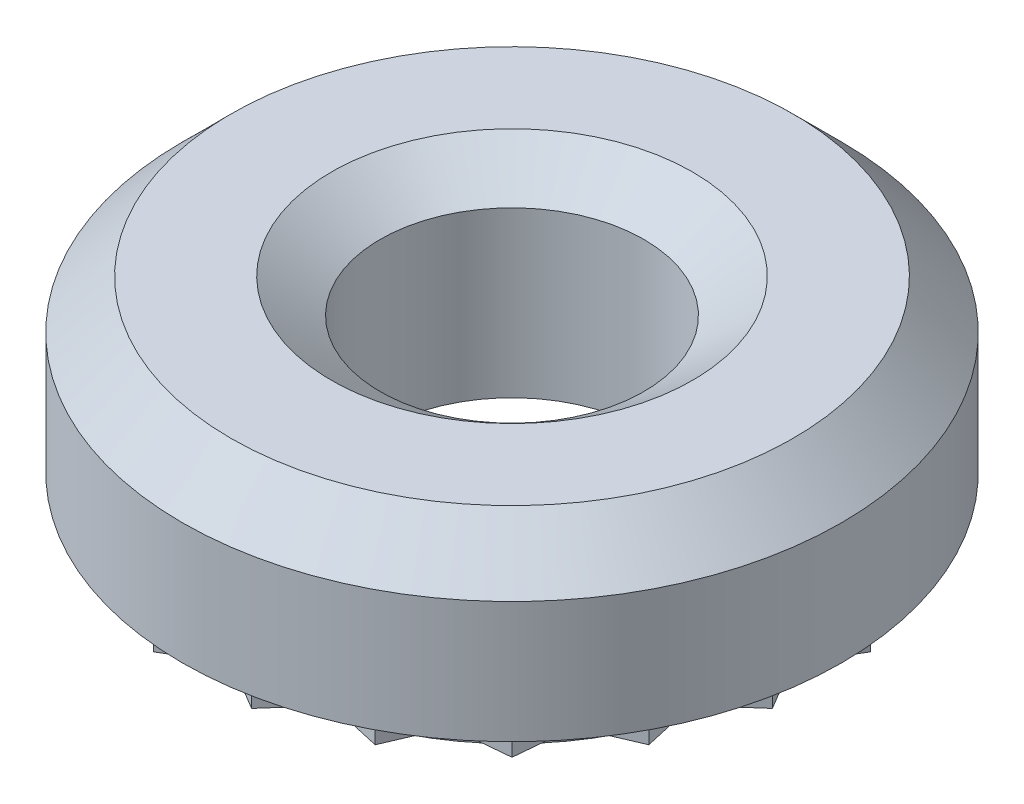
ISO-10303-21;
HEADER;
FILE_DESCRIPTION(('STEP AP214'),'2;1');
FILE_NAME('part.step','',(''),(''),'','','');
FILE_SCHEMA(('AUTOMOTIVE_DESIGN { 1 0 10303 214 1 1 1 1 }'));
ENDSEC;
DATA;
#1=APPLICATION_CONTEXT('core data for automotive mechanical design processes');
#2=APPLICATION_PROTOCOL_DEFINITION('international standard','automotive_design',2000,#1);
#3=PRODUCT_CONTEXT('',#1,'mechanical');
#4=PRODUCT('Part','Part','',(#3));
#5=PRODUCT_RELATED_PRODUCT_CATEGORY('part','',(#4));
#6=PRODUCT_DEFINITION_FORMATION('','',#4);
#7=PRODUCT_DEFINITION_CONTEXT('part definition',#1,'design');
#8=PRODUCT_DEFINITION('design','',#6,#7);
#9=PRODUCT_DEFINITION_SHAPE('','',#8);
#10=(LENGTH_UNIT() NAMED_UNIT(*) SI_UNIT(.MILLI.,.METRE.));
#11=(NAMED_UNIT(*) PLANE_ANGLE_UNIT() SI_UNIT($,.RADIAN.));
#12=(NAMED_UNIT(*) SI_UNIT($,.STERADIAN.) SOLID_ANGLE_UNIT());
#13=UNCERTAINTY_MEASURE_WITH_UNIT(LENGTH_MEASURE(1.E-05),#10,'distance_accuracy_value','');
#14=(GEOMETRIC_REPRESENTATION_CONTEXT(3) GLOBAL_UNCERTAINTY_ASSIGNED_CONTEXT((#13)) GLOBAL_UNIT_ASSIGNED_CONTEXT((#10,
#11,#12)) REPRESENTATION_CONTEXT('',''));
#15=CARTESIAN_POINT('',(0.,0.,0.));
#16=DIRECTION('',(0.,0.,1.));
#17=DIRECTION('',(1.,0.,0.));
#18=AXIS2_PLACEMENT_3D('',#15,#16,#17);
#19=CARTESIAN_POINT('',(2.2214189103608,0.,0.));
#20=DIRECTION('',(0.,-1.,0.));
#21=DIRECTION('',(0.,0.,-1.));
#22=AXIS2_PLACEMENT_3D('',#19,#20,#21);
#23=PLANE('',#22);
#24=CARTESIAN_POINT('',(0.,0.,0.));
#25=DIRECTION('',(0.,-1.,0.));
#26=DIRECTION('',(0.,0.,-1.));
#27=AXIS2_PLACEMENT_3D('',#24,#25,#26);
#28=CIRCLE('',#27,3.2004);
#29=CARTESIAN_POINT('',(0.,0.,-3.2004));
#30=VERTEX_POINT('',#29);
#31=EDGE_CURVE('E178',#30,#30,#28,.T.);
#32=ORIENTED_EDGE('',*,*,#31,.T.);
#33=EDGE_LOOP('',(#32));
#34=FACE_BOUND('',#33,.T.);
#35=DIRECTION('',(-0.859689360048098,0.,-0.5108171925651));
#36=VECTOR('',#35,1.);
#37=CARTESIAN_POINT('',(0.475620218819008,0.,3.00294787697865));
#38=LINE('',#37,#36);
#39=CARTESIAN_POINT('',(0.475620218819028,0.,3.00294787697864));
#40=VERTEX_POINT('',#39);
#41=CARTESIAN_POINT('',(0.,0.,2.72034));
#42=VERTEX_POINT('',#41);
#43=EDGE_CURVE('E70',#40,#42,#38,.T.);
#44=ORIENTED_EDGE('',*,*,#43,.F.);
#45=DIRECTION('',(-0.659761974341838,0.,0.751474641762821));
#46=VECTOR('',#45,1.);
#47=CARTESIAN_POINT('',(0.840631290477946,0.,2.58719708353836));
#48=LINE('',#47,#46);
#49=CARTESIAN_POINT('',(0.840631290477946,0.,2.58719708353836));
#50=VERTEX_POINT('',#49);
#51=EDGE_CURVE('E611',#50,#40,#48,.T.);
#52=ORIENTED_EDGE('',*,*,#51,.F.);
#53=DIRECTION('',(-0.975464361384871,0.,-0.220157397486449));
#54=VECTOR('',#53,1.);
#55=CARTESIAN_POINT('',(1.38030363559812,0.,2.70899841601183));
#56=LINE('',#55,#54);
#57=CARTESIAN_POINT('',(1.38030363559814,0.,2.70899841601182));
#58=VERTEX_POINT('',#57);
#59=EDGE_CURVE('E613',#58,#50,#56,.T.);
#60=ORIENTED_EDGE('',*,*,#59,.F.);
#61=DIRECTION('',(-0.395252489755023,0.,0.918572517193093));
#62=VECTOR('',#61,1.);
#63=CARTESIAN_POINT('',(1.59897573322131,0.,2.20080129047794));
#64=LINE('',#63,#62);
#65=CARTESIAN_POINT('',(1.59897573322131,0.,2.20080129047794));
#66=VERTEX_POINT('',#65);
#67=EDGE_CURVE('E638',#66,#58,#64,.T.);
#68=ORIENTED_EDGE('',*,*,#67,.F.);
#69=DIRECTION('',(-0.995754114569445,0.,0.0920529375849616));
#70=VECTOR('',#69,1.);
#71=CARTESIAN_POINT('',(2.14987331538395,0.,2.14987331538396));
#72=LINE('',#71,#70);
#73=CARTESIAN_POINT('',(2.14987331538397,0.,2.14987331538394));
#74=VERTEX_POINT('',#73);
#75=EDGE_CURVE('E641',#74,#66,#72,.T.);
#76=ORIENTED_EDGE('',*,*,#75,.F.);
#77=DIRECTION('',(-0.092052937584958,0.,0.995754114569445));
#78=VECTOR('',#77,1.);
#79=CARTESIAN_POINT('',(2.20080129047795,0.,1.5989757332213));
#80=LINE('',#79,#78);
#81=CARTESIAN_POINT('',(2.20080129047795,0.,1.5989757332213));
#82=VERTEX_POINT('',#81);
#83=EDGE_CURVE('E672',#82,#74,#80,.T.);
#84=ORIENTED_EDGE('',*,*,#83,.F.);
#85=DIRECTION('',(-0.918572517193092,0.,0.395252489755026));
#86=VECTOR('',#85,1.);
#87=CARTESIAN_POINT('',(2.70899841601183,0.,1.38030363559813));
#88=LINE('',#87,#86);
#89=CARTESIAN_POINT('',(2.70899841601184,0.,1.38030363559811));
#90=VERTEX_POINT('',#89);
#91=EDGE_CURVE('E675',#90,#82,#88,.T.);
#92=ORIENTED_EDGE('',*,*,#91,.F.);
#93=DIRECTION('',(0.220157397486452,0.,0.97546436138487));
#94=VECTOR('',#93,1.);
#95=CARTESIAN_POINT('',(2.58719708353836,0.,0.840631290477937));
#96=LINE('',#95,#94);
#97=CARTESIAN_POINT('',(2.58719708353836,0.,0.840631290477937));
#98=VERTEX_POINT('',#97);
#99=EDGE_CURVE('E708',#98,#90,#96,.T.);
#100=ORIENTED_EDGE('',*,*,#99,.F.);
#101=DIRECTION('',(-0.751474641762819,0.,0.659761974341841));
#102=VECTOR('',#101,1.);
#103=CARTESIAN_POINT('',(3.00294787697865,0.,0.475620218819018));
#104=LINE('',#103,#102);
#105=CARTESIAN_POINT('',(3.00294787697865,0.,0.475620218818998));
#106=VERTEX_POINT('',#105);
#107=EDGE_CURVE('E711',#106,#98,#104,.T.);
#108=ORIENTED_EDGE('',*,*,#107,.F.);
#109=DIRECTION('',(0.510817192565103,0.,0.859689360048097));
#110=VECTOR('',#109,1.);
#111=CARTESIAN_POINT('',(2.72034,0.,0.));
#112=LINE('',#111,#110);
#113=CARTESIAN_POINT('',(2.72034,0.,0.));
#114=VERTEX_POINT('',#113);
#115=EDGE_CURVE('E744',#114,#106,#112,.T.);
#116=ORIENTED_EDGE('',*,*,#115,.F.);
#117=DIRECTION('',(-0.510817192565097,0.,0.8596893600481));
#118=VECTOR('',#117,1.);
#119=CARTESIAN_POINT('',(3.00294787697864,0.,-0.475620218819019));
#120=LINE('',#119,#118);
#121=CARTESIAN_POINT('',(3.00294787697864,0.,-0.475620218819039));
#122=VERTEX_POINT('',#121);
#123=EDGE_CURVE('E747',#122,#114,#120,.T.);
#124=ORIENTED_EDGE('',*,*,#123,.F.);
#125=DIRECTION('',(0.751474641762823,0.,0.659761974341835));
#126=VECTOR('',#125,1.);
#127=CARTESIAN_POINT('',(2.58719708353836,0.,-0.840631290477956));
#128=LINE('',#127,#126);
#129=CARTESIAN_POINT('',(2.58719708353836,0.,-0.840631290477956));
#130=VERTEX_POINT('',#129);
#131=EDGE_CURVE('E780',#130,#122,#128,.T.);
#132=ORIENTED_EDGE('',*,*,#131,.F.);
#133=DIRECTION('',(-0.220157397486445,0.,0.975464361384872));
#134=VECTOR('',#133,1.);
#135=CARTESIAN_POINT('',(2.70899841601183,0.,-1.38030363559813));
#136=LINE('',#135,#134);
#137=CARTESIAN_POINT('',(2.70899841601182,0.,-1.38030363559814));
#138=VERTEX_POINT('',#137);
#139=EDGE_CURVE('E783',#138,#130,#136,.T.);
#140=ORIENTED_EDGE('',*,*,#139,.F.);
#141=DIRECTION('',(0.918572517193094,0.,0.39525248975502));
#142=VECTOR('',#141,1.);
#143=CARTESIAN_POINT('',(2.20080129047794,0.,-1.59897573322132));
#144=LINE('',#143,#142);
#145=CARTESIAN_POINT('',(2.20080129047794,0.,-1.59897573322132));
#146=VERTEX_POINT('',#145);
#147=EDGE_CURVE('E816',#146,#138,#144,.T.);
#148=ORIENTED_EDGE('',*,*,#147,.F.);
#149=DIRECTION('',(0.092052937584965,0.,0.995754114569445));
#150=VECTOR('',#149,1.);
#151=CARTESIAN_POINT('',(2.14987331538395,0.,-2.14987331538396));
#152=LINE('',#151,#150);
#153=CARTESIAN_POINT('',(2.14987331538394,0.,-2.14987331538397));
#154=VERTEX_POINT('',#153);
#155=EDGE_CURVE('E819',#154,#146,#152,.T.);
#156=ORIENTED_EDGE('',*,*,#155,.F.);
#157=DIRECTION('',(0.995754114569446,0.,0.0920529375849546));
#158=VECTOR('',#157,1.);
#159=CARTESIAN_POINT('',(1.59897573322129,0.,-2.20080129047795));
#160=LINE('',#159,#158);
#161=CARTESIAN_POINT('',(1.59897573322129,0.,-2.20080129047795));
#162=VERTEX_POINT('',#161);
#163=EDGE_CURVE('E852',#162,#154,#160,.T.);
#164=ORIENTED_EDGE('',*,*,#163,.F.);
#165=DIRECTION('',(0.39525248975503,0.,0.91857251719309));
#166=VECTOR('',#165,1.);
#167=CARTESIAN_POINT('',(1.38030363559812,0.,-2.70899841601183));
#168=LINE('',#167,#166);
#169=CARTESIAN_POINT('',(1.3803036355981,0.,-2.70899841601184));
#170=VERTEX_POINT('',#169);
#171=EDGE_CURVE('E855',#170,#162,#168,.T.);
#172=ORIENTED_EDGE('',*,*,#171,.F.);
#173=DIRECTION('',(0.975464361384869,0.,-0.220157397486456));
#174=VECTOR('',#173,1.);
#175=CARTESIAN_POINT('',(0.840631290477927,0.,-2.58719708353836));
#176=LINE('',#175,#174);
#177=CARTESIAN_POINT('',(0.840631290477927,0.,-2.58719708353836));
#178=VERTEX_POINT('',#177);
#179=EDGE_CURVE('E888',#178,#170,#176,.T.);
#180=ORIENTED_EDGE('',*,*,#179,.F.);
#181=DIRECTION('',(0.659761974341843,0.,0.751474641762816));
#182=VECTOR('',#181,1.);
#183=CARTESIAN_POINT('',(0.475620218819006,0.,-3.00294787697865));
#184=LINE('',#183,#182);
#185=CARTESIAN_POINT('',(0.475620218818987,0.,-3.00294787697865));
#186=VERTEX_POINT('',#185);
#187=EDGE_CURVE('E891',#186,#178,#184,.T.);
#188=ORIENTED_EDGE('',*,*,#187,.F.);
#189=DIRECTION('',(0.859689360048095,0.,-0.510817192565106));
#190=VECTOR('',#189,1.);
#191=CARTESIAN_POINT('',(0.,0.,-2.72034));
#192=LINE('',#191,#190);
#193=CARTESIAN_POINT('',(0.,0.,-2.72034));
#194=VERTEX_POINT('',#193);
#195=EDGE_CURVE('E924',#194,#186,#192,.T.);
#196=ORIENTED_EDGE('',*,*,#195,.F.);
#197=DIRECTION('',(0.859689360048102,0.,0.510817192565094));
#198=VECTOR('',#197,1.);
#199=CARTESIAN_POINT('',(-0.475620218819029,0.,-3.00294787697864));
#200=LINE('',#199,#198);
#201=CARTESIAN_POINT('',(-0.475620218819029,0.,-3.00294787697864));
#202=VERTEX_POINT('',#201);
#203=EDGE_CURVE('E927',#202,#194,#200,.T.);
#204=ORIENTED_EDGE('',*,*,#203,.F.);
#205=DIRECTION('',(0.659761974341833,0.,-0.751474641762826));
#206=VECTOR('',#205,1.);
#207=CARTESIAN_POINT('',(-0.840631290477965,0.,-2.58719708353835));
#208=LINE('',#207,#206);
#209=CARTESIAN_POINT('',(-0.840631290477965,0.,-2.58719708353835));
#210=VERTEX_POINT('',#209);
#211=EDGE_CURVE('E960',#210,#202,#208,.T.);
#212=ORIENTED_EDGE('',*,*,#211,.F.);
#213=DIRECTION('',(0.975464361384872,0.,0.220157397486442));
#214=VECTOR('',#213,1.);
#215=CARTESIAN_POINT('',(-1.38030363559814,0.,-2.70899841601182));
#216=LINE('',#215,#214);
#217=CARTESIAN_POINT('',(-1.38030363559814,0.,-2.70899841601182));
#218=VERTEX_POINT('',#217);
#219=EDGE_CURVE('E963',#218,#210,#216,.T.);
#220=ORIENTED_EDGE('',*,*,#219,.F.);
#221=DIRECTION('',(0.395252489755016,0.,-0.918572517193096));
#222=VECTOR('',#221,1.);
#223=CARTESIAN_POINT('',(-1.59897573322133,0.,-2.20080129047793));
#224=LINE('',#223,#222);
#225=CARTESIAN_POINT('',(-1.59897573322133,0.,-2.20080129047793));
#226=VERTEX_POINT('',#225);
#227=EDGE_CURVE('E996',#226,#218,#224,.T.);
#228=ORIENTED_EDGE('',*,*,#227,.F.);
#229=DIRECTION('',(0.995754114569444,0.,-0.0920529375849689));
#230=VECTOR('',#229,1.);
#231=CARTESIAN_POINT('',(-2.14987331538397,0.,-2.14987331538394));
#232=LINE('',#231,#230);
#233=CARTESIAN_POINT('',(-2.14987331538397,0.,-2.14987331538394));
#234=VERTEX_POINT('',#233);
#235=EDGE_CURVE('E999',#234,#226,#232,.T.);
#236=ORIENTED_EDGE('',*,*,#235,.F.);
#237=DIRECTION('',(0.0920529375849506,0.,-0.995754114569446));
#238=VECTOR('',#237,1.);
#239=CARTESIAN_POINT('',(-2.20080129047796,0.,-1.59897573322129));
#240=LINE('',#239,#238);
#241=CARTESIAN_POINT('',(-2.20080129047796,0.,-1.59897573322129));
#242=VERTEX_POINT('',#241);
#243=EDGE_CURVE('E1032',#242,#234,#240,.T.);
#244=ORIENTED_EDGE('',*,*,#243,.F.);
#245=DIRECTION('',(0.918572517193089,0.,-0.395252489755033));
#246=VECTOR('',#245,1.);
#247=CARTESIAN_POINT('',(-2.70899841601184,0.,-1.38030363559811));
#248=LINE('',#247,#246);
#249=CARTESIAN_POINT('',(-2.70899841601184,0.,-1.38030363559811));
#250=VERTEX_POINT('',#249);
#251=EDGE_CURVE('E1035',#250,#242,#248,.T.);
#252=ORIENTED_EDGE('',*,*,#251,.F.);
#253=DIRECTION('',(-0.220157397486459,0.,-0.975464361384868));
#254=VECTOR('',#253,1.);
#255=CARTESIAN_POINT('',(-2.58719708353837,0.,-0.84063129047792));
#256=LINE('',#255,#254);
#257=CARTESIAN_POINT('',(-2.58719708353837,0.,-0.84063129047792));
#258=VERTEX_POINT('',#257);
#259=EDGE_CURVE('E1068',#258,#250,#256,.T.);
#260=ORIENTED_EDGE('',*,*,#259,.F.);
#261=DIRECTION('',(0.751474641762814,0.,-0.659761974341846));
#262=VECTOR('',#261,1.);
#263=CARTESIAN_POINT('',(-3.00294787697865,0.,-0.475620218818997));
#264=LINE('',#263,#262);
#265=CARTESIAN_POINT('',(-3.00294787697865,0.,-0.475620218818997));
#266=VERTEX_POINT('',#265);
#267=EDGE_CURVE('E1071',#266,#258,#264,.T.);
#268=ORIENTED_EDGE('',*,*,#267,.F.);
#269=DIRECTION('',(-0.510817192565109,0.,-0.859689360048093));
#270=VECTOR('',#269,1.);
#271=CARTESIAN_POINT('',(-2.72034,0.,0.));
#272=LINE('',#271,#270);
#273=CARTESIAN_POINT('',(-2.72034,0.,0.));
#274=VERTEX_POINT('',#273);
#275=EDGE_CURVE('E1104',#274,#266,#272,.T.);
#276=ORIENTED_EDGE('',*,*,#275,.F.);
#277=DIRECTION('',(0.510817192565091,0.,-0.859689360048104));
#278=VECTOR('',#277,1.);
#279=CARTESIAN_POINT('',(-3.00294787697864,0.,0.47562021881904));
#280=LINE('',#279,#278);
#281=CARTESIAN_POINT('',(-3.00294787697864,0.,0.47562021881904));
#282=VERTEX_POINT('',#281);
#283=EDGE_CURVE('E1107',#282,#274,#280,.T.);
#284=ORIENTED_EDGE('',*,*,#283,.F.);
#285=DIRECTION('',(-0.751474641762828,0.,-0.65976197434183));
#286=VECTOR('',#285,1.);
#287=CARTESIAN_POINT('',(-2.58719708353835,0.,0.840631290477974));
#288=LINE('',#287,#286);
#289=CARTESIAN_POINT('',(-2.58719708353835,0.,0.840631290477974));
#290=VERTEX_POINT('',#289);
#291=EDGE_CURVE('E1140',#290,#282,#288,.T.);
#292=ORIENTED_EDGE('',*,*,#291,.F.);
#293=DIRECTION('',(0.220157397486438,0.,-0.975464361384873));
#294=VECTOR('',#293,1.);
#295=CARTESIAN_POINT('',(-2.70899841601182,0.,1.38030363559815));
#296=LINE('',#295,#294);
#297=CARTESIAN_POINT('',(-2.70899841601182,0.,1.38030363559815));
#298=VERTEX_POINT('',#297);
#299=EDGE_CURVE('E1143',#298,#290,#296,.T.);
#300=ORIENTED_EDGE('',*,*,#299,.F.);
#301=DIRECTION('',(-0.918572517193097,0.,-0.395252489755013));
#302=VECTOR('',#301,1.);
#303=CARTESIAN_POINT('',(-2.20080129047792,0.,1.59897573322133));
#304=LINE('',#303,#302);
#305=CARTESIAN_POINT('',(-2.20080129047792,0.,1.59897573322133));
#306=VERTEX_POINT('',#305);
#307=EDGE_CURVE('E1176',#306,#298,#304,.T.);
#308=ORIENTED_EDGE('',*,*,#307,.F.);
#309=DIRECTION('',(-0.0920529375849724,0.,-0.995754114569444));
#310=VECTOR('',#309,1.);
#311=CARTESIAN_POINT('',(-2.14987331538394,0.,2.14987331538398));
#312=LINE('',#311,#310);
#313=CARTESIAN_POINT('',(-2.14987331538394,0.,2.14987331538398));
#314=VERTEX_POINT('',#313);
#315=EDGE_CURVE('E1179',#314,#306,#312,.T.);
#316=ORIENTED_EDGE('',*,*,#315,.F.);
#317=DIRECTION('',(-0.995754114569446,0.,-0.0920529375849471));
#318=VECTOR('',#317,1.);
#319=CARTESIAN_POINT('',(-1.59897573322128,0.,2.20080129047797));
#320=LINE('',#319,#318);
#321=CARTESIAN_POINT('',(-1.59897573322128,0.,2.20080129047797));
#322=VERTEX_POINT('',#321);
#323=EDGE_CURVE('E1212',#322,#314,#320,.T.);
#324=ORIENTED_EDGE('',*,*,#323,.F.);
#325=DIRECTION('',(-0.395252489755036,0.,-0.918572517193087));
#326=VECTOR('',#325,1.);
#327=CARTESIAN_POINT('',(-1.3803036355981,0.,2.70899841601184));
#328=LINE('',#327,#326);
#329=CARTESIAN_POINT('',(-1.3803036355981,0.,2.70899841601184));
#330=VERTEX_POINT('',#329);
#331=EDGE_CURVE('E1215',#330,#322,#328,.T.);
#332=ORIENTED_EDGE('',*,*,#331,.F.);
#333=DIRECTION('',(-0.975464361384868,0.,0.220157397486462));
#334=VECTOR('',#333,1.);
#335=CARTESIAN_POINT('',(-0.840631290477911,0.,2.58719708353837));
#336=LINE('',#335,#334);
#337=CARTESIAN_POINT('',(-0.840631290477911,0.,2.58719708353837));
#338=VERTEX_POINT('',#337);
#339=EDGE_CURVE('E1235',#338,#330,#336,.T.);
#340=ORIENTED_EDGE('',*,*,#339,.F.);
#341=DIRECTION('',(-0.659761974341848,0.,-0.751474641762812));
#342=VECTOR('',#341,1.);
#343=CARTESIAN_POINT('',(-0.475620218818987,0.,3.00294787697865));
#344=LINE('',#343,#342);
#345=CARTESIAN_POINT('',(-0.475620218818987,0.,3.00294787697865));
#346=VERTEX_POINT('',#345);
#347=EDGE_CURVE('E1238',#346,#338,#344,.T.);
#348=ORIENTED_EDGE('',*,*,#347,.F.);
#349=DIRECTION('',(-0.859689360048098,0.,0.5108171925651));
#350=VECTOR('',#349,1.);
#351=CARTESIAN_POINT('',(0.,0.,2.72034));
#352=LINE('',#351,#350);
#353=EDGE_CURVE('E589',#42,#346,#352,.T.);
#354=ORIENTED_EDGE('',*,*,#353,.F.);
#355=EDGE_LOOP('',(#44,#52,#60,#68,#76,#84,#92,#100,#108,#116,#124,#132,#140,#148,#156,#164,
#172,#180,#188,#196,#204,#212,#220,#228,#236,#244,#252,#260,#268,#276,#284,#292,#300,#308,#316,
#324,#332,#340,#348,#354));
#356=FACE_BOUND('',#355,.T.);
#357=ADVANCED_FACE('F33',(#34,#356),#23,.T.);
#358=CARTESIAN_POINT('',(0.,0.,0.));
#359=DIRECTION('',(0.,-1.,0.));
#360=DIRECTION('',(0.,0.,-1.));
#361=AXIS2_PLACEMENT_3D('',#358,#359,#360);
#362=CIRCLE('',#361,2.2214189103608);
#363=CARTESIAN_POINT('',(0.,0.,-2.2214189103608));
#364=VERTEX_POINT('',#363);
#365=EDGE_CURVE('E175',#364,#364,#362,.T.);
#366=ORIENTED_EDGE('',*,*,#365,.F.);
#367=EDGE_LOOP('',(#366));
#368=FACE_BOUND('',#367,.T.);
#369=DIRECTION('',(0.975464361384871,0.,0.220157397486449));
#370=VECTOR('',#369,1.);
#371=CARTESIAN_POINT('',(0.807006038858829,0.,2.48370920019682));
#372=LINE('',#371,#370);
#373=CARTESIAN_POINT('',(0.807006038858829,0.,2.48370920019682));
#374=VERTEX_POINT('',#373);
#375=CARTESIAN_POINT('',(1.32509149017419,0.,2.60063847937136));
#376=VERTEX_POINT('',#375);
#377=EDGE_CURVE('E104',#374,#376,#372,.T.);
#378=ORIENTED_EDGE('',*,*,#377,.F.);
#379=DIRECTION('',(0.659761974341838,0.,-0.751474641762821));
#380=VECTOR('',#379,1.);
#381=CARTESIAN_POINT('',(0.456595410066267,0.,2.8828299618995));
#382=LINE('',#381,#380);
#383=CARTESIAN_POINT('',(0.456595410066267,0.,2.8828299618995));
#384=VERTEX_POINT('',#383);
#385=EDGE_CURVE('E609',#384,#374,#382,.T.);
#386=ORIENTED_EDGE('',*,*,#385,.F.);
#387=DIRECTION('',(0.859689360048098,0.,0.510817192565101));
#388=VECTOR('',#387,1.);
#389=CARTESIAN_POINT('',(0.,0.,2.6115264));
#390=LINE('',#389,#388);
#391=CARTESIAN_POINT('',(0.,0.,2.6115264));
#392=VERTEX_POINT('',#391);
#393=EDGE_CURVE('E138',#392,#384,#390,.T.);
#394=ORIENTED_EDGE('',*,*,#393,.F.);
#395=DIRECTION('',(0.859689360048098,0.,-0.510817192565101));
#396=VECTOR('',#395,1.);
#397=CARTESIAN_POINT('',(-0.456595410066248,0.,2.8828299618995));
#398=LINE('',#397,#396);
#399=CARTESIAN_POINT('',(-0.456595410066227,0.,2.8828299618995));
#400=VERTEX_POINT('',#399);
#401=EDGE_CURVE('E588',#400,#392,#398,.T.);
#402=ORIENTED_EDGE('',*,*,#401,.F.);
#403=DIRECTION('',(0.659761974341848,0.,0.751474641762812));
#404=VECTOR('',#403,1.);
#405=CARTESIAN_POINT('',(-0.807006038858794,0.,2.48370920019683));
#406=LINE('',#405,#404);
#407=CARTESIAN_POINT('',(-0.807006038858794,0.,2.48370920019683));
#408=VERTEX_POINT('',#407);
#409=EDGE_CURVE('E575',#408,#400,#406,.T.);
#410=ORIENTED_EDGE('',*,*,#409,.F.);
#411=DIRECTION('',(0.975464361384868,0.,-0.220157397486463));
#412=VECTOR('',#411,1.);
#413=CARTESIAN_POINT('',(-1.32509149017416,0.,2.60063847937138));
#414=LINE('',#413,#412);
#415=CARTESIAN_POINT('',(-1.32509149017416,0.,2.60063847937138));
#416=VERTEX_POINT('',#415);
#417=EDGE_CURVE('E586',#416,#408,#414,.T.);
#418=ORIENTED_EDGE('',*,*,#417,.F.);
#419=DIRECTION('',(0.395252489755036,0.,0.918572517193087));
#420=VECTOR('',#419,1.);
#421=CARTESIAN_POINT('',(-1.53501670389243,0.,2.11276923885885));
#422=LINE('',#421,#420);
#423=CARTESIAN_POINT('',(-1.53501670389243,0.,2.11276923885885));
#424=VERTEX_POINT('',#423);
#425=EDGE_CURVE('E1205',#424,#416,#422,.T.);
#426=ORIENTED_EDGE('',*,*,#425,.F.);
#427=DIRECTION('',(0.995754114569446,0.,0.0920529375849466));
#428=VECTOR('',#427,1.);
#429=CARTESIAN_POINT('',(-2.06387838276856,0.,2.06387838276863));
#430=LINE('',#429,#428);
#431=CARTESIAN_POINT('',(-2.06387838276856,0.,2.06387838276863));
#432=VERTEX_POINT('',#431);
#433=EDGE_CURVE('E1209',#432,#424,#430,.T.);
#434=ORIENTED_EDGE('',*,*,#433,.F.);
#435=DIRECTION('',(0.0920529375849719,0.,0.995754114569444));
#436=VECTOR('',#435,1.);
#437=CARTESIAN_POINT('',(-2.11276923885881,0.,1.53501670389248));
#438=LINE('',#437,#436);
#439=CARTESIAN_POINT('',(-2.11276923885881,0.,1.53501670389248));
#440=VERTEX_POINT('',#439);
#441=EDGE_CURVE('E1169',#440,#432,#438,.T.);
#442=ORIENTED_EDGE('',*,*,#441,.F.);
#443=DIRECTION('',(0.918572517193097,0.,0.395252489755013));
#444=VECTOR('',#443,1.);
#445=CARTESIAN_POINT('',(-2.60063847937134,0.,1.32509149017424));
#446=LINE('',#445,#444);
#447=CARTESIAN_POINT('',(-2.60063847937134,0.,1.32509149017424));
#448=VERTEX_POINT('',#447);
#449=EDGE_CURVE('E1173',#448,#440,#446,.T.);
#450=ORIENTED_EDGE('',*,*,#449,.F.);
#451=DIRECTION('',(-0.220157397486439,0.,0.975464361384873));
#452=VECTOR('',#451,1.);
#453=CARTESIAN_POINT('',(-2.48370920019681,0.,0.807006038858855));
#454=LINE('',#453,#452);
#455=CARTESIAN_POINT('',(-2.48370920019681,0.,0.807006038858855));
#456=VERTEX_POINT('',#455);
#457=EDGE_CURVE('E1133',#456,#448,#454,.T.);
#458=ORIENTED_EDGE('',*,*,#457,.F.);
#459=DIRECTION('',(0.751474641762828,0.,0.65976197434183));
#460=VECTOR('',#459,1.);
#461=CARTESIAN_POINT('',(-2.88282996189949,0.,0.456595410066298));
#462=LINE('',#461,#460);
#463=CARTESIAN_POINT('',(-2.88282996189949,0.,0.456595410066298));
#464=VERTEX_POINT('',#463);
#465=EDGE_CURVE('E1137',#464,#456,#462,.T.);
#466=ORIENTED_EDGE('',*,*,#465,.F.);
#467=DIRECTION('',(-0.510817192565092,0.,0.859689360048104));
#468=VECTOR('',#467,1.);
#469=CARTESIAN_POINT('',(-2.6115264,0.,0.));
#470=LINE('',#469,#468);
#471=CARTESIAN_POINT('',(-2.6115264,0.,0.));
#472=VERTEX_POINT('',#471);
#473=EDGE_CURVE('E1097',#472,#464,#470,.T.);
#474=ORIENTED_EDGE('',*,*,#473,.F.);
#475=DIRECTION('',(0.51081719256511,0.,0.859689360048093));
#476=VECTOR('',#475,1.);
#477=CARTESIAN_POINT('',(-2.88282996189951,0.,-0.456595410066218));
#478=LINE('',#477,#476);
#479=CARTESIAN_POINT('',(-2.88282996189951,0.,-0.456595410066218));
#480=VERTEX_POINT('',#479);
#481=EDGE_CURVE('E1101',#480,#472,#478,.T.);
#482=ORIENTED_EDGE('',*,*,#481,.F.);
#483=DIRECTION('',(-0.751474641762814,0.,0.659761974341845));
#484=VECTOR('',#483,1.);
#485=CARTESIAN_POINT('',(-2.48370920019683,0.,-0.807006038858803));
#486=LINE('',#485,#484);
#487=CARTESIAN_POINT('',(-2.48370920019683,0.,-0.807006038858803));
#488=VERTEX_POINT('',#487);
#489=EDGE_CURVE('E1061',#488,#480,#486,.T.);
#490=ORIENTED_EDGE('',*,*,#489,.F.);
#491=DIRECTION('',(0.220157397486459,0.,0.975464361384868));
#492=VECTOR('',#491,1.);
#493=CARTESIAN_POINT('',(-2.60063847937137,0.,-1.32509149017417));
#494=LINE('',#493,#492);
#495=CARTESIAN_POINT('',(-2.60063847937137,0.,-1.32509149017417));
#496=VERTEX_POINT('',#495);
#497=EDGE_CURVE('E1065',#496,#488,#494,.T.);
#498=ORIENTED_EDGE('',*,*,#497,.F.);
#499=DIRECTION('',(-0.918572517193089,0.,0.395252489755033));
#500=VECTOR('',#499,1.);
#501=CARTESIAN_POINT('',(-2.11276923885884,0.,-1.53501670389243));
#502=LINE('',#501,#500);
#503=CARTESIAN_POINT('',(-2.11276923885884,0.,-1.53501670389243));
#504=VERTEX_POINT('',#503);
#505=EDGE_CURVE('E1025',#504,#496,#502,.T.);
#506=ORIENTED_EDGE('',*,*,#505,.F.);
#507=DIRECTION('',(-0.0920529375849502,0.,0.995754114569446));
#508=VECTOR('',#507,1.);
#509=CARTESIAN_POINT('',(-2.06387838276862,0.,-2.06387838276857));
#510=LINE('',#509,#508);
#511=CARTESIAN_POINT('',(-2.06387838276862,0.,-2.06387838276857));
#512=VERTEX_POINT('',#511);
#513=EDGE_CURVE('E1029',#512,#504,#510,.T.);
#514=ORIENTED_EDGE('',*,*,#513,.F.);
#515=DIRECTION('',(-0.995754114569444,0.,0.0920529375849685));
#516=VECTOR('',#515,1.);
#517=CARTESIAN_POINT('',(-1.53501670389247,0.,-2.11276923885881));
#518=LINE('',#517,#516);
#519=CARTESIAN_POINT('',(-1.53501670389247,0.,-2.11276923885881));
#520=VERTEX_POINT('',#519);
#521=EDGE_CURVE('E989',#520,#512,#518,.T.);
#522=ORIENTED_EDGE('',*,*,#521,.F.);
#523=DIRECTION('',(-0.395252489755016,0.,0.918572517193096));
#524=VECTOR('',#523,1.);
#525=CARTESIAN_POINT('',(-1.32509149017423,0.,-2.60063847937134));
#526=LINE('',#525,#524);
#527=CARTESIAN_POINT('',(-1.32509149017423,0.,-2.60063847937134));
#528=VERTEX_POINT('',#527);
#529=EDGE_CURVE('E993',#528,#520,#526,.T.);
#530=ORIENTED_EDGE('',*,*,#529,.F.);
#531=DIRECTION('',(-0.975464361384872,0.,-0.220157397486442));
#532=VECTOR('',#531,1.);
#533=CARTESIAN_POINT('',(-0.807006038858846,0.,-2.48370920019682));
#534=LINE('',#533,#532);
#535=CARTESIAN_POINT('',(-0.807006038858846,0.,-2.48370920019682));
#536=VERTEX_POINT('',#535);
#537=EDGE_CURVE('E953',#536,#528,#534,.T.);
#538=ORIENTED_EDGE('',*,*,#537,.F.);
#539=DIRECTION('',(-0.659761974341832,0.,0.751474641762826));
#540=VECTOR('',#539,1.);
#541=CARTESIAN_POINT('',(-0.456595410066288,0.,-2.88282996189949));
#542=LINE('',#541,#540);
#543=CARTESIAN_POINT('',(-0.456595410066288,0.,-2.88282996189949));
#544=VERTEX_POINT('',#543);
#545=EDGE_CURVE('E957',#544,#536,#542,.T.);
#546=ORIENTED_EDGE('',*,*,#545,.F.);
#547=DIRECTION('',(-0.859689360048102,0.,-0.510817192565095));
#548=VECTOR('',#547,1.);
#549=CARTESIAN_POINT('',(0.,0.,-2.6115264));
#550=LINE('',#549,#548);
#551=CARTESIAN_POINT('',(0.,0.,-2.6115264));
#552=VERTEX_POINT('',#551);
#553=EDGE_CURVE('E917',#552,#544,#550,.T.);
#554=ORIENTED_EDGE('',*,*,#553,.F.);
#555=DIRECTION('',(-0.859689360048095,0.,0.510817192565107));
#556=VECTOR('',#555,1.);
#557=CARTESIAN_POINT('',(0.456595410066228,0.,-2.8828299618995));
#558=LINE('',#557,#556);
#559=CARTESIAN_POINT('',(0.456595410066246,0.,-2.8828299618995));
#560=VERTEX_POINT('',#559);
#561=EDGE_CURVE('E921',#560,#552,#558,.T.);
#562=ORIENTED_EDGE('',*,*,#561,.F.);
#563=DIRECTION('',(-0.659761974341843,0.,-0.751474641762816));
#564=VECTOR('',#563,1.);
#565=CARTESIAN_POINT('',(0.80700603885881,0.,-2.48370920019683));
#566=LINE('',#565,#564);
#567=CARTESIAN_POINT('',(0.80700603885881,0.,-2.48370920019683));
#568=VERTEX_POINT('',#567);
#569=EDGE_CURVE('E881',#568,#560,#566,.T.);
#570=ORIENTED_EDGE('',*,*,#569,.F.);
#571=DIRECTION('',(-0.975464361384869,0.,0.220157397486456));
#572=VECTOR('',#571,1.);
#573=CARTESIAN_POINT('',(1.32509149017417,0.,-2.60063847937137));
#574=LINE('',#573,#572);
#575=CARTESIAN_POINT('',(1.32509149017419,0.,-2.60063847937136));
#576=VERTEX_POINT('',#575);
#577=EDGE_CURVE('E885',#576,#568,#574,.T.);
#578=ORIENTED_EDGE('',*,*,#577,.F.);
#579=DIRECTION('',(-0.395252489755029,0.,-0.918572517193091));
#580=VECTOR('',#579,1.);
#581=CARTESIAN_POINT('',(1.53501670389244,0.,-2.11276923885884));
#582=LINE('',#581,#580);
#583=CARTESIAN_POINT('',(1.53501670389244,0.,-2.11276923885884));
#584=VERTEX_POINT('',#583);
#585=EDGE_CURVE('E845',#584,#576,#582,.T.);
#586=ORIENTED_EDGE('',*,*,#585,.F.);
#587=DIRECTION('',(-0.995754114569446,0.,-0.0920529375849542));
#588=VECTOR('',#587,1.);
#589=CARTESIAN_POINT('',(2.06387838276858,0.,-2.06387838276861));
#590=LINE('',#589,#588);
#591=CARTESIAN_POINT('',(2.06387838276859,0.,-2.0638783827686));
#592=VERTEX_POINT('',#591);
#593=EDGE_CURVE('E849',#592,#584,#590,.T.);
#594=ORIENTED_EDGE('',*,*,#593,.F.);
#595=DIRECTION('',(-0.0920529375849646,0.,-0.995754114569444));
#596=VECTOR('',#595,1.);
#597=CARTESIAN_POINT('',(2.11276923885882,0.,-1.53501670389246));
#598=LINE('',#597,#596);
#599=CARTESIAN_POINT('',(2.11276923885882,0.,-1.53501670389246));
#600=VERTEX_POINT('',#599);
#601=EDGE_CURVE('E809',#600,#592,#598,.T.);
#602=ORIENTED_EDGE('',*,*,#601,.F.);
#603=DIRECTION('',(-0.918572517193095,0.,-0.39525248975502));
#604=VECTOR('',#603,1.);
#605=CARTESIAN_POINT('',(2.60063847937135,0.,-1.32509149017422));
#606=LINE('',#605,#604);
#607=CARTESIAN_POINT('',(2.60063847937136,0.,-1.3250914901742));
#608=VERTEX_POINT('',#607);
#609=EDGE_CURVE('E813',#608,#600,#606,.T.);
#610=ORIENTED_EDGE('',*,*,#609,.F.);
#611=DIRECTION('',(0.220157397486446,0.,-0.975464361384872));
#612=VECTOR('',#611,1.);
#613=CARTESIAN_POINT('',(2.48370920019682,0.,-0.807006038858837));
#614=LINE('',#613,#612);
#615=CARTESIAN_POINT('',(2.48370920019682,0.,-0.807006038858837));
#616=VERTEX_POINT('',#615);
#617=EDGE_CURVE('E773',#616,#608,#614,.T.);
#618=ORIENTED_EDGE('',*,*,#617,.F.);
#619=DIRECTION('',(-0.751474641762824,0.,-0.659761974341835));
#620=VECTOR('',#619,1.);
#621=CARTESIAN_POINT('',(2.8828299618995,0.,-0.456595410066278));
#622=LINE('',#621,#620);
#623=CARTESIAN_POINT('',(2.8828299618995,0.,-0.456595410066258));
#624=VERTEX_POINT('',#623);
#625=EDGE_CURVE('E777',#624,#616,#622,.T.);
#626=ORIENTED_EDGE('',*,*,#625,.F.);
#627=DIRECTION('',(0.510817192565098,0.,-0.8596893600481));
#628=VECTOR('',#627,1.);
#629=CARTESIAN_POINT('',(2.6115264,0.,0.));
#630=LINE('',#629,#628);
#631=CARTESIAN_POINT('',(2.6115264,0.,0.));
#632=VERTEX_POINT('',#631);
#633=EDGE_CURVE('E737',#632,#624,#630,.T.);
#634=ORIENTED_EDGE('',*,*,#633,.F.);
#635=DIRECTION('',(-0.510817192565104,0.,-0.859689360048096));
#636=VECTOR('',#635,1.);
#637=CARTESIAN_POINT('',(2.8828299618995,0.,0.456595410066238));
#638=LINE('',#637,#636);
#639=CARTESIAN_POINT('',(2.8828299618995,0.,0.456595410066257));
#640=VERTEX_POINT('',#639);
#641=EDGE_CURVE('E741',#640,#632,#638,.T.);
#642=ORIENTED_EDGE('',*,*,#641,.F.);
#643=DIRECTION('',(0.751474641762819,0.,-0.65976197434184));
#644=VECTOR('',#643,1.);
#645=CARTESIAN_POINT('',(2.48370920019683,0.,0.80700603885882));
#646=LINE('',#645,#644);
#647=CARTESIAN_POINT('',(2.48370920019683,0.,0.80700603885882));
#648=VERTEX_POINT('',#647);
#649=EDGE_CURVE('E701',#648,#640,#646,.T.);
#650=ORIENTED_EDGE('',*,*,#649,.F.);
#651=DIRECTION('',(-0.220157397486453,0.,-0.97546436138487));
#652=VECTOR('',#651,1.);
#653=CARTESIAN_POINT('',(2.60063847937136,0.,1.32509149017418));
#654=LINE('',#653,#652);
#655=CARTESIAN_POINT('',(2.60063847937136,0.,1.3250914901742));
#656=VERTEX_POINT('',#655);
#657=EDGE_CURVE('E705',#656,#648,#654,.T.);
#658=ORIENTED_EDGE('',*,*,#657,.F.);
#659=DIRECTION('',(0.918572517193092,0.,-0.395252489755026));
#660=VECTOR('',#659,1.);
#661=CARTESIAN_POINT('',(2.11276923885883,0.,1.53501670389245));
#662=LINE('',#661,#660);
#663=CARTESIAN_POINT('',(2.11276923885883,0.,1.53501670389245));
#664=VERTEX_POINT('',#663);
#665=EDGE_CURVE('E665',#664,#656,#662,.T.);
#666=ORIENTED_EDGE('',*,*,#665,.F.);
#667=DIRECTION('',(0.0920529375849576,0.,-0.995754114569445));
#668=VECTOR('',#667,1.);
#669=CARTESIAN_POINT('',(2.06387838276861,0.,2.06387838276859));
#670=LINE('',#669,#668);
#671=CARTESIAN_POINT('',(2.06387838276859,0.,2.0638783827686));
#672=VERTEX_POINT('',#671);
#673=EDGE_CURVE('E669',#672,#664,#670,.T.);
#674=ORIENTED_EDGE('',*,*,#673,.F.);
#675=DIRECTION('',(0.995754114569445,0.,-0.0920529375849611));
#676=VECTOR('',#675,1.);
#677=CARTESIAN_POINT('',(1.53501670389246,0.,2.11276923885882));
#678=LINE('',#677,#676);
#679=CARTESIAN_POINT('',(1.53501670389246,0.,2.11276923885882));
#680=VERTEX_POINT('',#679);
#681=EDGE_CURVE('E631',#680,#672,#678,.T.);
#682=ORIENTED_EDGE('',*,*,#681,.F.);
#683=DIRECTION('',(0.395252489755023,0.,-0.918572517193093));
#684=VECTOR('',#683,1.);
#685=CARTESIAN_POINT('',(1.32509149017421,0.,2.60063847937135));
#686=LINE('',#685,#684);
#687=EDGE_CURVE('E635',#376,#680,#686,.T.);
#688=ORIENTED_EDGE('',*,*,#687,.F.);
#689=EDGE_LOOP('',(#378,#386,#394,#402,#410,#418,#426,#434,#442,#450,#458,#466,#474,#482,#490,
#498,#506,#514,#522,#530,#538,#546,#554,#562,#570,#578,#586,#594,#602,#610,#618,#626,#634,#642,
#650,#658,#666,#674,#682,#688));
#690=FACE_BOUND('',#689,.T.);
#691=ADVANCED_FACE('F203',(#368,#690),#23,.T.);
#692=CARTESIAN_POINT('',(0.,0.,0.));
#693=DIRECTION('',(0.,-1.,0.));
#694=DIRECTION('',(0.,0.,-1.));
#695=AXIS2_PLACEMENT_3D('',#692,#693,#694);
#696=CYLINDRICAL_SURFACE('',#695,3.2004);
#697=CARTESIAN_POINT('',(0.,1.17856,0.));
#698=DIRECTION('',(0.,1.,0.));
#699=DIRECTION('',(0.,0.,1.));
#700=AXIS2_PLACEMENT_3D('',#697,#698,#699);
#701=CIRCLE('',#700,3.2004);
#702=CARTESIAN_POINT('',(0.,1.17856,3.2004));
#703=VERTEX_POINT('',#702);
#704=EDGE_CURVE('E42',#703,#703,#701,.F.);
#705=ORIENTED_EDGE('',*,*,#704,.T.);
#706=EDGE_LOOP('',(#705));
#707=FACE_BOUND('',#706,.T.);
#708=ORIENTED_EDGE('',*,*,#31,.F.);
#709=EDGE_LOOP('',(#708));
#710=FACE_BOUND('',#709,.T.);
#711=ADVANCED_FACE('F184',(#707,#710),#696,.T.);
#712=CARTESIAN_POINT('',(0.,0.,0.));
#713=DIRECTION('',(0.,-1.,0.));
#714=DIRECTION('',(0.,0.,-1.));
#715=AXIS2_PLACEMENT_3D('',#712,#713,#714);
#716=CYLINDRICAL_SURFACE('',#715,2.2214189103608);
#717=ORIENTED_EDGE('',*,*,#365,.T.);
#718=EDGE_LOOP('',(#717));
#719=FACE_BOUND('',#718,.T.);
#720=CARTESIAN_POINT('',(0.,-0.24384,0.));
#721=DIRECTION('',(0.,-1.,0.));
#722=DIRECTION('',(0.,0.,-1.));
#723=AXIS2_PLACEMENT_3D('',#720,#721,#722);
#724=CIRCLE('',#723,2.2214189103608);
#725=CARTESIAN_POINT('',(0.,-0.24384,-2.2214189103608));
#726=VERTEX_POINT('',#725);
#727=EDGE_CURVE('E172',#726,#726,#724,.T.);
#728=ORIENTED_EDGE('',*,*,#727,.F.);
#729=EDGE_LOOP('',(#728));
#730=FACE_BOUND('',#729,.T.);
#731=ADVANCED_FACE('F212',(#719,#730),#716,.T.);
#732=CARTESIAN_POINT('',(0.,-0.48768,0.));
#733=DIRECTION('',(0.,-1.,0.));
#734=DIRECTION('',(0.,0.,-1.));
#735=AXIS2_PLACEMENT_3D('',#732,#733,#734);
#736=CONICAL_SURFACE('',#735,2.3622,0.523598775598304);
#737=ORIENTED_EDGE('',*,*,#727,.T.);
#738=EDGE_LOOP('',(#737));
#739=FACE_BOUND('',#738,.T.);
#740=CARTESIAN_POINT('',(0.,-0.48768,0.));
#741=DIRECTION('',(0.,-1.,0.));
#742=DIRECTION('',(0.,0.,-1.));
#743=AXIS2_PLACEMENT_3D('',#740,#741,#742);
#744=CIRCLE('',#743,2.3622);
#745=CARTESIAN_POINT('',(0.,-0.48768,-2.3622));
#746=VERTEX_POINT('',#745);
#747=EDGE_CURVE('E169',#746,#746,#744,.T.);
#748=ORIENTED_EDGE('',*,*,#747,.F.);
#749=EDGE_LOOP('',(#748));
#750=FACE_BOUND('',#749,.T.);
#751=ADVANCED_FACE('F218',(#739,#750),#736,.T.);
#752=CARTESIAN_POINT('',(0.,0.,0.));
#753=DIRECTION('',(0.,-1.,0.));
#754=DIRECTION('',(0.,0.,-1.));
#755=AXIS2_PLACEMENT_3D('',#752,#753,#754);
#756=CYLINDRICAL_SURFACE('',#755,2.3622);
#757=ORIENTED_EDGE('',*,*,#747,.T.);
#758=EDGE_LOOP('',(#757));
#759=FACE_BOUND('',#758,.T.);
#760=CARTESIAN_POINT('',(0.,-0.6096,0.));
#761=DIRECTION('',(0.,-1.,0.));
#762=DIRECTION('',(0.,0.,-1.));
#763=AXIS2_PLACEMENT_3D('',#760,#761,#762);
#764=CIRCLE('',#763,2.3622);
#765=CARTESIAN_POINT('',(0.,-0.6096,-2.3622));
#766=VERTEX_POINT('',#765);
#767=EDGE_CURVE('E166',#766,#766,#764,.T.);
#768=ORIENTED_EDGE('',*,*,#767,.F.);
#769=EDGE_LOOP('',(#768));
#770=FACE_BOUND('',#769,.T.);
#771=ADVANCED_FACE('F223',(#759,#770),#756,.T.);
#772=CARTESIAN_POINT('',(1.28016,-0.6096,0.));
#773=DIRECTION('',(0.,-1.,0.));
#774=DIRECTION('',(0.,0.,-1.));
#775=AXIS2_PLACEMENT_3D('',#772,#773,#774);
#776=PLANE('',#775);
#777=CARTESIAN_POINT('',(0.,-0.6096,0.));
#778=DIRECTION('',(0.,-1.,0.));
#779=DIRECTION('',(0.,0.,-1.));
#780=AXIS2_PLACEMENT_3D('',#777,#778,#779);
#781=CIRCLE('',#780,1.7526);
#782=CARTESIAN_POINT('',(0.,-0.6096,-1.7526));
#783=VERTEX_POINT('',#782);
#784=EDGE_CURVE('E37',#783,#783,#781,.T.);
#785=ORIENTED_EDGE('',*,*,#784,.F.);
#786=EDGE_LOOP('',(#785));
#787=FACE_BOUND('',#786,.T.);
#788=ORIENTED_EDGE('',*,*,#767,.T.);
#789=EDGE_LOOP('',(#788));
#790=FACE_BOUND('',#789,.T.);
#791=ADVANCED_FACE('F233',(#787,#790),#776,.T.);
#792=CARTESIAN_POINT('',(0.,0.,0.));
#793=DIRECTION('',(0.,-1.,0.));
#794=DIRECTION('',(0.,0.,-1.));
#795=AXIS2_PLACEMENT_3D('',#792,#793,#794);
#796=CYLINDRICAL_SURFACE('',#795,1.28016);
#797=CARTESIAN_POINT('',(0.,1.32031681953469,0.));
#798=DIRECTION('',(0.,-1.,0.));
#799=DIRECTION('',(0.,0.,-1.));
#800=AXIS2_PLACEMENT_3D('',#797,#798,#799);
#801=CIRCLE('',#800,1.28016);
#802=CARTESIAN_POINT('',(0.,1.32031681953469,-1.28016));
#803=VERTEX_POINT('',#802);
#804=EDGE_CURVE('E154',#803,#803,#801,.T.);
#805=ORIENTED_EDGE('',*,*,#804,.F.);
#806=EDGE_LOOP('',(#805));
#807=FACE_BOUND('',#806,.T.);
#808=CARTESIAN_POINT('',(0.,-0.276376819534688,0.));
#809=DIRECTION('',(0.,-1.,0.));
#810=DIRECTION('',(0.,0.,-1.));
#811=AXIS2_PLACEMENT_3D('',#808,#809,#810);
#812=CIRCLE('',#811,1.28016);
#813=CARTESIAN_POINT('',(0.,-0.276376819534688,-1.28016));
#814=VERTEX_POINT('',#813);
#815=EDGE_CURVE('E163',#814,#814,#812,.T.);
#816=ORIENTED_EDGE('',*,*,#815,.T.);
#817=EDGE_LOOP('',(#816));
#818=FACE_BOUND('',#817,.T.);
#819=ADVANCED_FACE('F198',(#807,#818),#796,.F.);
#820=CARTESIAN_POINT('',(3.2004,1.651,0.));
#821=DIRECTION('',(0.,1.,0.));
#822=DIRECTION('',(0.,0.,1.));
#823=AXIS2_PLACEMENT_3D('',#820,#821,#822);
#824=PLANE('',#823);
#825=CARTESIAN_POINT('',(0.,1.651,0.));
#826=DIRECTION('',(0.,-1.,0.));
#827=DIRECTION('',(0.,0.,-1.));
#828=AXIS2_PLACEMENT_3D('',#825,#826,#827);
#829=CIRCLE('',#828,1.7526);
#830=CARTESIAN_POINT('',(0.,1.651,-1.7526));
#831=VERTEX_POINT('',#830);
#832=EDGE_CURVE('E157',#831,#831,#829,.T.);
#833=ORIENTED_EDGE('',*,*,#832,.T.);
#834=EDGE_LOOP('',(#833));
#835=FACE_BOUND('',#834,.T.);
#836=CARTESIAN_POINT('',(0.,1.651,0.));
#837=DIRECTION('',(0.,1.,0.));
#838=DIRECTION('',(0.,0.,1.));
#839=AXIS2_PLACEMENT_3D('',#836,#837,#838);
#840=CIRCLE('',#839,2.72796);
#841=CARTESIAN_POINT('',(0.,1.651,2.72796));
#842=VERTEX_POINT('',#841);
#843=EDGE_CURVE('E11',#842,#842,#840,.T.);
#844=ORIENTED_EDGE('',*,*,#843,.T.);
#845=EDGE_LOOP('',(#844));
#846=FACE_BOUND('',#845,.T.);
#847=ADVANCED_FACE('F189',(#835,#846),#824,.T.);
#848=CARTESIAN_POINT('',(0.,1.17856,0.));
#849=DIRECTION('',(0.,-1.,0.));
#850=DIRECTION('',(0.,0.,-1.));
#851=AXIS2_PLACEMENT_3D('',#848,#849,#850);
#852=CONICAL_SURFACE('',#851,3.2004,0.785398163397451);
#853=ORIENTED_EDGE('',*,*,#843,.F.);
#854=EDGE_LOOP('',(#853));
#855=FACE_BOUND('',#854,.T.);
#856=ORIENTED_EDGE('',*,*,#704,.F.);
#857=EDGE_LOOP('',(#856));
#858=FACE_BOUND('',#857,.T.);
#859=ADVANCED_FACE('F35',(#855,#858),#852,.T.);
#860=CARTESIAN_POINT('',(0.,-0.60706,0.));
#861=DIRECTION('',(0.,-1.,0.));
#862=DIRECTION('',(0.,0.,-1.));
#863=AXIS2_PLACEMENT_3D('',#860,#861,#862);
#864=CONICAL_SURFACE('',#863,1.7526,0.960105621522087);
#865=ORIENTED_EDGE('',*,*,#815,.F.);
#866=EDGE_LOOP('',(#865));
#867=FACE_BOUND('',#866,.T.);
#868=CARTESIAN_POINT('',(0.,-0.60706,0.));
#869=DIRECTION('',(0.,-1.,0.));
#870=DIRECTION('',(0.,0.,-1.));
#871=AXIS2_PLACEMENT_3D('',#868,#869,#870);
#872=CIRCLE('',#871,1.7526);
#873=CARTESIAN_POINT('',(0.,-0.60706,-1.7526));
#874=VERTEX_POINT('',#873);
#875=EDGE_CURVE('E160',#874,#874,#872,.T.);
#876=ORIENTED_EDGE('',*,*,#875,.T.);
#877=EDGE_LOOP('',(#876));
#878=FACE_BOUND('',#877,.T.);
#879=ADVANCED_FACE('F188',(#867,#878),#864,.F.);
#880=CARTESIAN_POINT('',(0.,-2.54,0.));
#881=DIRECTION('',(0.,-1.,0.));
#882=DIRECTION('',(0.,0.,-1.));
#883=AXIS2_PLACEMENT_3D('',#880,#881,#882);
#884=CYLINDRICAL_SURFACE('',#883,1.7526);
#885=ORIENTED_EDGE('',*,*,#784,.T.);
#886=EDGE_LOOP('',(#885));
#887=FACE_BOUND('',#886,.T.);
#888=ORIENTED_EDGE('',*,*,#875,.F.);
#889=EDGE_LOOP('',(#888));
#890=FACE_BOUND('',#889,.T.);
#891=ADVANCED_FACE('F195',(#887,#890),#884,.F.);
#892=CARTESIAN_POINT('',(0.,1.32031681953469,0.));
#893=DIRECTION('',(0.,1.,0.));
#894=DIRECTION('',(0.,0.,1.));
#895=AXIS2_PLACEMENT_3D('',#892,#893,#894);
#896=CONICAL_SURFACE('',#895,1.28016,0.960105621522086);
#897=ORIENTED_EDGE('',*,*,#832,.F.);
#898=EDGE_LOOP('',(#897));
#899=FACE_BOUND('',#898,.T.);
#900=ORIENTED_EDGE('',*,*,#804,.T.);
#901=EDGE_LOOP('',(#900));
#902=FACE_BOUND('',#901,.T.);
#903=ADVANCED_FACE('F249',(#899,#902),#896,.F.);
#904=CARTESIAN_POINT('',(0.475620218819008,-0.24384,3.00294787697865));
#905=DIRECTION('',(0.5108171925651,0.,-0.859689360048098));
#906=DIRECTION('',(-0.859689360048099,0.,-0.5108171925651));
#907=AXIS2_PLACEMENT_3D('',#904,#905,#906);
#908=PLANE('',#907);
#909=ORIENTED_EDGE('',*,*,#43,.T.);
#910=DIRECTION('',(0.,1.,0.));
#911=VECTOR('',#910,1.);
#912=CARTESIAN_POINT('',(0.,-0.24384,2.72034));
#913=LINE('',#912,#911);
#914=CARTESIAN_POINT('',(0.,-0.24384,2.72034));
#915=VERTEX_POINT('',#914);
#916=EDGE_CURVE('E150',#915,#42,#913,.T.);
#917=ORIENTED_EDGE('',*,*,#916,.F.);
#918=DIRECTION('',(-0.859689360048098,0.,-0.5108171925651));
#919=VECTOR('',#918,1.);
#920=CARTESIAN_POINT('',(0.475620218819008,-0.24384,3.00294787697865));
#921=LINE('',#920,#919);
#922=CARTESIAN_POINT('',(0.475620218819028,-0.24384,3.00294787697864));
#923=VERTEX_POINT('',#922);
#924=EDGE_CURVE('E590',#923,#915,#921,.T.);
#925=ORIENTED_EDGE('',*,*,#924,.F.);
#926=DIRECTION('',(0.,1.,0.));
#927=VECTOR('',#926,1.);
#928=CARTESIAN_POINT('',(0.475620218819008,-0.24384,3.00294787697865));
#929=LINE('',#928,#927);
#930=EDGE_CURVE('E152',#923,#40,#929,.T.);
#931=ORIENTED_EDGE('',*,*,#930,.T.);
#932=EDGE_LOOP('',(#909,#917,#925,#931));
#933=FACE_BOUND('',#932,.T.);
#934=ADVANCED_FACE('F253',(#933),#908,.F.);
#935=CARTESIAN_POINT('',(0.,-0.24384,2.72034));
#936=DIRECTION('',(-0.5108171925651,0.,-0.859689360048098));
#937=DIRECTION('',(-0.859689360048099,0.,0.5108171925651));
#938=AXIS2_PLACEMENT_3D('',#935,#936,#937);
#939=PLANE('',#938);
#940=ORIENTED_EDGE('',*,*,#353,.T.);
#941=DIRECTION('',(0.,1.,0.));
#942=VECTOR('',#941,1.);
#943=CARTESIAN_POINT('',(-0.475620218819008,-0.24384,3.00294787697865));
#944=LINE('',#943,#942);
#945=CARTESIAN_POINT('',(-0.475620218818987,-0.24384,3.00294787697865));
#946=VERTEX_POINT('',#945);
#947=EDGE_CURVE('E147',#946,#346,#944,.T.);
#948=ORIENTED_EDGE('',*,*,#947,.F.);
#949=DIRECTION('',(-0.859689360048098,0.,0.5108171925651));
#950=VECTOR('',#949,1.);
#951=CARTESIAN_POINT('',(0.,-0.24384,2.72034));
#952=LINE('',#951,#950);
#953=EDGE_CURVE('E597',#915,#946,#952,.T.);
#954=ORIENTED_EDGE('',*,*,#953,.F.);
#955=ORIENTED_EDGE('',*,*,#916,.T.);
#956=EDGE_LOOP('',(#940,#948,#954,#955));
#957=FACE_BOUND('',#956,.T.);
#958=ADVANCED_FACE('F257',(#957),#939,.F.);
#959=CARTESIAN_POINT('',(-0.456595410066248,-0.24384,2.8828299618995));
#960=DIRECTION('',(0.510817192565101,0.,0.859689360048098));
#961=DIRECTION('',(0.859689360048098,0.,-0.510817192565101));
#962=AXIS2_PLACEMENT_3D('',#959,#960,#961);
#963=PLANE('',#962);
#964=ORIENTED_EDGE('',*,*,#401,.T.);
#965=DIRECTION('',(0.,1.,0.));
#966=VECTOR('',#965,1.);
#967=CARTESIAN_POINT('',(0.,-0.24384,2.6115264));
#968=LINE('',#967,#966);
#969=CARTESIAN_POINT('',(0.,-0.24384,2.6115264));
#970=VERTEX_POINT('',#969);
#971=EDGE_CURVE('E49',#970,#392,#968,.T.);
#972=ORIENTED_EDGE('',*,*,#971,.F.);
#973=DIRECTION('',(0.859689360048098,0.,-0.510817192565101));
#974=VECTOR('',#973,1.);
#975=CARTESIAN_POINT('',(-0.456595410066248,-0.24384,2.8828299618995));
#976=LINE('',#975,#974);
#977=CARTESIAN_POINT('',(-0.456595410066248,-0.24384,2.8828299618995));
#978=VERTEX_POINT('',#977);
#979=EDGE_CURVE('E58',#978,#970,#976,.T.);
#980=ORIENTED_EDGE('',*,*,#979,.F.);
#981=DIRECTION('',(0.,1.,0.));
#982=VECTOR('',#981,1.);
#983=CARTESIAN_POINT('',(-0.456595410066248,-0.24384,2.8828299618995));
#984=LINE('',#983,#982);
#985=EDGE_CURVE('E140',#978,#400,#984,.T.);
#986=ORIENTED_EDGE('',*,*,#985,.T.);
#987=EDGE_LOOP('',(#964,#972,#980,#986));
#988=FACE_BOUND('',#987,.T.);
#989=ADVANCED_FACE('F260',(#988),#963,.F.);
#990=CARTESIAN_POINT('',(0.,-0.24384,2.6115264));
#991=DIRECTION('',(-0.510817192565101,0.,0.859689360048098));
#992=DIRECTION('',(0.859689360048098,0.,0.510817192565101));
#993=AXIS2_PLACEMENT_3D('',#990,#991,#992);
#994=PLANE('',#993);
#995=ORIENTED_EDGE('',*,*,#393,.T.);
#996=DIRECTION('',(0.,1.,0.));
#997=VECTOR('',#996,1.);
#998=CARTESIAN_POINT('',(0.456595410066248,-0.24384,2.8828299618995));
#999=LINE('',#998,#997);
#1000=CARTESIAN_POINT('',(0.456595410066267,-0.24384,2.8828299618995));
#1001=VERTEX_POINT('',#1000);
#1002=EDGE_CURVE('E128',#1001,#384,#999,.T.);
#1003=ORIENTED_EDGE('',*,*,#1002,.F.);
#1004=DIRECTION('',(0.859689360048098,0.,0.510817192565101));
#1005=VECTOR('',#1004,1.);
#1006=CARTESIAN_POINT('',(0.,-0.24384,2.6115264));
#1007=LINE('',#1006,#1005);
#1008=EDGE_CURVE('E133',#970,#1001,#1007,.T.);
#1009=ORIENTED_EDGE('',*,*,#1008,.F.);
#1010=ORIENTED_EDGE('',*,*,#971,.T.);
#1011=EDGE_LOOP('',(#995,#1003,#1009,#1010));
#1012=FACE_BOUND('',#1011,.T.);
#1013=ADVANCED_FACE('F136',(#1012),#994,.F.);
#1014=CARTESIAN_POINT('',(0.393799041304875,-0.24384,2.48634929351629));
#1015=DIRECTION('',(0.,-1.,0.));
#1016=DIRECTION('',(0.,0.,-1.));
#1017=AXIS2_PLACEMENT_3D('',#1014,#1015,#1016);
#1018=PLANE('',#1017);
#1019=DIRECTION('',(-0.659761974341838,0.,0.751474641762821));
#1020=VECTOR('',#1019,1.);
#1021=CARTESIAN_POINT('',(0.840631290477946,-0.24384,2.58719708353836));
#1022=LINE('',#1021,#1020);
#1023=CARTESIAN_POINT('',(0.840631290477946,-0.24384,2.58719708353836));
#1024=VERTEX_POINT('',#1023);
#1025=EDGE_CURVE('E131',#1024,#923,#1022,.T.);
#1026=ORIENTED_EDGE('',*,*,#1025,.T.);
#1027=ORIENTED_EDGE('',*,*,#924,.T.);
#1028=ORIENTED_EDGE('',*,*,#953,.T.);
#1029=DIRECTION('',(-0.659761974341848,0.,-0.751474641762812));
#1030=VECTOR('',#1029,1.);
#1031=CARTESIAN_POINT('',(-0.475620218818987,-0.24384,3.00294787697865));
#1032=LINE('',#1031,#1030);
#1033=CARTESIAN_POINT('',(-0.840631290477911,-0.24384,2.58719708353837));
#1034=VERTEX_POINT('',#1033);
#1035=EDGE_CURVE('E585',#946,#1034,#1032,.T.);
#1036=ORIENTED_EDGE('',*,*,#1035,.T.);
#1037=DIRECTION('',(-0.975464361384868,0.,0.220157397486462));
#1038=VECTOR('',#1037,1.);
#1039=CARTESIAN_POINT('',(-0.840631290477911,-0.24384,2.58719708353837));
#1040=LINE('',#1039,#1038);
#1041=CARTESIAN_POINT('',(-1.3803036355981,-0.24384,2.70899841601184));
#1042=VERTEX_POINT('',#1041);
#1043=EDGE_CURVE('E1245',#1034,#1042,#1040,.T.);
#1044=ORIENTED_EDGE('',*,*,#1043,.T.);
#1045=DIRECTION('',(-0.395252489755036,0.,-0.918572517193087));
#1046=VECTOR('',#1045,1.);
#1047=CARTESIAN_POINT('',(-1.3803036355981,-0.24384,2.70899841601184));
#1048=LINE('',#1047,#1046);
#1049=CARTESIAN_POINT('',(-1.59897573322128,-0.24384,2.20080129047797));
#1050=VERTEX_POINT('',#1049);
#1051=EDGE_CURVE('E1208',#1042,#1050,#1048,.T.);
#1052=ORIENTED_EDGE('',*,*,#1051,.T.);
#1053=DIRECTION('',(-0.995754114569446,0.,-0.0920529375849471));
#1054=VECTOR('',#1053,1.);
#1055=CARTESIAN_POINT('',(-1.59897573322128,-0.24384,2.20080129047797));
#1056=LINE('',#1055,#1054);
#1057=CARTESIAN_POINT('',(-2.14987331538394,-0.24384,2.14987331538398));
#1058=VERTEX_POINT('',#1057);
#1059=EDGE_CURVE('E1224',#1050,#1058,#1056,.T.);
#1060=ORIENTED_EDGE('',*,*,#1059,.T.);
#1061=DIRECTION('',(-0.0920529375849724,0.,-0.995754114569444));
#1062=VECTOR('',#1061,1.);
#1063=CARTESIAN_POINT('',(-2.14987331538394,-0.24384,2.14987331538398));
#1064=LINE('',#1063,#1062);
#1065=CARTESIAN_POINT('',(-2.20080129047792,-0.24384,1.59897573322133));
#1066=VERTEX_POINT('',#1065);
#1067=EDGE_CURVE('E1172',#1058,#1066,#1064,.T.);
#1068=ORIENTED_EDGE('',*,*,#1067,.T.);
#1069=DIRECTION('',(-0.918572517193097,0.,-0.395252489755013));
#1070=VECTOR('',#1069,1.);
#1071=CARTESIAN_POINT('',(-2.20080129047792,-0.24384,1.59897573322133));
#1072=LINE('',#1071,#1070);
#1073=CARTESIAN_POINT('',(-2.70899841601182,-0.24384,1.38030363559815));
#1074=VERTEX_POINT('',#1073);
#1075=EDGE_CURVE('E1188',#1066,#1074,#1072,.T.);
#1076=ORIENTED_EDGE('',*,*,#1075,.T.);
#1077=DIRECTION('',(0.220157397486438,0.,-0.975464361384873));
#1078=VECTOR('',#1077,1.);
#1079=CARTESIAN_POINT('',(-2.70899841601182,-0.24384,1.38030363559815));
#1080=LINE('',#1079,#1078);
#1081=CARTESIAN_POINT('',(-2.58719708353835,-0.24384,0.840631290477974));
#1082=VERTEX_POINT('',#1081);
#1083=EDGE_CURVE('E1136',#1074,#1082,#1080,.T.);
#1084=ORIENTED_EDGE('',*,*,#1083,.T.);
#1085=DIRECTION('',(-0.751474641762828,0.,-0.65976197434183));
#1086=VECTOR('',#1085,1.);
#1087=CARTESIAN_POINT('',(-2.58719708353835,-0.24384,0.840631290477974));
#1088=LINE('',#1087,#1086);
#1089=CARTESIAN_POINT('',(-3.00294787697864,-0.24384,0.47562021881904));
#1090=VERTEX_POINT('',#1089);
#1091=EDGE_CURVE('E1152',#1082,#1090,#1088,.T.);
#1092=ORIENTED_EDGE('',*,*,#1091,.T.);
#1093=DIRECTION('',(0.510817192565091,0.,-0.859689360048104));
#1094=VECTOR('',#1093,1.);
#1095=CARTESIAN_POINT('',(-3.00294787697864,-0.24384,0.47562021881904));
#1096=LINE('',#1095,#1094);
#1097=CARTESIAN_POINT('',(-2.72034,-0.24384,0.));
#1098=VERTEX_POINT('',#1097);
#1099=EDGE_CURVE('E1100',#1090,#1098,#1096,.T.);
#1100=ORIENTED_EDGE('',*,*,#1099,.T.);
#1101=DIRECTION('',(-0.510817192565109,0.,-0.859689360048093));
#1102=VECTOR('',#1101,1.);
#1103=CARTESIAN_POINT('',(-2.72034,-0.24384,0.));
#1104=LINE('',#1103,#1102);
#1105=CARTESIAN_POINT('',(-3.00294787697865,-0.24384,-0.475620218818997));
#1106=VERTEX_POINT('',#1105);
#1107=EDGE_CURVE('E1116',#1098,#1106,#1104,.T.);
#1108=ORIENTED_EDGE('',*,*,#1107,.T.);
#1109=DIRECTION('',(0.751474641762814,0.,-0.659761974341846));
#1110=VECTOR('',#1109,1.);
#1111=CARTESIAN_POINT('',(-3.00294787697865,-0.24384,-0.475620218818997));
#1112=LINE('',#1111,#1110);
#1113=CARTESIAN_POINT('',(-2.58719708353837,-0.24384,-0.84063129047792));
#1114=VERTEX_POINT('',#1113);
#1115=EDGE_CURVE('E1064',#1106,#1114,#1112,.T.);
#1116=ORIENTED_EDGE('',*,*,#1115,.T.);
#1117=DIRECTION('',(-0.220157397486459,0.,-0.975464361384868));
#1118=VECTOR('',#1117,1.);
#1119=CARTESIAN_POINT('',(-2.58719708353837,-0.24384,-0.84063129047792));
#1120=LINE('',#1119,#1118);
#1121=CARTESIAN_POINT('',(-2.70899841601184,-0.24384,-1.38030363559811));
#1122=VERTEX_POINT('',#1121);
#1123=EDGE_CURVE('E1080',#1114,#1122,#1120,.T.);
#1124=ORIENTED_EDGE('',*,*,#1123,.T.);
#1125=DIRECTION('',(0.918572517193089,0.,-0.395252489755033));
#1126=VECTOR('',#1125,1.);
#1127=CARTESIAN_POINT('',(-2.70899841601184,-0.24384,-1.38030363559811));
#1128=LINE('',#1127,#1126);
#1129=CARTESIAN_POINT('',(-2.20080129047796,-0.24384,-1.59897573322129));
#1130=VERTEX_POINT('',#1129);
#1131=EDGE_CURVE('E1028',#1122,#1130,#1128,.T.);
#1132=ORIENTED_EDGE('',*,*,#1131,.T.);
#1133=DIRECTION('',(0.0920529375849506,0.,-0.995754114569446));
#1134=VECTOR('',#1133,1.);
#1135=CARTESIAN_POINT('',(-2.20080129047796,-0.24384,-1.59897573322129));
#1136=LINE('',#1135,#1134);
#1137=CARTESIAN_POINT('',(-2.14987331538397,-0.24384,-2.14987331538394));
#1138=VERTEX_POINT('',#1137);
#1139=EDGE_CURVE('E1044',#1130,#1138,#1136,.T.);
#1140=ORIENTED_EDGE('',*,*,#1139,.T.);
#1141=DIRECTION('',(0.995754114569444,0.,-0.0920529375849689));
#1142=VECTOR('',#1141,1.);
#1143=CARTESIAN_POINT('',(-2.14987331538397,-0.24384,-2.14987331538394));
#1144=LINE('',#1143,#1142);
#1145=CARTESIAN_POINT('',(-1.59897573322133,-0.24384,-2.20080129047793));
#1146=VERTEX_POINT('',#1145);
#1147=EDGE_CURVE('E992',#1138,#1146,#1144,.T.);
#1148=ORIENTED_EDGE('',*,*,#1147,.T.);
#1149=DIRECTION('',(0.395252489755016,0.,-0.918572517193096));
#1150=VECTOR('',#1149,1.);
#1151=CARTESIAN_POINT('',(-1.59897573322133,-0.24384,-2.20080129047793));
#1152=LINE('',#1151,#1150);
#1153=CARTESIAN_POINT('',(-1.38030363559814,-0.24384,-2.70899841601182));
#1154=VERTEX_POINT('',#1153);
#1155=EDGE_CURVE('E1008',#1146,#1154,#1152,.T.);
#1156=ORIENTED_EDGE('',*,*,#1155,.T.);
#1157=DIRECTION('',(0.975464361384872,0.,0.220157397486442));
#1158=VECTOR('',#1157,1.);
#1159=CARTESIAN_POINT('',(-1.38030363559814,-0.24384,-2.70899841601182));
#1160=LINE('',#1159,#1158);
#1161=CARTESIAN_POINT('',(-0.840631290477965,-0.24384,-2.58719708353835));
#1162=VERTEX_POINT('',#1161);
#1163=EDGE_CURVE('E956',#1154,#1162,#1160,.T.);
#1164=ORIENTED_EDGE('',*,*,#1163,.T.);
#1165=DIRECTION('',(0.659761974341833,0.,-0.751474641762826));
#1166=VECTOR('',#1165,1.);
#1167=CARTESIAN_POINT('',(-0.840631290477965,-0.24384,-2.58719708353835));
#1168=LINE('',#1167,#1166);
#1169=CARTESIAN_POINT('',(-0.475620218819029,-0.24384,-3.00294787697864));
#1170=VERTEX_POINT('',#1169);
#1171=EDGE_CURVE('E972',#1162,#1170,#1168,.T.);
#1172=ORIENTED_EDGE('',*,*,#1171,.T.);
#1173=DIRECTION('',(0.859689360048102,0.,0.510817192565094));
#1174=VECTOR('',#1173,1.);
#1175=CARTESIAN_POINT('',(-0.475620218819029,-0.24384,-3.00294787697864));
#1176=LINE('',#1175,#1174);
#1177=CARTESIAN_POINT('',(0.,-0.24384,-2.72034));
#1178=VERTEX_POINT('',#1177);
#1179=EDGE_CURVE('E920',#1170,#1178,#1176,.T.);
#1180=ORIENTED_EDGE('',*,*,#1179,.T.);
#1181=DIRECTION('',(0.859689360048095,0.,-0.510817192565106));
#1182=VECTOR('',#1181,1.);
#1183=CARTESIAN_POINT('',(0.,-0.24384,-2.72034));
#1184=LINE('',#1183,#1182);
#1185=CARTESIAN_POINT('',(0.475620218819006,-0.24384,-3.00294787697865));
#1186=VERTEX_POINT('',#1185);
#1187=EDGE_CURVE('E936',#1178,#1186,#1184,.T.);
#1188=ORIENTED_EDGE('',*,*,#1187,.T.);
#1189=DIRECTION('',(0.659761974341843,0.,0.751474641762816));
#1190=VECTOR('',#1189,1.);
#1191=CARTESIAN_POINT('',(0.475620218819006,-0.24384,-3.00294787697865));
#1192=LINE('',#1191,#1190);
#1193=CARTESIAN_POINT('',(0.840631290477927,-0.24384,-2.58719708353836));
#1194=VERTEX_POINT('',#1193);
#1195=EDGE_CURVE('E884',#1186,#1194,#1192,.T.);
#1196=ORIENTED_EDGE('',*,*,#1195,.T.);
#1197=DIRECTION('',(0.975464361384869,0.,-0.220157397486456));
#1198=VECTOR('',#1197,1.);
#1199=CARTESIAN_POINT('',(0.840631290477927,-0.24384,-2.58719708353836));
#1200=LINE('',#1199,#1198);
#1201=CARTESIAN_POINT('',(1.38030363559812,-0.24384,-2.70899841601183));
#1202=VERTEX_POINT('',#1201);
#1203=EDGE_CURVE('E900',#1194,#1202,#1200,.T.);
#1204=ORIENTED_EDGE('',*,*,#1203,.T.);
#1205=DIRECTION('',(0.39525248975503,0.,0.91857251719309));
#1206=VECTOR('',#1205,1.);
#1207=CARTESIAN_POINT('',(1.38030363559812,-0.24384,-2.70899841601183));
#1208=LINE('',#1207,#1206);
#1209=CARTESIAN_POINT('',(1.59897573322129,-0.24384,-2.20080129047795));
#1210=VERTEX_POINT('',#1209);
#1211=EDGE_CURVE('E848',#1202,#1210,#1208,.T.);
#1212=ORIENTED_EDGE('',*,*,#1211,.T.);
#1213=DIRECTION('',(0.995754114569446,0.,0.0920529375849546));
#1214=VECTOR('',#1213,1.);
#1215=CARTESIAN_POINT('',(1.59897573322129,-0.24384,-2.20080129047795));
#1216=LINE('',#1215,#1214);
#1217=CARTESIAN_POINT('',(2.14987331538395,-0.24384,-2.14987331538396));
#1218=VERTEX_POINT('',#1217);
#1219=EDGE_CURVE('E864',#1210,#1218,#1216,.T.);
#1220=ORIENTED_EDGE('',*,*,#1219,.T.);
#1221=DIRECTION('',(0.092052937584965,0.,0.995754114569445));
#1222=VECTOR('',#1221,1.);
#1223=CARTESIAN_POINT('',(2.14987331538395,-0.24384,-2.14987331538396));
#1224=LINE('',#1223,#1222);
#1225=CARTESIAN_POINT('',(2.20080129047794,-0.24384,-1.59897573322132));
#1226=VERTEX_POINT('',#1225);
#1227=EDGE_CURVE('E812',#1218,#1226,#1224,.T.);
#1228=ORIENTED_EDGE('',*,*,#1227,.T.);
#1229=DIRECTION('',(0.918572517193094,0.,0.39525248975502));
#1230=VECTOR('',#1229,1.);
#1231=CARTESIAN_POINT('',(2.20080129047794,-0.24384,-1.59897573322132));
#1232=LINE('',#1231,#1230);
#1233=CARTESIAN_POINT('',(2.70899841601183,-0.24384,-1.38030363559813));
#1234=VERTEX_POINT('',#1233);
#1235=EDGE_CURVE('E828',#1226,#1234,#1232,.T.);
#1236=ORIENTED_EDGE('',*,*,#1235,.T.);
#1237=DIRECTION('',(-0.220157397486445,0.,0.975464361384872));
#1238=VECTOR('',#1237,1.);
#1239=CARTESIAN_POINT('',(2.70899841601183,-0.24384,-1.38030363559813));
#1240=LINE('',#1239,#1238);
#1241=CARTESIAN_POINT('',(2.58719708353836,-0.24384,-0.840631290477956));
#1242=VERTEX_POINT('',#1241);
#1243=EDGE_CURVE('E776',#1234,#1242,#1240,.T.);
#1244=ORIENTED_EDGE('',*,*,#1243,.T.);
#1245=DIRECTION('',(0.751474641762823,0.,0.659761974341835));
#1246=VECTOR('',#1245,1.);
#1247=CARTESIAN_POINT('',(2.58719708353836,-0.24384,-0.840631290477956));
#1248=LINE('',#1247,#1246);
#1249=CARTESIAN_POINT('',(3.00294787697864,-0.24384,-0.475620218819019));
#1250=VERTEX_POINT('',#1249);
#1251=EDGE_CURVE('E792',#1242,#1250,#1248,.T.);
#1252=ORIENTED_EDGE('',*,*,#1251,.T.);
#1253=DIRECTION('',(-0.510817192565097,0.,0.8596893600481));
#1254=VECTOR('',#1253,1.);
#1255=CARTESIAN_POINT('',(3.00294787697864,-0.24384,-0.475620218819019));
#1256=LINE('',#1255,#1254);
#1257=CARTESIAN_POINT('',(2.72034,-0.24384,0.));
#1258=VERTEX_POINT('',#1257);
#1259=EDGE_CURVE('E740',#1250,#1258,#1256,.T.);
#1260=ORIENTED_EDGE('',*,*,#1259,.T.);
#1261=DIRECTION('',(0.510817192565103,0.,0.859689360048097));
#1262=VECTOR('',#1261,1.);
#1263=CARTESIAN_POINT('',(2.72034,-0.24384,0.));
#1264=LINE('',#1263,#1262);
#1265=CARTESIAN_POINT('',(3.00294787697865,-0.24384,0.475620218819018));
#1266=VERTEX_POINT('',#1265);
#1267=EDGE_CURVE('E756',#1258,#1266,#1264,.T.);
#1268=ORIENTED_EDGE('',*,*,#1267,.T.);
#1269=DIRECTION('',(-0.751474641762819,0.,0.659761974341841));
#1270=VECTOR('',#1269,1.);
#1271=CARTESIAN_POINT('',(3.00294787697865,-0.24384,0.475620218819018));
#1272=LINE('',#1271,#1270);
#1273=CARTESIAN_POINT('',(2.58719708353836,-0.24384,0.840631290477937));
#1274=VERTEX_POINT('',#1273);
#1275=EDGE_CURVE('E704',#1266,#1274,#1272,.T.);
#1276=ORIENTED_EDGE('',*,*,#1275,.T.);
#1277=DIRECTION('',(0.220157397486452,0.,0.97546436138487));
#1278=VECTOR('',#1277,1.);
#1279=CARTESIAN_POINT('',(2.58719708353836,-0.24384,0.840631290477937));
#1280=LINE('',#1279,#1278);
#1281=CARTESIAN_POINT('',(2.70899841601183,-0.24384,1.38030363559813));
#1282=VERTEX_POINT('',#1281);
#1283=EDGE_CURVE('E720',#1274,#1282,#1280,.T.);
#1284=ORIENTED_EDGE('',*,*,#1283,.T.);
#1285=DIRECTION('',(-0.918572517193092,0.,0.395252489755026));
#1286=VECTOR('',#1285,1.);
#1287=CARTESIAN_POINT('',(2.70899841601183,-0.24384,1.38030363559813));
#1288=LINE('',#1287,#1286);
#1289=CARTESIAN_POINT('',(2.20080129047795,-0.24384,1.5989757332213));
#1290=VERTEX_POINT('',#1289);
#1291=EDGE_CURVE('E668',#1282,#1290,#1288,.T.);
#1292=ORIENTED_EDGE('',*,*,#1291,.T.);
#1293=DIRECTION('',(-0.092052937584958,0.,0.995754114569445));
#1294=VECTOR('',#1293,1.);
#1295=CARTESIAN_POINT('',(2.20080129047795,-0.24384,1.5989757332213));
#1296=LINE('',#1295,#1294);
#1297=CARTESIAN_POINT('',(2.14987331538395,-0.24384,2.14987331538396));
#1298=VERTEX_POINT('',#1297);
#1299=EDGE_CURVE('E684',#1290,#1298,#1296,.T.);
#1300=ORIENTED_EDGE('',*,*,#1299,.T.);
#1301=DIRECTION('',(-0.995754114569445,0.,0.0920529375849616));
#1302=VECTOR('',#1301,1.);
#1303=CARTESIAN_POINT('',(2.14987331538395,-0.24384,2.14987331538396));
#1304=LINE('',#1303,#1302);
#1305=CARTESIAN_POINT('',(1.59897573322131,-0.24384,2.20080129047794));
#1306=VERTEX_POINT('',#1305);
#1307=EDGE_CURVE('E634',#1298,#1306,#1304,.T.);
#1308=ORIENTED_EDGE('',*,*,#1307,.T.);
#1309=DIRECTION('',(-0.395252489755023,0.,0.918572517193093));
#1310=VECTOR('',#1309,1.);
#1311=CARTESIAN_POINT('',(1.59897573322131,-0.24384,2.20080129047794));
#1312=LINE('',#1311,#1310);
#1313=CARTESIAN_POINT('',(1.38030363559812,-0.24384,2.70899841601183));
#1314=VERTEX_POINT('',#1313);
#1315=EDGE_CURVE('E649',#1306,#1314,#1312,.T.);
#1316=ORIENTED_EDGE('',*,*,#1315,.T.);
#1317=DIRECTION('',(-0.975464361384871,0.,-0.220157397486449));
#1318=VECTOR('',#1317,1.);
#1319=CARTESIAN_POINT('',(1.38030363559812,-0.24384,2.70899841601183));
#1320=LINE('',#1319,#1318);
#1321=EDGE_CURVE('E113',#1314,#1024,#1320,.T.);
#1322=ORIENTED_EDGE('',*,*,#1321,.T.);
#1323=EDGE_LOOP('',(#1026,#1027,#1028,#1036,#1044,#1052,#1060,#1068,#1076,#1084,#1092,#1100,
#1108,#1116,#1124,#1132,#1140,#1148,#1156,#1164,#1172,#1180,#1188,#1196,#1204,#1212,#1220,#1228,
#1236,#1244,#1252,#1260,#1268,#1276,#1284,#1292,#1300,#1308,#1316,#1322));
#1324=FACE_BOUND('',#1323,.T.);
#1325=ORIENTED_EDGE('',*,*,#1008,.T.);
#1326=DIRECTION('',(0.659761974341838,0.,-0.751474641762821));
#1327=VECTOR('',#1326,1.);
#1328=CARTESIAN_POINT('',(0.456595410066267,-0.24384,2.8828299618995));
#1329=LINE('',#1328,#1327);
#1330=CARTESIAN_POINT('',(0.807006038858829,-0.24384,2.48370920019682));
#1331=VERTEX_POINT('',#1330);
#1332=EDGE_CURVE('E125',#1001,#1331,#1329,.T.);
#1333=ORIENTED_EDGE('',*,*,#1332,.T.);
#1334=DIRECTION('',(0.975464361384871,0.,0.220157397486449));
#1335=VECTOR('',#1334,1.);
#1336=CARTESIAN_POINT('',(0.807006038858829,-0.24384,2.48370920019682));
#1337=LINE('',#1336,#1335);
#1338=CARTESIAN_POINT('',(1.32509149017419,-0.24384,2.60063847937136));
#1339=VERTEX_POINT('',#1338);
#1340=EDGE_CURVE('E79',#1331,#1339,#1337,.T.);
#1341=ORIENTED_EDGE('',*,*,#1340,.T.);
#1342=DIRECTION('',(0.395252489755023,0.,-0.918572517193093));
#1343=VECTOR('',#1342,1.);
#1344=CARTESIAN_POINT('',(1.32509149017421,-0.24384,2.60063847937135));
#1345=LINE('',#1344,#1343);
#1346=CARTESIAN_POINT('',(1.53501670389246,-0.24384,2.11276923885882));
#1347=VERTEX_POINT('',#1346);
#1348=EDGE_CURVE('E647',#1339,#1347,#1345,.T.);
#1349=ORIENTED_EDGE('',*,*,#1348,.T.);
#1350=DIRECTION('',(0.995754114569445,0.,-0.0920529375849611));
#1351=VECTOR('',#1350,1.);
#1352=CARTESIAN_POINT('',(1.53501670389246,-0.24384,2.11276923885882));
#1353=LINE('',#1352,#1351);
#1354=CARTESIAN_POINT('',(2.06387838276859,-0.24384,2.0638783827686));
#1355=VERTEX_POINT('',#1354);
#1356=EDGE_CURVE('E630',#1347,#1355,#1353,.T.);
#1357=ORIENTED_EDGE('',*,*,#1356,.T.);
#1358=DIRECTION('',(0.0920529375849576,0.,-0.995754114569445));
#1359=VECTOR('',#1358,1.);
#1360=CARTESIAN_POINT('',(2.06387838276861,-0.24384,2.06387838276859));
#1361=LINE('',#1360,#1359);
#1362=CARTESIAN_POINT('',(2.11276923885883,-0.24384,1.53501670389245));
#1363=VERTEX_POINT('',#1362);
#1364=EDGE_CURVE('E681',#1355,#1363,#1361,.T.);
#1365=ORIENTED_EDGE('',*,*,#1364,.T.);
#1366=DIRECTION('',(0.918572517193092,0.,-0.395252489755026));
#1367=VECTOR('',#1366,1.);
#1368=CARTESIAN_POINT('',(2.11276923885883,-0.24384,1.53501670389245));
#1369=LINE('',#1368,#1367);
#1370=CARTESIAN_POINT('',(2.60063847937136,-0.24384,1.3250914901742));
#1371=VERTEX_POINT('',#1370);
#1372=EDGE_CURVE('E664',#1363,#1371,#1369,.T.);
#1373=ORIENTED_EDGE('',*,*,#1372,.T.);
#1374=DIRECTION('',(-0.220157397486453,0.,-0.97546436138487));
#1375=VECTOR('',#1374,1.);
#1376=CARTESIAN_POINT('',(2.60063847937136,-0.24384,1.32509149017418));
#1377=LINE('',#1376,#1375);
#1378=CARTESIAN_POINT('',(2.48370920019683,-0.24384,0.80700603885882));
#1379=VERTEX_POINT('',#1378);
#1380=EDGE_CURVE('E717',#1371,#1379,#1377,.T.);
#1381=ORIENTED_EDGE('',*,*,#1380,.T.);
#1382=DIRECTION('',(0.751474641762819,0.,-0.65976197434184));
#1383=VECTOR('',#1382,1.);
#1384=CARTESIAN_POINT('',(2.48370920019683,-0.24384,0.80700603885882));
#1385=LINE('',#1384,#1383);
#1386=CARTESIAN_POINT('',(2.8828299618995,-0.24384,0.456595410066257));
#1387=VERTEX_POINT('',#1386);
#1388=EDGE_CURVE('E700',#1379,#1387,#1385,.T.);
#1389=ORIENTED_EDGE('',*,*,#1388,.T.);
#1390=DIRECTION('',(-0.510817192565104,0.,-0.859689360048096));
#1391=VECTOR('',#1390,1.);
#1392=CARTESIAN_POINT('',(2.8828299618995,-0.24384,0.456595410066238));
#1393=LINE('',#1392,#1391);
#1394=CARTESIAN_POINT('',(2.6115264,-0.24384,0.));
#1395=VERTEX_POINT('',#1394);
#1396=EDGE_CURVE('E753',#1387,#1395,#1393,.T.);
#1397=ORIENTED_EDGE('',*,*,#1396,.T.);
#1398=DIRECTION('',(0.510817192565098,0.,-0.8596893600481));
#1399=VECTOR('',#1398,1.);
#1400=CARTESIAN_POINT('',(2.6115264,-0.24384,0.));
#1401=LINE('',#1400,#1399);
#1402=CARTESIAN_POINT('',(2.8828299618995,-0.24384,-0.456595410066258));
#1403=VERTEX_POINT('',#1402);
#1404=EDGE_CURVE('E736',#1395,#1403,#1401,.T.);
#1405=ORIENTED_EDGE('',*,*,#1404,.T.);
#1406=DIRECTION('',(-0.751474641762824,0.,-0.659761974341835));
#1407=VECTOR('',#1406,1.);
#1408=CARTESIAN_POINT('',(2.8828299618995,-0.24384,-0.456595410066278));
#1409=LINE('',#1408,#1407);
#1410=CARTESIAN_POINT('',(2.48370920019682,-0.24384,-0.807006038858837));
#1411=VERTEX_POINT('',#1410);
#1412=EDGE_CURVE('E789',#1403,#1411,#1409,.T.);
#1413=ORIENTED_EDGE('',*,*,#1412,.T.);
#1414=DIRECTION('',(0.220157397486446,0.,-0.975464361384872));
#1415=VECTOR('',#1414,1.);
#1416=CARTESIAN_POINT('',(2.48370920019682,-0.24384,-0.807006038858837));
#1417=LINE('',#1416,#1415);
#1418=CARTESIAN_POINT('',(2.60063847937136,-0.24384,-1.3250914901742));
#1419=VERTEX_POINT('',#1418);
#1420=EDGE_CURVE('E772',#1411,#1419,#1417,.T.);
#1421=ORIENTED_EDGE('',*,*,#1420,.T.);
#1422=DIRECTION('',(-0.918572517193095,0.,-0.39525248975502));
#1423=VECTOR('',#1422,1.);
#1424=CARTESIAN_POINT('',(2.60063847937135,-0.24384,-1.32509149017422));
#1425=LINE('',#1424,#1423);
#1426=CARTESIAN_POINT('',(2.11276923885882,-0.24384,-1.53501670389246));
#1427=VERTEX_POINT('',#1426);
#1428=EDGE_CURVE('E825',#1419,#1427,#1425,.T.);
#1429=ORIENTED_EDGE('',*,*,#1428,.T.);
#1430=DIRECTION('',(-0.0920529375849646,0.,-0.995754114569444));
#1431=VECTOR('',#1430,1.);
#1432=CARTESIAN_POINT('',(2.11276923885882,-0.24384,-1.53501670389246));
#1433=LINE('',#1432,#1431);
#1434=CARTESIAN_POINT('',(2.06387838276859,-0.24384,-2.0638783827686));
#1435=VERTEX_POINT('',#1434);
#1436=EDGE_CURVE('E808',#1427,#1435,#1433,.T.);
#1437=ORIENTED_EDGE('',*,*,#1436,.T.);
#1438=DIRECTION('',(-0.995754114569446,0.,-0.0920529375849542));
#1439=VECTOR('',#1438,1.);
#1440=CARTESIAN_POINT('',(2.06387838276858,-0.24384,-2.06387838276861));
#1441=LINE('',#1440,#1439);
#1442=CARTESIAN_POINT('',(1.53501670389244,-0.24384,-2.11276923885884));
#1443=VERTEX_POINT('',#1442);
#1444=EDGE_CURVE('E861',#1435,#1443,#1441,.T.);
#1445=ORIENTED_EDGE('',*,*,#1444,.T.);
#1446=DIRECTION('',(-0.395252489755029,0.,-0.918572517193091));
#1447=VECTOR('',#1446,1.);
#1448=CARTESIAN_POINT('',(1.53501670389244,-0.24384,-2.11276923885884));
#1449=LINE('',#1448,#1447);
#1450=CARTESIAN_POINT('',(1.32509149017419,-0.24384,-2.60063847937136));
#1451=VERTEX_POINT('',#1450);
#1452=EDGE_CURVE('E844',#1443,#1451,#1449,.T.);
#1453=ORIENTED_EDGE('',*,*,#1452,.T.);
#1454=DIRECTION('',(-0.975464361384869,0.,0.220157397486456));
#1455=VECTOR('',#1454,1.);
#1456=CARTESIAN_POINT('',(1.32509149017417,-0.24384,-2.60063847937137));
#1457=LINE('',#1456,#1455);
#1458=CARTESIAN_POINT('',(0.80700603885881,-0.24384,-2.48370920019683));
#1459=VERTEX_POINT('',#1458);
#1460=EDGE_CURVE('E897',#1451,#1459,#1457,.T.);
#1461=ORIENTED_EDGE('',*,*,#1460,.T.);
#1462=DIRECTION('',(-0.659761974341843,0.,-0.751474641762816));
#1463=VECTOR('',#1462,1.);
#1464=CARTESIAN_POINT('',(0.80700603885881,-0.24384,-2.48370920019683));
#1465=LINE('',#1464,#1463);
#1466=CARTESIAN_POINT('',(0.456595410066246,-0.24384,-2.8828299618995));
#1467=VERTEX_POINT('',#1466);
#1468=EDGE_CURVE('E880',#1459,#1467,#1465,.T.);
#1469=ORIENTED_EDGE('',*,*,#1468,.T.);
#1470=DIRECTION('',(-0.859689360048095,0.,0.510817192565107));
#1471=VECTOR('',#1470,1.);
#1472=CARTESIAN_POINT('',(0.456595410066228,-0.24384,-2.8828299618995));
#1473=LINE('',#1472,#1471);
#1474=CARTESIAN_POINT('',(0.,-0.24384,-2.6115264));
#1475=VERTEX_POINT('',#1474);
#1476=EDGE_CURVE('E933',#1467,#1475,#1473,.T.);
#1477=ORIENTED_EDGE('',*,*,#1476,.T.);
#1478=DIRECTION('',(-0.859689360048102,0.,-0.510817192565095));
#1479=VECTOR('',#1478,1.);
#1480=CARTESIAN_POINT('',(0.,-0.24384,-2.6115264));
#1481=LINE('',#1480,#1479);
#1482=CARTESIAN_POINT('',(-0.456595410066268,-0.24384,-2.8828299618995));
#1483=VERTEX_POINT('',#1482);
#1484=EDGE_CURVE('E916',#1475,#1483,#1481,.T.);
#1485=ORIENTED_EDGE('',*,*,#1484,.T.);
#1486=DIRECTION('',(-0.659761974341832,0.,0.751474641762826));
#1487=VECTOR('',#1486,1.);
#1488=CARTESIAN_POINT('',(-0.456595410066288,-0.24384,-2.88282996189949));
#1489=LINE('',#1488,#1487);
#1490=CARTESIAN_POINT('',(-0.807006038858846,-0.24384,-2.48370920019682));
#1491=VERTEX_POINT('',#1490);
#1492=EDGE_CURVE('E969',#1483,#1491,#1489,.T.);
#1493=ORIENTED_EDGE('',*,*,#1492,.T.);
#1494=DIRECTION('',(-0.975464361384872,0.,-0.220157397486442));
#1495=VECTOR('',#1494,1.);
#1496=CARTESIAN_POINT('',(-0.807006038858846,-0.24384,-2.48370920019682));
#1497=LINE('',#1496,#1495);
#1498=CARTESIAN_POINT('',(-1.32509149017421,-0.24384,-2.60063847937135));
#1499=VERTEX_POINT('',#1498);
#1500=EDGE_CURVE('E952',#1491,#1499,#1497,.T.);
#1501=ORIENTED_EDGE('',*,*,#1500,.T.);
#1502=DIRECTION('',(-0.395252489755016,0.,0.918572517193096));
#1503=VECTOR('',#1502,1.);
#1504=CARTESIAN_POINT('',(-1.32509149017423,-0.24384,-2.60063847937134));
#1505=LINE('',#1504,#1503);
#1506=CARTESIAN_POINT('',(-1.53501670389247,-0.24384,-2.11276923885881));
#1507=VERTEX_POINT('',#1506);
#1508=EDGE_CURVE('E1005',#1499,#1507,#1505,.T.);
#1509=ORIENTED_EDGE('',*,*,#1508,.T.);
#1510=DIRECTION('',(-0.995754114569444,0.,0.0920529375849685));
#1511=VECTOR('',#1510,1.);
#1512=CARTESIAN_POINT('',(-1.53501670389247,-0.24384,-2.11276923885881));
#1513=LINE('',#1512,#1511);
#1514=CARTESIAN_POINT('',(-2.06387838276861,-0.24384,-2.06387838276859));
#1515=VERTEX_POINT('',#1514);
#1516=EDGE_CURVE('E988',#1507,#1515,#1513,.T.);
#1517=ORIENTED_EDGE('',*,*,#1516,.T.);
#1518=DIRECTION('',(-0.0920529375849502,0.,0.995754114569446));
#1519=VECTOR('',#1518,1.);
#1520=CARTESIAN_POINT('',(-2.06387838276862,-0.24384,-2.06387838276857));
#1521=LINE('',#1520,#1519);
#1522=CARTESIAN_POINT('',(-2.11276923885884,-0.24384,-1.53501670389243));
#1523=VERTEX_POINT('',#1522);
#1524=EDGE_CURVE('E1041',#1515,#1523,#1521,.T.);
#1525=ORIENTED_EDGE('',*,*,#1524,.T.);
#1526=DIRECTION('',(-0.918572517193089,0.,0.395252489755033));
#1527=VECTOR('',#1526,1.);
#1528=CARTESIAN_POINT('',(-2.11276923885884,-0.24384,-1.53501670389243));
#1529=LINE('',#1528,#1527);
#1530=CARTESIAN_POINT('',(-2.60063847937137,-0.24384,-1.32509149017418));
#1531=VERTEX_POINT('',#1530);
#1532=EDGE_CURVE('E1024',#1523,#1531,#1529,.T.);
#1533=ORIENTED_EDGE('',*,*,#1532,.T.);
#1534=DIRECTION('',(0.220157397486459,0.,0.975464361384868));
#1535=VECTOR('',#1534,1.);
#1536=CARTESIAN_POINT('',(-2.60063847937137,-0.24384,-1.32509149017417));
#1537=LINE('',#1536,#1535);
#1538=CARTESIAN_POINT('',(-2.48370920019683,-0.24384,-0.807006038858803));
#1539=VERTEX_POINT('',#1538);
#1540=EDGE_CURVE('E1077',#1531,#1539,#1537,.T.);
#1541=ORIENTED_EDGE('',*,*,#1540,.T.);
#1542=DIRECTION('',(-0.751474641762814,0.,0.659761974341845));
#1543=VECTOR('',#1542,1.);
#1544=CARTESIAN_POINT('',(-2.48370920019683,-0.24384,-0.807006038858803));
#1545=LINE('',#1544,#1543);
#1546=CARTESIAN_POINT('',(-2.8828299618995,-0.24384,-0.456595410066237));
#1547=VERTEX_POINT('',#1546);
#1548=EDGE_CURVE('E1060',#1539,#1547,#1545,.T.);
#1549=ORIENTED_EDGE('',*,*,#1548,.T.);
#1550=DIRECTION('',(0.51081719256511,0.,0.859689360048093));
#1551=VECTOR('',#1550,1.);
#1552=CARTESIAN_POINT('',(-2.88282996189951,-0.24384,-0.456595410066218));
#1553=LINE('',#1552,#1551);
#1554=CARTESIAN_POINT('',(-2.6115264,-0.24384,0.));
#1555=VERTEX_POINT('',#1554);
#1556=EDGE_CURVE('E1113',#1547,#1555,#1553,.T.);
#1557=ORIENTED_EDGE('',*,*,#1556,.T.);
#1558=DIRECTION('',(-0.510817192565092,0.,0.859689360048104));
#1559=VECTOR('',#1558,1.);
#1560=CARTESIAN_POINT('',(-2.6115264,-0.24384,0.));
#1561=LINE('',#1560,#1559);
#1562=CARTESIAN_POINT('',(-2.8828299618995,-0.24384,0.456595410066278));
#1563=VERTEX_POINT('',#1562);
#1564=EDGE_CURVE('E1096',#1555,#1563,#1561,.T.);
#1565=ORIENTED_EDGE('',*,*,#1564,.T.);
#1566=DIRECTION('',(0.751474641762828,0.,0.65976197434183));
#1567=VECTOR('',#1566,1.);
#1568=CARTESIAN_POINT('',(-2.88282996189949,-0.24384,0.456595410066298));
#1569=LINE('',#1568,#1567);
#1570=CARTESIAN_POINT('',(-2.48370920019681,-0.24384,0.807006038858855));
#1571=VERTEX_POINT('',#1570);
#1572=EDGE_CURVE('E1149',#1563,#1571,#1569,.T.);
#1573=ORIENTED_EDGE('',*,*,#1572,.T.);
#1574=DIRECTION('',(-0.220157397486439,0.,0.975464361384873));
#1575=VECTOR('',#1574,1.);
#1576=CARTESIAN_POINT('',(-2.48370920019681,-0.24384,0.807006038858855));
#1577=LINE('',#1576,#1575);
#1578=CARTESIAN_POINT('',(-2.60063847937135,-0.24384,1.32509149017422));
#1579=VERTEX_POINT('',#1578);
#1580=EDGE_CURVE('E1132',#1571,#1579,#1577,.T.);
#1581=ORIENTED_EDGE('',*,*,#1580,.T.);
#1582=DIRECTION('',(0.918572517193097,0.,0.395252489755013));
#1583=VECTOR('',#1582,1.);
#1584=CARTESIAN_POINT('',(-2.60063847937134,-0.24384,1.32509149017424));
#1585=LINE('',#1584,#1583);
#1586=CARTESIAN_POINT('',(-2.11276923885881,-0.24384,1.53501670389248));
#1587=VERTEX_POINT('',#1586);
#1588=EDGE_CURVE('E1185',#1579,#1587,#1585,.T.);
#1589=ORIENTED_EDGE('',*,*,#1588,.T.);
#1590=DIRECTION('',(0.0920529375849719,0.,0.995754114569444));
#1591=VECTOR('',#1590,1.);
#1592=CARTESIAN_POINT('',(-2.11276923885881,-0.24384,1.53501670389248));
#1593=LINE('',#1592,#1591);
#1594=CARTESIAN_POINT('',(-2.06387838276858,-0.24384,2.06387838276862));
#1595=VERTEX_POINT('',#1594);
#1596=EDGE_CURVE('E1168',#1587,#1595,#1593,.T.);
#1597=ORIENTED_EDGE('',*,*,#1596,.T.);
#1598=DIRECTION('',(0.995754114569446,0.,0.0920529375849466));
#1599=VECTOR('',#1598,1.);
#1600=CARTESIAN_POINT('',(-2.06387838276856,-0.24384,2.06387838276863));
#1601=LINE('',#1600,#1599);
#1602=CARTESIAN_POINT('',(-1.53501670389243,-0.24384,2.11276923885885));
#1603=VERTEX_POINT('',#1602);
#1604=EDGE_CURVE('E1221',#1595,#1603,#1601,.T.);
#1605=ORIENTED_EDGE('',*,*,#1604,.T.);
#1606=DIRECTION('',(0.395252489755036,0.,0.918572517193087));
#1607=VECTOR('',#1606,1.);
#1608=CARTESIAN_POINT('',(-1.53501670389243,-0.24384,2.11276923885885));
#1609=LINE('',#1608,#1607);
#1610=CARTESIAN_POINT('',(-1.32509149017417,-0.24384,2.60063847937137));
#1611=VERTEX_POINT('',#1610);
#1612=EDGE_CURVE('E1204',#1603,#1611,#1609,.T.);
#1613=ORIENTED_EDGE('',*,*,#1612,.T.);
#1614=DIRECTION('',(0.975464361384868,0.,-0.220157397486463));
#1615=VECTOR('',#1614,1.);
#1616=CARTESIAN_POINT('',(-1.32509149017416,-0.24384,2.60063847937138));
#1617=LINE('',#1616,#1615);
#1618=CARTESIAN_POINT('',(-0.807006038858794,-0.24384,2.48370920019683));
#1619=VERTEX_POINT('',#1618);
#1620=EDGE_CURVE('E1242',#1611,#1619,#1617,.T.);
#1621=ORIENTED_EDGE('',*,*,#1620,.T.);
#1622=DIRECTION('',(0.659761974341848,0.,0.751474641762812));
#1623=VECTOR('',#1622,1.);
#1624=CARTESIAN_POINT('',(-0.807006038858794,-0.24384,2.48370920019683));
#1625=LINE('',#1624,#1623);
#1626=EDGE_CURVE('E1231',#1619,#978,#1625,.T.);
#1627=ORIENTED_EDGE('',*,*,#1626,.T.);
#1628=ORIENTED_EDGE('',*,*,#979,.T.);
#1629=EDGE_LOOP('',(#1325,#1333,#1341,#1349,#1357,#1365,#1373,#1381,#1389,#1397,#1405,#1413,
#1421,#1429,#1437,#1445,#1453,#1461,#1469,#1477,#1485,#1493,#1501,#1509,#1517,#1525,#1533,#1541,
#1549,#1557,#1565,#1573,#1581,#1589,#1597,#1605,#1613,#1621,#1627,#1628));
#1630=FACE_BOUND('',#1629,.T.);
#1631=ADVANCED_FACE('F134',(#1324,#1630),#1018,.T.);
#1632=CARTESIAN_POINT('',(1.38030363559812,-0.24384,2.70899841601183));
#1633=DIRECTION('',(0.220157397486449,0.,-0.975464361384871));
#1634=DIRECTION('',(-0.975464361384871,0.,-0.220157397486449));
#1635=AXIS2_PLACEMENT_3D('',#1632,#1633,#1634);
#1636=PLANE('',#1635);
#1637=ORIENTED_EDGE('',*,*,#59,.T.);
#1638=DIRECTION('',(0.,1.,0.));
#1639=VECTOR('',#1638,1.);
#1640=CARTESIAN_POINT('',(0.840631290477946,-0.24384,2.58719708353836));
#1641=LINE('',#1640,#1639);
#1642=EDGE_CURVE('E602',#1024,#50,#1641,.T.);
#1643=ORIENTED_EDGE('',*,*,#1642,.F.);
#1644=ORIENTED_EDGE('',*,*,#1321,.F.);
#1645=DIRECTION('',(0.,1.,0.));
#1646=VECTOR('',#1645,1.);
#1647=CARTESIAN_POINT('',(1.38030363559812,-0.24384,2.70899841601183));
#1648=LINE('',#1647,#1646);
#1649=EDGE_CURVE('E594',#1314,#58,#1648,.T.);
#1650=ORIENTED_EDGE('',*,*,#1649,.T.);
#1651=EDGE_LOOP('',(#1637,#1643,#1644,#1650));
#1652=FACE_BOUND('',#1651,.T.);
#1653=ADVANCED_FACE('F269',(#1652),#1636,.F.);
#1654=CARTESIAN_POINT('',(0.840631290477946,-0.24384,2.58719708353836));
#1655=DIRECTION('',(-0.751474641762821,0.,-0.659761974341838));
#1656=DIRECTION('',(-0.659761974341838,0.,0.751474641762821));
#1657=AXIS2_PLACEMENT_3D('',#1654,#1655,#1656);
#1658=PLANE('',#1657);
#1659=ORIENTED_EDGE('',*,*,#51,.T.);
#1660=ORIENTED_EDGE('',*,*,#930,.F.);
#1661=ORIENTED_EDGE('',*,*,#1025,.F.);
#1662=ORIENTED_EDGE('',*,*,#1642,.T.);
#1663=EDGE_LOOP('',(#1659,#1660,#1661,#1662));
#1664=FACE_BOUND('',#1663,.T.);
#1665=ADVANCED_FACE('F273',(#1664),#1658,.F.);
#1666=CARTESIAN_POINT('',(0.456595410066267,-0.24384,2.8828299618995));
#1667=DIRECTION('',(0.751474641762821,0.,0.659761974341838));
#1668=DIRECTION('',(0.659761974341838,0.,-0.751474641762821));
#1669=AXIS2_PLACEMENT_3D('',#1666,#1667,#1668);
#1670=PLANE('',#1669);
#1671=ORIENTED_EDGE('',*,*,#385,.T.);
#1672=DIRECTION('',(0.,1.,0.));
#1673=VECTOR('',#1672,1.);
#1674=CARTESIAN_POINT('',(0.807006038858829,-0.24384,2.48370920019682));
#1675=LINE('',#1674,#1673);
#1676=EDGE_CURVE('E130',#1331,#374,#1675,.T.);
#1677=ORIENTED_EDGE('',*,*,#1676,.F.);
#1678=ORIENTED_EDGE('',*,*,#1332,.F.);
#1679=ORIENTED_EDGE('',*,*,#1002,.T.);
#1680=EDGE_LOOP('',(#1671,#1677,#1678,#1679));
#1681=FACE_BOUND('',#1680,.T.);
#1682=ADVANCED_FACE('F126',(#1681),#1670,.F.);
#1683=CARTESIAN_POINT('',(0.807006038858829,-0.24384,2.48370920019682));
#1684=DIRECTION('',(-0.220157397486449,0.,0.975464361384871));
#1685=DIRECTION('',(0.975464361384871,0.,0.220157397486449));
#1686=AXIS2_PLACEMENT_3D('',#1683,#1684,#1685);
#1687=PLANE('',#1686);
#1688=ORIENTED_EDGE('',*,*,#377,.T.);
#1689=DIRECTION('',(0.,1.,0.));
#1690=VECTOR('',#1689,1.);
#1691=CARTESIAN_POINT('',(1.32509149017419,-0.24384,2.60063847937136));
#1692=LINE('',#1691,#1690);
#1693=EDGE_CURVE('E606',#1339,#376,#1692,.T.);
#1694=ORIENTED_EDGE('',*,*,#1693,.F.);
#1695=ORIENTED_EDGE('',*,*,#1340,.F.);
#1696=ORIENTED_EDGE('',*,*,#1676,.T.);
#1697=EDGE_LOOP('',(#1688,#1694,#1695,#1696));
#1698=FACE_BOUND('',#1697,.T.);
#1699=ADVANCED_FACE('F279',(#1698),#1687,.F.);
#1700=CARTESIAN_POINT('',(2.14987331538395,-0.24384,2.14987331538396));
#1701=DIRECTION('',(-0.0920529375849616,0.,-0.995754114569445));
#1702=DIRECTION('',(-0.995754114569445,0.,0.0920529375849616));
#1703=AXIS2_PLACEMENT_3D('',#1700,#1701,#1702);
#1704=PLANE('',#1703);
#1705=ORIENTED_EDGE('',*,*,#75,.T.);
#1706=DIRECTION('',(0.,1.,0.));
#1707=VECTOR('',#1706,1.);
#1708=CARTESIAN_POINT('',(1.59897573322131,-0.24384,2.20080129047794));
#1709=LINE('',#1708,#1707);
#1710=EDGE_CURVE('E621',#1306,#66,#1709,.T.);
#1711=ORIENTED_EDGE('',*,*,#1710,.F.);
#1712=ORIENTED_EDGE('',*,*,#1307,.F.);
#1713=DIRECTION('',(0.,1.,0.));
#1714=VECTOR('',#1713,1.);
#1715=CARTESIAN_POINT('',(2.14987331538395,-0.24384,2.14987331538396));
#1716=LINE('',#1715,#1714);
#1717=EDGE_CURVE('E615',#1298,#74,#1716,.T.);
#1718=ORIENTED_EDGE('',*,*,#1717,.T.);
#1719=EDGE_LOOP('',(#1705,#1711,#1712,#1718));
#1720=FACE_BOUND('',#1719,.T.);
#1721=ADVANCED_FACE('F282',(#1720),#1704,.F.);
#1722=CARTESIAN_POINT('',(1.59897573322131,-0.24384,2.20080129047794));
#1723=DIRECTION('',(-0.918572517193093,0.,-0.395252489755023));
#1724=DIRECTION('',(-0.395252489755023,0.,0.918572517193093));
#1725=AXIS2_PLACEMENT_3D('',#1722,#1723,#1724);
#1726=PLANE('',#1725);
#1727=ORIENTED_EDGE('',*,*,#67,.T.);
#1728=ORIENTED_EDGE('',*,*,#1649,.F.);
#1729=ORIENTED_EDGE('',*,*,#1315,.F.);
#1730=ORIENTED_EDGE('',*,*,#1710,.T.);
#1731=EDGE_LOOP('',(#1727,#1728,#1729,#1730));
#1732=FACE_BOUND('',#1731,.T.);
#1733=ADVANCED_FACE('F285',(#1732),#1726,.F.);
#1734=CARTESIAN_POINT('',(1.32509149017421,-0.24384,2.60063847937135));
#1735=DIRECTION('',(0.918572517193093,0.,0.395252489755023));
#1736=DIRECTION('',(0.395252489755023,0.,-0.918572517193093));
#1737=AXIS2_PLACEMENT_3D('',#1734,#1735,#1736);
#1738=PLANE('',#1737);
#1739=ORIENTED_EDGE('',*,*,#687,.T.);
#1740=DIRECTION('',(0.,1.,0.));
#1741=VECTOR('',#1740,1.);
#1742=CARTESIAN_POINT('',(1.53501670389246,-0.24384,2.11276923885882));
#1743=LINE('',#1742,#1741);
#1744=EDGE_CURVE('E624',#1347,#680,#1743,.T.);
#1745=ORIENTED_EDGE('',*,*,#1744,.F.);
#1746=ORIENTED_EDGE('',*,*,#1348,.F.);
#1747=ORIENTED_EDGE('',*,*,#1693,.T.);
#1748=EDGE_LOOP('',(#1739,#1745,#1746,#1747));
#1749=FACE_BOUND('',#1748,.T.);
#1750=ADVANCED_FACE('F289',(#1749),#1738,.F.);
#1751=CARTESIAN_POINT('',(1.53501670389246,-0.24384,2.11276923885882));
#1752=DIRECTION('',(0.0920529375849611,0.,0.995754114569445));
#1753=DIRECTION('',(0.995754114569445,0.,-0.0920529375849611));
#1754=AXIS2_PLACEMENT_3D('',#1751,#1752,#1753);
#1755=PLANE('',#1754);
#1756=ORIENTED_EDGE('',*,*,#681,.T.);
#1757=DIRECTION('',(0.,1.,0.));
#1758=VECTOR('',#1757,1.);
#1759=CARTESIAN_POINT('',(2.06387838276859,-0.24384,2.0638783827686));
#1760=LINE('',#1759,#1758);
#1761=EDGE_CURVE('E627',#1355,#672,#1760,.T.);
#1762=ORIENTED_EDGE('',*,*,#1761,.F.);
#1763=ORIENTED_EDGE('',*,*,#1356,.F.);
#1764=ORIENTED_EDGE('',*,*,#1744,.T.);
#1765=EDGE_LOOP('',(#1756,#1762,#1763,#1764));
#1766=FACE_BOUND('',#1765,.T.);
#1767=ADVANCED_FACE('F293',(#1766),#1755,.F.);
#1768=CARTESIAN_POINT('',(2.70899841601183,-0.24384,1.38030363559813));
#1769=DIRECTION('',(-0.395252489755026,0.,-0.918572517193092));
#1770=DIRECTION('',(-0.918572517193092,0.,0.395252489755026));
#1771=AXIS2_PLACEMENT_3D('',#1768,#1769,#1770);
#1772=PLANE('',#1771);
#1773=ORIENTED_EDGE('',*,*,#91,.T.);
#1774=DIRECTION('',(0.,1.,0.));
#1775=VECTOR('',#1774,1.);
#1776=CARTESIAN_POINT('',(2.20080129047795,-0.24384,1.5989757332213));
#1777=LINE('',#1776,#1775);
#1778=EDGE_CURVE('E655',#1290,#82,#1777,.T.);
#1779=ORIENTED_EDGE('',*,*,#1778,.F.);
#1780=ORIENTED_EDGE('',*,*,#1291,.F.);
#1781=DIRECTION('',(0.,1.,0.));
#1782=VECTOR('',#1781,1.);
#1783=CARTESIAN_POINT('',(2.70899841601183,-0.24384,1.38030363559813));
#1784=LINE('',#1783,#1782);
#1785=EDGE_CURVE('E644',#1282,#90,#1784,.T.);
#1786=ORIENTED_EDGE('',*,*,#1785,.T.);
#1787=EDGE_LOOP('',(#1773,#1779,#1780,#1786));
#1788=FACE_BOUND('',#1787,.T.);
#1789=ADVANCED_FACE('F297',(#1788),#1772,.F.);
#1790=CARTESIAN_POINT('',(2.20080129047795,-0.24384,1.5989757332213));
#1791=DIRECTION('',(-0.995754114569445,0.,-0.092052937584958));
#1792=DIRECTION('',(-0.092052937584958,0.,0.995754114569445));
#1793=AXIS2_PLACEMENT_3D('',#1790,#1791,#1792);
#1794=PLANE('',#1793);
#1795=ORIENTED_EDGE('',*,*,#83,.T.);
#1796=ORIENTED_EDGE('',*,*,#1717,.F.);
#1797=ORIENTED_EDGE('',*,*,#1299,.F.);
#1798=ORIENTED_EDGE('',*,*,#1778,.T.);
#1799=EDGE_LOOP('',(#1795,#1796,#1797,#1798));
#1800=FACE_BOUND('',#1799,.T.);
#1801=ADVANCED_FACE('F301',(#1800),#1794,.F.);
#1802=CARTESIAN_POINT('',(2.06387838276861,-0.24384,2.06387838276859));
#1803=DIRECTION('',(0.995754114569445,0.,0.0920529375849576));
#1804=DIRECTION('',(0.0920529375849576,0.,-0.995754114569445));
#1805=AXIS2_PLACEMENT_3D('',#1802,#1803,#1804);
#1806=PLANE('',#1805);
#1807=ORIENTED_EDGE('',*,*,#673,.T.);
#1808=DIRECTION('',(0.,1.,0.));
#1809=VECTOR('',#1808,1.);
#1810=CARTESIAN_POINT('',(2.11276923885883,-0.24384,1.53501670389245));
#1811=LINE('',#1810,#1809);
#1812=EDGE_CURVE('E658',#1363,#664,#1811,.T.);
#1813=ORIENTED_EDGE('',*,*,#1812,.F.);
#1814=ORIENTED_EDGE('',*,*,#1364,.F.);
#1815=ORIENTED_EDGE('',*,*,#1761,.T.);
#1816=EDGE_LOOP('',(#1807,#1813,#1814,#1815));
#1817=FACE_BOUND('',#1816,.T.);
#1818=ADVANCED_FACE('F305',(#1817),#1806,.F.);
#1819=CARTESIAN_POINT('',(2.11276923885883,-0.24384,1.53501670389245));
#1820=DIRECTION('',(0.395252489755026,0.,0.918572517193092));
#1821=DIRECTION('',(0.918572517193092,0.,-0.395252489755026));
#1822=AXIS2_PLACEMENT_3D('',#1819,#1820,#1821);
#1823=PLANE('',#1822);
#1824=ORIENTED_EDGE('',*,*,#665,.T.);
#1825=DIRECTION('',(0.,1.,0.));
#1826=VECTOR('',#1825,1.);
#1827=CARTESIAN_POINT('',(2.60063847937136,-0.24384,1.3250914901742));
#1828=LINE('',#1827,#1826);
#1829=EDGE_CURVE('E661',#1371,#656,#1828,.T.);
#1830=ORIENTED_EDGE('',*,*,#1829,.F.);
#1831=ORIENTED_EDGE('',*,*,#1372,.F.);
#1832=ORIENTED_EDGE('',*,*,#1812,.T.);
#1833=EDGE_LOOP('',(#1824,#1830,#1831,#1832));
#1834=FACE_BOUND('',#1833,.T.);
#1835=ADVANCED_FACE('F309',(#1834),#1823,.F.);
#1836=CARTESIAN_POINT('',(3.00294787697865,-0.24384,0.475620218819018));
#1837=DIRECTION('',(-0.659761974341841,0.,-0.751474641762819));
#1838=DIRECTION('',(-0.751474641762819,0.,0.659761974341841));
#1839=AXIS2_PLACEMENT_3D('',#1836,#1837,#1838);
#1840=PLANE('',#1839);
#1841=ORIENTED_EDGE('',*,*,#107,.T.);
#1842=DIRECTION('',(0.,1.,0.));
#1843=VECTOR('',#1842,1.);
#1844=CARTESIAN_POINT('',(2.58719708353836,-0.24384,0.840631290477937));
#1845=LINE('',#1844,#1843);
#1846=EDGE_CURVE('E691',#1274,#98,#1845,.T.);
#1847=ORIENTED_EDGE('',*,*,#1846,.F.);
#1848=ORIENTED_EDGE('',*,*,#1275,.F.);
#1849=DIRECTION('',(0.,1.,0.));
#1850=VECTOR('',#1849,1.);
#1851=CARTESIAN_POINT('',(3.00294787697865,-0.24384,0.475620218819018));
#1852=LINE('',#1851,#1850);
#1853=EDGE_CURVE('E678',#1266,#106,#1852,.T.);
#1854=ORIENTED_EDGE('',*,*,#1853,.T.);
#1855=EDGE_LOOP('',(#1841,#1847,#1848,#1854));
#1856=FACE_BOUND('',#1855,.T.);
#1857=ADVANCED_FACE('F313',(#1856),#1840,.F.);
#1858=CARTESIAN_POINT('',(2.58719708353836,-0.24384,0.840631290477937));
#1859=DIRECTION('',(-0.97546436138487,0.,0.220157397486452));
#1860=DIRECTION('',(0.220157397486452,0.,0.97546436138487));
#1861=AXIS2_PLACEMENT_3D('',#1858,#1859,#1860);
#1862=PLANE('',#1861);
#1863=ORIENTED_EDGE('',*,*,#99,.T.);
#1864=ORIENTED_EDGE('',*,*,#1785,.F.);
#1865=ORIENTED_EDGE('',*,*,#1283,.F.);
#1866=ORIENTED_EDGE('',*,*,#1846,.T.);
#1867=EDGE_LOOP('',(#1863,#1864,#1865,#1866));
#1868=FACE_BOUND('',#1867,.T.);
#1869=ADVANCED_FACE('F317',(#1868),#1862,.F.);
#1870=CARTESIAN_POINT('',(2.60063847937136,-0.24384,1.32509149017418));
#1871=DIRECTION('',(0.97546436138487,0.,-0.220157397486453));
#1872=DIRECTION('',(-0.220157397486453,0.,-0.97546436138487));
#1873=AXIS2_PLACEMENT_3D('',#1870,#1871,#1872);
#1874=PLANE('',#1873);
#1875=ORIENTED_EDGE('',*,*,#657,.T.);
#1876=DIRECTION('',(0.,1.,0.));
#1877=VECTOR('',#1876,1.);
#1878=CARTESIAN_POINT('',(2.48370920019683,-0.24384,0.80700603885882));
#1879=LINE('',#1878,#1877);
#1880=EDGE_CURVE('E694',#1379,#648,#1879,.T.);
#1881=ORIENTED_EDGE('',*,*,#1880,.F.);
#1882=ORIENTED_EDGE('',*,*,#1380,.F.);
#1883=ORIENTED_EDGE('',*,*,#1829,.T.);
#1884=EDGE_LOOP('',(#1875,#1881,#1882,#1883));
#1885=FACE_BOUND('',#1884,.T.);
#1886=ADVANCED_FACE('F321',(#1885),#1874,.F.);
#1887=CARTESIAN_POINT('',(2.48370920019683,-0.24384,0.80700603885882));
#1888=DIRECTION('',(0.65976197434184,0.,0.751474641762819));
#1889=DIRECTION('',(0.751474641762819,0.,-0.65976197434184));
#1890=AXIS2_PLACEMENT_3D('',#1887,#1888,#1889);
#1891=PLANE('',#1890);
#1892=ORIENTED_EDGE('',*,*,#649,.T.);
#1893=DIRECTION('',(0.,1.,0.));
#1894=VECTOR('',#1893,1.);
#1895=CARTESIAN_POINT('',(2.8828299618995,-0.24384,0.456595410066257));
#1896=LINE('',#1895,#1894);
#1897=EDGE_CURVE('E697',#1387,#640,#1896,.T.);
#1898=ORIENTED_EDGE('',*,*,#1897,.F.);
#1899=ORIENTED_EDGE('',*,*,#1388,.F.);
#1900=ORIENTED_EDGE('',*,*,#1880,.T.);
#1901=EDGE_LOOP('',(#1892,#1898,#1899,#1900));
#1902=FACE_BOUND('',#1901,.T.);
#1903=ADVANCED_FACE('F325',(#1902),#1891,.F.);
#1904=CARTESIAN_POINT('',(3.00294787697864,-0.24384,-0.475620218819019));
#1905=DIRECTION('',(-0.8596893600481,0.,-0.510817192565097));
#1906=DIRECTION('',(-0.510817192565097,0.,0.8596893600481));
#1907=AXIS2_PLACEMENT_3D('',#1904,#1905,#1906);
#1908=PLANE('',#1907);
#1909=ORIENTED_EDGE('',*,*,#123,.T.);
#1910=DIRECTION('',(0.,1.,0.));
#1911=VECTOR('',#1910,1.);
#1912=CARTESIAN_POINT('',(2.72034,-0.24384,0.));
#1913=LINE('',#1912,#1911);
#1914=EDGE_CURVE('E727',#1258,#114,#1913,.T.);
#1915=ORIENTED_EDGE('',*,*,#1914,.F.);
#1916=ORIENTED_EDGE('',*,*,#1259,.F.);
#1917=DIRECTION('',(0.,1.,0.));
#1918=VECTOR('',#1917,1.);
#1919=CARTESIAN_POINT('',(3.00294787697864,-0.24384,-0.475620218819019));
#1920=LINE('',#1919,#1918);
#1921=EDGE_CURVE('E714',#1250,#122,#1920,.T.);
#1922=ORIENTED_EDGE('',*,*,#1921,.T.);
#1923=EDGE_LOOP('',(#1909,#1915,#1916,#1922));
#1924=FACE_BOUND('',#1923,.T.);
#1925=ADVANCED_FACE('F329',(#1924),#1908,.F.);
#1926=CARTESIAN_POINT('',(2.72034,-0.24384,0.));
#1927=DIRECTION('',(-0.859689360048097,0.,0.510817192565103));
#1928=DIRECTION('',(0.510817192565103,0.,0.859689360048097));
#1929=AXIS2_PLACEMENT_3D('',#1926,#1927,#1928);
#1930=PLANE('',#1929);
#1931=ORIENTED_EDGE('',*,*,#115,.T.);
#1932=ORIENTED_EDGE('',*,*,#1853,.F.);
#1933=ORIENTED_EDGE('',*,*,#1267,.F.);
#1934=ORIENTED_EDGE('',*,*,#1914,.T.);
#1935=EDGE_LOOP('',(#1931,#1932,#1933,#1934));
#1936=FACE_BOUND('',#1935,.T.);
#1937=ADVANCED_FACE('F333',(#1936),#1930,.F.);
#1938=CARTESIAN_POINT('',(2.8828299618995,-0.24384,0.456595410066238));
#1939=DIRECTION('',(0.859689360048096,0.,-0.510817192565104));
#1940=DIRECTION('',(-0.510817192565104,0.,-0.859689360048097));
#1941=AXIS2_PLACEMENT_3D('',#1938,#1939,#1940);
#1942=PLANE('',#1941);
#1943=ORIENTED_EDGE('',*,*,#641,.T.);
#1944=DIRECTION('',(0.,1.,0.));
#1945=VECTOR('',#1944,1.);
#1946=CARTESIAN_POINT('',(2.6115264,-0.24384,0.));
#1947=LINE('',#1946,#1945);
#1948=EDGE_CURVE('E730',#1395,#632,#1947,.T.);
#1949=ORIENTED_EDGE('',*,*,#1948,.F.);
#1950=ORIENTED_EDGE('',*,*,#1396,.F.);
#1951=ORIENTED_EDGE('',*,*,#1897,.T.);
#1952=EDGE_LOOP('',(#1943,#1949,#1950,#1951));
#1953=FACE_BOUND('',#1952,.T.);
#1954=ADVANCED_FACE('F337',(#1953),#1942,.F.);
#1955=CARTESIAN_POINT('',(2.6115264,-0.24384,0.));
#1956=DIRECTION('',(0.8596893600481,0.,0.510817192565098));
#1957=DIRECTION('',(0.510817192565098,0.,-0.8596893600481));
#1958=AXIS2_PLACEMENT_3D('',#1955,#1956,#1957);
#1959=PLANE('',#1958);
#1960=ORIENTED_EDGE('',*,*,#633,.T.);
#1961=DIRECTION('',(0.,1.,0.));
#1962=VECTOR('',#1961,1.);
#1963=CARTESIAN_POINT('',(2.8828299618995,-0.24384,-0.456595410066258));
#1964=LINE('',#1963,#1962);
#1965=EDGE_CURVE('E733',#1403,#624,#1964,.T.);
#1966=ORIENTED_EDGE('',*,*,#1965,.F.);
#1967=ORIENTED_EDGE('',*,*,#1404,.F.);
#1968=ORIENTED_EDGE('',*,*,#1948,.T.);
#1969=EDGE_LOOP('',(#1960,#1966,#1967,#1968));
#1970=FACE_BOUND('',#1969,.T.);
#1971=ADVANCED_FACE('F341',(#1970),#1959,.F.);
#1972=CARTESIAN_POINT('',(2.70899841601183,-0.24384,-1.38030363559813));
#1973=DIRECTION('',(-0.975464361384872,0.,-0.220157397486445));
#1974=DIRECTION('',(-0.220157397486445,0.,0.975464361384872));
#1975=AXIS2_PLACEMENT_3D('',#1972,#1973,#1974);
#1976=PLANE('',#1975);
#1977=ORIENTED_EDGE('',*,*,#139,.T.);
#1978=DIRECTION('',(0.,1.,0.));
#1979=VECTOR('',#1978,1.);
#1980=CARTESIAN_POINT('',(2.58719708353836,-0.24384,-0.840631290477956));
#1981=LINE('',#1980,#1979);
#1982=EDGE_CURVE('E763',#1242,#130,#1981,.T.);
#1983=ORIENTED_EDGE('',*,*,#1982,.F.);
#1984=ORIENTED_EDGE('',*,*,#1243,.F.);
#1985=DIRECTION('',(0.,1.,0.));
#1986=VECTOR('',#1985,1.);
#1987=CARTESIAN_POINT('',(2.70899841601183,-0.24384,-1.38030363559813));
#1988=LINE('',#1987,#1986);
#1989=EDGE_CURVE('E750',#1234,#138,#1988,.T.);
#1990=ORIENTED_EDGE('',*,*,#1989,.T.);
#1991=EDGE_LOOP('',(#1977,#1983,#1984,#1990));
#1992=FACE_BOUND('',#1991,.T.);
#1993=ADVANCED_FACE('F345',(#1992),#1976,.F.);
#1994=CARTESIAN_POINT('',(2.58719708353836,-0.24384,-0.840631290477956));
#1995=DIRECTION('',(-0.659761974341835,0.,0.751474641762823));
#1996=DIRECTION('',(0.751474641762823,0.,0.659761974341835));
#1997=AXIS2_PLACEMENT_3D('',#1994,#1995,#1996);
#1998=PLANE('',#1997);
#1999=ORIENTED_EDGE('',*,*,#131,.T.);
#2000=ORIENTED_EDGE('',*,*,#1921,.F.);
#2001=ORIENTED_EDGE('',*,*,#1251,.F.);
#2002=ORIENTED_EDGE('',*,*,#1982,.T.);
#2003=EDGE_LOOP('',(#1999,#2000,#2001,#2002));
#2004=FACE_BOUND('',#2003,.T.);
#2005=ADVANCED_FACE('F349',(#2004),#1998,.F.);
#2006=CARTESIAN_POINT('',(2.8828299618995,-0.24384,-0.456595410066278));
#2007=DIRECTION('',(0.659761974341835,0.,-0.751474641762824));
#2008=DIRECTION('',(-0.751474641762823,0.,-0.659761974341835));
#2009=AXIS2_PLACEMENT_3D('',#2006,#2007,#2008);
#2010=PLANE('',#2009);
#2011=ORIENTED_EDGE('',*,*,#625,.T.);
#2012=DIRECTION('',(0.,1.,0.));
#2013=VECTOR('',#2012,1.);
#2014=CARTESIAN_POINT('',(2.48370920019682,-0.24384,-0.807006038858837));
#2015=LINE('',#2014,#2013);
#2016=EDGE_CURVE('E766',#1411,#616,#2015,.T.);
#2017=ORIENTED_EDGE('',*,*,#2016,.F.);
#2018=ORIENTED_EDGE('',*,*,#1412,.F.);
#2019=ORIENTED_EDGE('',*,*,#1965,.T.);
#2020=EDGE_LOOP('',(#2011,#2017,#2018,#2019));
#2021=FACE_BOUND('',#2020,.T.);
#2022=ADVANCED_FACE('F353',(#2021),#2010,.F.);
#2023=CARTESIAN_POINT('',(2.48370920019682,-0.24384,-0.807006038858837));
#2024=DIRECTION('',(0.975464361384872,0.,0.220157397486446));
#2025=DIRECTION('',(0.220157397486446,0.,-0.975464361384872));
#2026=AXIS2_PLACEMENT_3D('',#2023,#2024,#2025);
#2027=PLANE('',#2026);
#2028=ORIENTED_EDGE('',*,*,#617,.T.);
#2029=DIRECTION('',(0.,1.,0.));
#2030=VECTOR('',#2029,1.);
#2031=CARTESIAN_POINT('',(2.60063847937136,-0.24384,-1.3250914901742));
#2032=LINE('',#2031,#2030);
#2033=EDGE_CURVE('E769',#1419,#608,#2032,.T.);
#2034=ORIENTED_EDGE('',*,*,#2033,.F.);
#2035=ORIENTED_EDGE('',*,*,#1420,.F.);
#2036=ORIENTED_EDGE('',*,*,#2016,.T.);
#2037=EDGE_LOOP('',(#2028,#2034,#2035,#2036));
#2038=FACE_BOUND('',#2037,.T.);
#2039=ADVANCED_FACE('F357',(#2038),#2027,.F.);
#2040=CARTESIAN_POINT('',(2.14987331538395,-0.24384,-2.14987331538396));
#2041=DIRECTION('',(-0.995754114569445,0.,0.092052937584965));
#2042=DIRECTION('',(0.092052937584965,0.,0.995754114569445));
#2043=AXIS2_PLACEMENT_3D('',#2040,#2041,#2042);
#2044=PLANE('',#2043);
#2045=ORIENTED_EDGE('',*,*,#155,.T.);
#2046=DIRECTION('',(0.,1.,0.));
#2047=VECTOR('',#2046,1.);
#2048=CARTESIAN_POINT('',(2.20080129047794,-0.24384,-1.59897573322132));
#2049=LINE('',#2048,#2047);
#2050=EDGE_CURVE('E799',#1226,#146,#2049,.T.);
#2051=ORIENTED_EDGE('',*,*,#2050,.F.);
#2052=ORIENTED_EDGE('',*,*,#1227,.F.);
#2053=DIRECTION('',(0.,1.,0.));
#2054=VECTOR('',#2053,1.);
#2055=CARTESIAN_POINT('',(2.14987331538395,-0.24384,-2.14987331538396));
#2056=LINE('',#2055,#2054);
#2057=EDGE_CURVE('E786',#1218,#154,#2056,.T.);
#2058=ORIENTED_EDGE('',*,*,#2057,.T.);
#2059=EDGE_LOOP('',(#2045,#2051,#2052,#2058));
#2060=FACE_BOUND('',#2059,.T.);
#2061=ADVANCED_FACE('F361',(#2060),#2044,.F.);
#2062=CARTESIAN_POINT('',(2.20080129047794,-0.24384,-1.59897573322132));
#2063=DIRECTION('',(-0.39525248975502,0.,0.918572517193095));
#2064=DIRECTION('',(0.918572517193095,0.,0.39525248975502));
#2065=AXIS2_PLACEMENT_3D('',#2062,#2063,#2064);
#2066=PLANE('',#2065);
#2067=ORIENTED_EDGE('',*,*,#147,.T.);
#2068=ORIENTED_EDGE('',*,*,#1989,.F.);
#2069=ORIENTED_EDGE('',*,*,#1235,.F.);
#2070=ORIENTED_EDGE('',*,*,#2050,.T.);
#2071=EDGE_LOOP('',(#2067,#2068,#2069,#2070));
#2072=FACE_BOUND('',#2071,.T.);
#2073=ADVANCED_FACE('F365',(#2072),#2066,.F.);
#2074=CARTESIAN_POINT('',(2.60063847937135,-0.24384,-1.32509149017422));
#2075=DIRECTION('',(0.39525248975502,0.,-0.918572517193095));
#2076=DIRECTION('',(-0.918572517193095,0.,-0.39525248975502));
#2077=AXIS2_PLACEMENT_3D('',#2074,#2075,#2076);
#2078=PLANE('',#2077);
#2079=ORIENTED_EDGE('',*,*,#609,.T.);
#2080=DIRECTION('',(0.,1.,0.));
#2081=VECTOR('',#2080,1.);
#2082=CARTESIAN_POINT('',(2.11276923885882,-0.24384,-1.53501670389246));
#2083=LINE('',#2082,#2081);
#2084=EDGE_CURVE('E802',#1427,#600,#2083,.T.);
#2085=ORIENTED_EDGE('',*,*,#2084,.F.);
#2086=ORIENTED_EDGE('',*,*,#1428,.F.);
#2087=ORIENTED_EDGE('',*,*,#2033,.T.);
#2088=EDGE_LOOP('',(#2079,#2085,#2086,#2087));
#2089=FACE_BOUND('',#2088,.T.);
#2090=ADVANCED_FACE('F369',(#2089),#2078,.F.);
#2091=CARTESIAN_POINT('',(2.11276923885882,-0.24384,-1.53501670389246));
#2092=DIRECTION('',(0.995754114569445,0.,-0.0920529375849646));
#2093=DIRECTION('',(-0.0920529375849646,0.,-0.995754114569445));
#2094=AXIS2_PLACEMENT_3D('',#2091,#2092,#2093);
#2095=PLANE('',#2094);
#2096=ORIENTED_EDGE('',*,*,#601,.T.);
#2097=DIRECTION('',(0.,1.,0.));
#2098=VECTOR('',#2097,1.);
#2099=CARTESIAN_POINT('',(2.06387838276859,-0.24384,-2.0638783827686));
#2100=LINE('',#2099,#2098);
#2101=EDGE_CURVE('E805',#1435,#592,#2100,.T.);
#2102=ORIENTED_EDGE('',*,*,#2101,.F.);
#2103=ORIENTED_EDGE('',*,*,#1436,.F.);
#2104=ORIENTED_EDGE('',*,*,#2084,.T.);
#2105=EDGE_LOOP('',(#2096,#2102,#2103,#2104));
#2106=FACE_BOUND('',#2105,.T.);
#2107=ADVANCED_FACE('F373',(#2106),#2095,.F.);
#2108=CARTESIAN_POINT('',(1.38030363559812,-0.24384,-2.70899841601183));
#2109=DIRECTION('',(-0.91857251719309,0.,0.39525248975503));
#2110=DIRECTION('',(0.39525248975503,0.,0.91857251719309));
#2111=AXIS2_PLACEMENT_3D('',#2108,#2109,#2110);
#2112=PLANE('',#2111);
#2113=ORIENTED_EDGE('',*,*,#171,.T.);
#2114=DIRECTION('',(0.,1.,0.));
#2115=VECTOR('',#2114,1.);
#2116=CARTESIAN_POINT('',(1.59897573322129,-0.24384,-2.20080129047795));
#2117=LINE('',#2116,#2115);
#2118=EDGE_CURVE('E835',#1210,#162,#2117,.T.);
#2119=ORIENTED_EDGE('',*,*,#2118,.F.);
#2120=ORIENTED_EDGE('',*,*,#1211,.F.);
#2121=DIRECTION('',(0.,1.,0.));
#2122=VECTOR('',#2121,1.);
#2123=CARTESIAN_POINT('',(1.38030363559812,-0.24384,-2.70899841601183));
#2124=LINE('',#2123,#2122);
#2125=EDGE_CURVE('E822',#1202,#170,#2124,.T.);
#2126=ORIENTED_EDGE('',*,*,#2125,.T.);
#2127=EDGE_LOOP('',(#2113,#2119,#2120,#2126));
#2128=FACE_BOUND('',#2127,.T.);
#2129=ADVANCED_FACE('F377',(#2128),#2112,.F.);
#2130=CARTESIAN_POINT('',(1.59897573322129,-0.24384,-2.20080129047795));
#2131=DIRECTION('',(-0.0920529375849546,0.,0.995754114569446));
#2132=DIRECTION('',(0.995754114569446,0.,0.0920529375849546));
#2133=AXIS2_PLACEMENT_3D('',#2130,#2131,#2132);
#2134=PLANE('',#2133);
#2135=ORIENTED_EDGE('',*,*,#163,.T.);
#2136=ORIENTED_EDGE('',*,*,#2057,.F.);
#2137=ORIENTED_EDGE('',*,*,#1219,.F.);
#2138=ORIENTED_EDGE('',*,*,#2118,.T.);
#2139=EDGE_LOOP('',(#2135,#2136,#2137,#2138));
#2140=FACE_BOUND('',#2139,.T.);
#2141=ADVANCED_FACE('F381',(#2140),#2134,.F.);
#2142=CARTESIAN_POINT('',(2.06387838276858,-0.24384,-2.06387838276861));
#2143=DIRECTION('',(0.0920529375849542,0.,-0.995754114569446));
#2144=DIRECTION('',(-0.995754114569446,0.,-0.0920529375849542));
#2145=AXIS2_PLACEMENT_3D('',#2142,#2143,#2144);
#2146=PLANE('',#2145);
#2147=ORIENTED_EDGE('',*,*,#593,.T.);
#2148=DIRECTION('',(0.,1.,0.));
#2149=VECTOR('',#2148,1.);
#2150=CARTESIAN_POINT('',(1.53501670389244,-0.24384,-2.11276923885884));
#2151=LINE('',#2150,#2149);
#2152=EDGE_CURVE('E838',#1443,#584,#2151,.T.);
#2153=ORIENTED_EDGE('',*,*,#2152,.F.);
#2154=ORIENTED_EDGE('',*,*,#1444,.F.);
#2155=ORIENTED_EDGE('',*,*,#2101,.T.);
#2156=EDGE_LOOP('',(#2147,#2153,#2154,#2155));
#2157=FACE_BOUND('',#2156,.T.);
#2158=ADVANCED_FACE('F385',(#2157),#2146,.F.);
#2159=CARTESIAN_POINT('',(1.53501670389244,-0.24384,-2.11276923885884));
#2160=DIRECTION('',(0.918572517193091,0.,-0.395252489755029));
#2161=DIRECTION('',(-0.395252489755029,0.,-0.918572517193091));
#2162=AXIS2_PLACEMENT_3D('',#2159,#2160,#2161);
#2163=PLANE('',#2162);
#2164=ORIENTED_EDGE('',*,*,#585,.T.);
#2165=DIRECTION('',(0.,1.,0.));
#2166=VECTOR('',#2165,1.);
#2167=CARTESIAN_POINT('',(1.32509149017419,-0.24384,-2.60063847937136));
#2168=LINE('',#2167,#2166);
#2169=EDGE_CURVE('E841',#1451,#576,#2168,.T.);
#2170=ORIENTED_EDGE('',*,*,#2169,.F.);
#2171=ORIENTED_EDGE('',*,*,#1452,.F.);
#2172=ORIENTED_EDGE('',*,*,#2152,.T.);
#2173=EDGE_LOOP('',(#2164,#2170,#2171,#2172));
#2174=FACE_BOUND('',#2173,.T.);
#2175=ADVANCED_FACE('F389',(#2174),#2163,.F.);
#2176=CARTESIAN_POINT('',(0.475620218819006,-0.24384,-3.00294787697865));
#2177=DIRECTION('',(-0.751474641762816,0.,0.659761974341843));
#2178=DIRECTION('',(0.659761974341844,0.,0.751474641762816));
#2179=AXIS2_PLACEMENT_3D('',#2176,#2177,#2178);
#2180=PLANE('',#2179);
#2181=ORIENTED_EDGE('',*,*,#187,.T.);
#2182=DIRECTION('',(0.,1.,0.));
#2183=VECTOR('',#2182,1.);
#2184=CARTESIAN_POINT('',(0.840631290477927,-0.24384,-2.58719708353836));
#2185=LINE('',#2184,#2183);
#2186=EDGE_CURVE('E871',#1194,#178,#2185,.T.);
#2187=ORIENTED_EDGE('',*,*,#2186,.F.);
#2188=ORIENTED_EDGE('',*,*,#1195,.F.);
#2189=DIRECTION('',(0.,1.,0.));
#2190=VECTOR('',#2189,1.);
#2191=CARTESIAN_POINT('',(0.475620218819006,-0.24384,-3.00294787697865));
#2192=LINE('',#2191,#2190);
#2193=EDGE_CURVE('E858',#1186,#186,#2192,.T.);
#2194=ORIENTED_EDGE('',*,*,#2193,.T.);
#2195=EDGE_LOOP('',(#2181,#2187,#2188,#2194));
#2196=FACE_BOUND('',#2195,.T.);
#2197=ADVANCED_FACE('F393',(#2196),#2180,.F.);
#2198=CARTESIAN_POINT('',(0.840631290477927,-0.24384,-2.58719708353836));
#2199=DIRECTION('',(0.220157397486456,0.,0.975464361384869));
#2200=DIRECTION('',(0.975464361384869,0.,-0.220157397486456));
#2201=AXIS2_PLACEMENT_3D('',#2198,#2199,#2200);
#2202=PLANE('',#2201);
#2203=ORIENTED_EDGE('',*,*,#179,.T.);
#2204=ORIENTED_EDGE('',*,*,#2125,.F.);
#2205=ORIENTED_EDGE('',*,*,#1203,.F.);
#2206=ORIENTED_EDGE('',*,*,#2186,.T.);
#2207=EDGE_LOOP('',(#2203,#2204,#2205,#2206));
#2208=FACE_BOUND('',#2207,.T.);
#2209=ADVANCED_FACE('F397',(#2208),#2202,.F.);
#2210=CARTESIAN_POINT('',(1.32509149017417,-0.24384,-2.60063847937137));
#2211=DIRECTION('',(-0.220157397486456,0.,-0.975464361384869));
#2212=DIRECTION('',(-0.975464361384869,0.,0.220157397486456));
#2213=AXIS2_PLACEMENT_3D('',#2210,#2211,#2212);
#2214=PLANE('',#2213);
#2215=ORIENTED_EDGE('',*,*,#577,.T.);
#2216=DIRECTION('',(0.,1.,0.));
#2217=VECTOR('',#2216,1.);
#2218=CARTESIAN_POINT('',(0.80700603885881,-0.24384,-2.48370920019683));
#2219=LINE('',#2218,#2217);
#2220=EDGE_CURVE('E874',#1459,#568,#2219,.T.);
#2221=ORIENTED_EDGE('',*,*,#2220,.F.);
#2222=ORIENTED_EDGE('',*,*,#1460,.F.);
#2223=ORIENTED_EDGE('',*,*,#2169,.T.);
#2224=EDGE_LOOP('',(#2215,#2221,#2222,#2223));
#2225=FACE_BOUND('',#2224,.T.);
#2226=ADVANCED_FACE('F401',(#2225),#2214,.F.);
#2227=CARTESIAN_POINT('',(0.80700603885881,-0.24384,-2.48370920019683));
#2228=DIRECTION('',(0.751474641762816,0.,-0.659761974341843));
#2229=DIRECTION('',(-0.659761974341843,0.,-0.751474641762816));
#2230=AXIS2_PLACEMENT_3D('',#2227,#2228,#2229);
#2231=PLANE('',#2230);
#2232=ORIENTED_EDGE('',*,*,#569,.T.);
#2233=DIRECTION('',(0.,1.,0.));
#2234=VECTOR('',#2233,1.);
#2235=CARTESIAN_POINT('',(0.456595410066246,-0.24384,-2.8828299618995));
#2236=LINE('',#2235,#2234);
#2237=EDGE_CURVE('E877',#1467,#560,#2236,.T.);
#2238=ORIENTED_EDGE('',*,*,#2237,.F.);
#2239=ORIENTED_EDGE('',*,*,#1468,.F.);
#2240=ORIENTED_EDGE('',*,*,#2220,.T.);
#2241=EDGE_LOOP('',(#2232,#2238,#2239,#2240));
#2242=FACE_BOUND('',#2241,.T.);
#2243=ADVANCED_FACE('F405',(#2242),#2231,.F.);
#2244=CARTESIAN_POINT('',(-0.475620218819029,-0.24384,-3.00294787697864));
#2245=DIRECTION('',(-0.510817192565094,0.,0.859689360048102));
#2246=DIRECTION('',(0.859689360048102,0.,0.510817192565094));
#2247=AXIS2_PLACEMENT_3D('',#2244,#2245,#2246);
#2248=PLANE('',#2247);
#2249=ORIENTED_EDGE('',*,*,#203,.T.);
#2250=DIRECTION('',(0.,1.,0.));
#2251=VECTOR('',#2250,1.);
#2252=CARTESIAN_POINT('',(0.,-0.24384,-2.72034));
#2253=LINE('',#2252,#2251);
#2254=EDGE_CURVE('E907',#1178,#194,#2253,.T.);
#2255=ORIENTED_EDGE('',*,*,#2254,.F.);
#2256=ORIENTED_EDGE('',*,*,#1179,.F.);
#2257=DIRECTION('',(0.,1.,0.));
#2258=VECTOR('',#2257,1.);
#2259=CARTESIAN_POINT('',(-0.475620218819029,-0.24384,-3.00294787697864));
#2260=LINE('',#2259,#2258);
#2261=EDGE_CURVE('E894',#1170,#202,#2260,.T.);
#2262=ORIENTED_EDGE('',*,*,#2261,.T.);
#2263=EDGE_LOOP('',(#2249,#2255,#2256,#2262));
#2264=FACE_BOUND('',#2263,.T.);
#2265=ADVANCED_FACE('F409',(#2264),#2248,.F.);
#2266=CARTESIAN_POINT('',(0.,-0.24384,-2.72034));
#2267=DIRECTION('',(0.510817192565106,0.,0.859689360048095));
#2268=DIRECTION('',(0.859689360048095,0.,-0.510817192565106));
#2269=AXIS2_PLACEMENT_3D('',#2266,#2267,#2268);
#2270=PLANE('',#2269);
#2271=ORIENTED_EDGE('',*,*,#195,.T.);
#2272=ORIENTED_EDGE('',*,*,#2193,.F.);
#2273=ORIENTED_EDGE('',*,*,#1187,.F.);
#2274=ORIENTED_EDGE('',*,*,#2254,.T.);
#2275=EDGE_LOOP('',(#2271,#2272,#2273,#2274));
#2276=FACE_BOUND('',#2275,.T.);
#2277=ADVANCED_FACE('F413',(#2276),#2270,.F.);
#2278=CARTESIAN_POINT('',(0.456595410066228,-0.24384,-2.8828299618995));
#2279=DIRECTION('',(-0.510817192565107,0.,-0.859689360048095));
#2280=DIRECTION('',(-0.859689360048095,0.,0.510817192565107));
#2281=AXIS2_PLACEMENT_3D('',#2278,#2279,#2280);
#2282=PLANE('',#2281);
#2283=ORIENTED_EDGE('',*,*,#561,.T.);
#2284=DIRECTION('',(0.,1.,0.));
#2285=VECTOR('',#2284,1.);
#2286=CARTESIAN_POINT('',(0.,-0.24384,-2.6115264));
#2287=LINE('',#2286,#2285);
#2288=EDGE_CURVE('E910',#1475,#552,#2287,.T.);
#2289=ORIENTED_EDGE('',*,*,#2288,.F.);
#2290=ORIENTED_EDGE('',*,*,#1476,.F.);
#2291=ORIENTED_EDGE('',*,*,#2237,.T.);
#2292=EDGE_LOOP('',(#2283,#2289,#2290,#2291));
#2293=FACE_BOUND('',#2292,.T.);
#2294=ADVANCED_FACE('F417',(#2293),#2282,.F.);
#2295=CARTESIAN_POINT('',(0.,-0.24384,-2.6115264));
#2296=DIRECTION('',(0.510817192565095,0.,-0.859689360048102));
#2297=DIRECTION('',(-0.859689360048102,0.,-0.510817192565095));
#2298=AXIS2_PLACEMENT_3D('',#2295,#2296,#2297);
#2299=PLANE('',#2298);
#2300=ORIENTED_EDGE('',*,*,#553,.T.);
#2301=DIRECTION('',(0.,1.,0.));
#2302=VECTOR('',#2301,1.);
#2303=CARTESIAN_POINT('',(-0.456595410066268,-0.24384,-2.8828299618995));
#2304=LINE('',#2303,#2302);
#2305=EDGE_CURVE('E913',#1483,#544,#2304,.T.);
#2306=ORIENTED_EDGE('',*,*,#2305,.F.);
#2307=ORIENTED_EDGE('',*,*,#1484,.F.);
#2308=ORIENTED_EDGE('',*,*,#2288,.T.);
#2309=EDGE_LOOP('',(#2300,#2306,#2307,#2308));
#2310=FACE_BOUND('',#2309,.T.);
#2311=ADVANCED_FACE('F421',(#2310),#2299,.F.);
#2312=CARTESIAN_POINT('',(-1.38030363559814,-0.24384,-2.70899841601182));
#2313=DIRECTION('',(-0.220157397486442,0.,0.975464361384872));
#2314=DIRECTION('',(0.975464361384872,0.,0.220157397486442));
#2315=AXIS2_PLACEMENT_3D('',#2312,#2313,#2314);
#2316=PLANE('',#2315);
#2317=ORIENTED_EDGE('',*,*,#219,.T.);
#2318=DIRECTION('',(0.,1.,0.));
#2319=VECTOR('',#2318,1.);
#2320=CARTESIAN_POINT('',(-0.840631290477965,-0.24384,-2.58719708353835));
#2321=LINE('',#2320,#2319);
#2322=EDGE_CURVE('E943',#1162,#210,#2321,.T.);
#2323=ORIENTED_EDGE('',*,*,#2322,.F.);
#2324=ORIENTED_EDGE('',*,*,#1163,.F.);
#2325=DIRECTION('',(0.,1.,0.));
#2326=VECTOR('',#2325,1.);
#2327=CARTESIAN_POINT('',(-1.38030363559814,-0.24384,-2.70899841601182));
#2328=LINE('',#2327,#2326);
#2329=EDGE_CURVE('E930',#1154,#218,#2328,.T.);
#2330=ORIENTED_EDGE('',*,*,#2329,.T.);
#2331=EDGE_LOOP('',(#2317,#2323,#2324,#2330));
#2332=FACE_BOUND('',#2331,.T.);
#2333=ADVANCED_FACE('F425',(#2332),#2316,.F.);
#2334=CARTESIAN_POINT('',(-0.840631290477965,-0.24384,-2.58719708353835));
#2335=DIRECTION('',(0.751474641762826,0.,0.659761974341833));
#2336=DIRECTION('',(0.659761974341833,0.,-0.751474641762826));
#2337=AXIS2_PLACEMENT_3D('',#2334,#2335,#2336);
#2338=PLANE('',#2337);
#2339=ORIENTED_EDGE('',*,*,#211,.T.);
#2340=ORIENTED_EDGE('',*,*,#2261,.F.);
#2341=ORIENTED_EDGE('',*,*,#1171,.F.);
#2342=ORIENTED_EDGE('',*,*,#2322,.T.);
#2343=EDGE_LOOP('',(#2339,#2340,#2341,#2342));
#2344=FACE_BOUND('',#2343,.T.);
#2345=ADVANCED_FACE('F429',(#2344),#2338,.F.);
#2346=CARTESIAN_POINT('',(-0.456595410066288,-0.24384,-2.88282996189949));
#2347=DIRECTION('',(-0.751474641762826,0.,-0.659761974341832));
#2348=DIRECTION('',(-0.659761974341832,0.,0.751474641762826));
#2349=AXIS2_PLACEMENT_3D('',#2346,#2347,#2348);
#2350=PLANE('',#2349);
#2351=ORIENTED_EDGE('',*,*,#545,.T.);
#2352=DIRECTION('',(0.,1.,0.));
#2353=VECTOR('',#2352,1.);
#2354=CARTESIAN_POINT('',(-0.807006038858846,-0.24384,-2.48370920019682));
#2355=LINE('',#2354,#2353);
#2356=EDGE_CURVE('E946',#1491,#536,#2355,.T.);
#2357=ORIENTED_EDGE('',*,*,#2356,.F.);
#2358=ORIENTED_EDGE('',*,*,#1492,.F.);
#2359=ORIENTED_EDGE('',*,*,#2305,.T.);
#2360=EDGE_LOOP('',(#2351,#2357,#2358,#2359));
#2361=FACE_BOUND('',#2360,.T.);
#2362=ADVANCED_FACE('F433',(#2361),#2350,.F.);
#2363=CARTESIAN_POINT('',(-0.807006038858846,-0.24384,-2.48370920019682));
#2364=DIRECTION('',(0.220157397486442,0.,-0.975464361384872));
#2365=DIRECTION('',(-0.975464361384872,0.,-0.220157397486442));
#2366=AXIS2_PLACEMENT_3D('',#2363,#2364,#2365);
#2367=PLANE('',#2366);
#2368=ORIENTED_EDGE('',*,*,#537,.T.);
#2369=DIRECTION('',(0.,1.,0.));
#2370=VECTOR('',#2369,1.);
#2371=CARTESIAN_POINT('',(-1.32509149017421,-0.24384,-2.60063847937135));
#2372=LINE('',#2371,#2370);
#2373=EDGE_CURVE('E949',#1499,#528,#2372,.T.);
#2374=ORIENTED_EDGE('',*,*,#2373,.F.);
#2375=ORIENTED_EDGE('',*,*,#1500,.F.);
#2376=ORIENTED_EDGE('',*,*,#2356,.T.);
#2377=EDGE_LOOP('',(#2368,#2374,#2375,#2376));
#2378=FACE_BOUND('',#2377,.T.);
#2379=ADVANCED_FACE('F437',(#2378),#2367,.F.);
#2380=CARTESIAN_POINT('',(-2.14987331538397,-0.24384,-2.14987331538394));
#2381=DIRECTION('',(0.0920529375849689,0.,0.995754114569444));
#2382=DIRECTION('',(0.995754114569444,0.,-0.0920529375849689));
#2383=AXIS2_PLACEMENT_3D('',#2380,#2381,#2382);
#2384=PLANE('',#2383);
#2385=ORIENTED_EDGE('',*,*,#235,.T.);
#2386=DIRECTION('',(0.,1.,0.));
#2387=VECTOR('',#2386,1.);
#2388=CARTESIAN_POINT('',(-1.59897573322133,-0.24384,-2.20080129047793));
#2389=LINE('',#2388,#2387);
#2390=EDGE_CURVE('E979',#1146,#226,#2389,.T.);
#2391=ORIENTED_EDGE('',*,*,#2390,.F.);
#2392=ORIENTED_EDGE('',*,*,#1147,.F.);
#2393=DIRECTION('',(0.,1.,0.));
#2394=VECTOR('',#2393,1.);
#2395=CARTESIAN_POINT('',(-2.14987331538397,-0.24384,-2.14987331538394));
#2396=LINE('',#2395,#2394);
#2397=EDGE_CURVE('E966',#1138,#234,#2396,.T.);
#2398=ORIENTED_EDGE('',*,*,#2397,.T.);
#2399=EDGE_LOOP('',(#2385,#2391,#2392,#2398));
#2400=FACE_BOUND('',#2399,.T.);
#2401=ADVANCED_FACE('F441',(#2400),#2384,.F.);
#2402=CARTESIAN_POINT('',(-1.59897573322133,-0.24384,-2.20080129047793));
#2403=DIRECTION('',(0.918572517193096,0.,0.395252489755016));
#2404=DIRECTION('',(0.395252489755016,0.,-0.918572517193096));
#2405=AXIS2_PLACEMENT_3D('',#2402,#2403,#2404);
#2406=PLANE('',#2405);
#2407=ORIENTED_EDGE('',*,*,#227,.T.);
#2408=ORIENTED_EDGE('',*,*,#2329,.F.);
#2409=ORIENTED_EDGE('',*,*,#1155,.F.);
#2410=ORIENTED_EDGE('',*,*,#2390,.T.);
#2411=EDGE_LOOP('',(#2407,#2408,#2409,#2410));
#2412=FACE_BOUND('',#2411,.T.);
#2413=ADVANCED_FACE('F445',(#2412),#2406,.F.);
#2414=CARTESIAN_POINT('',(-1.32509149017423,-0.24384,-2.60063847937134));
#2415=DIRECTION('',(-0.918572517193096,0.,-0.395252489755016));
#2416=DIRECTION('',(-0.395252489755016,0.,0.918572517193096));
#2417=AXIS2_PLACEMENT_3D('',#2414,#2415,#2416);
#2418=PLANE('',#2417);
#2419=ORIENTED_EDGE('',*,*,#529,.T.);
#2420=DIRECTION('',(0.,1.,0.));
#2421=VECTOR('',#2420,1.);
#2422=CARTESIAN_POINT('',(-1.53501670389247,-0.24384,-2.11276923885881));
#2423=LINE('',#2422,#2421);
#2424=EDGE_CURVE('E982',#1507,#520,#2423,.T.);
#2425=ORIENTED_EDGE('',*,*,#2424,.F.);
#2426=ORIENTED_EDGE('',*,*,#1508,.F.);
#2427=ORIENTED_EDGE('',*,*,#2373,.T.);
#2428=EDGE_LOOP('',(#2419,#2425,#2426,#2427));
#2429=FACE_BOUND('',#2428,.T.);
#2430=ADVANCED_FACE('F449',(#2429),#2418,.F.);
#2431=CARTESIAN_POINT('',(-1.53501670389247,-0.24384,-2.11276923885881));
#2432=DIRECTION('',(-0.0920529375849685,0.,-0.995754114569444));
#2433=DIRECTION('',(-0.995754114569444,0.,0.0920529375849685));
#2434=AXIS2_PLACEMENT_3D('',#2431,#2432,#2433);
#2435=PLANE('',#2434);
#2436=ORIENTED_EDGE('',*,*,#521,.T.);
#2437=DIRECTION('',(0.,1.,0.));
#2438=VECTOR('',#2437,1.);
#2439=CARTESIAN_POINT('',(-2.06387838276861,-0.24384,-2.06387838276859));
#2440=LINE('',#2439,#2438);
#2441=EDGE_CURVE('E985',#1515,#512,#2440,.T.);
#2442=ORIENTED_EDGE('',*,*,#2441,.F.);
#2443=ORIENTED_EDGE('',*,*,#1516,.F.);
#2444=ORIENTED_EDGE('',*,*,#2424,.T.);
#2445=EDGE_LOOP('',(#2436,#2442,#2443,#2444));
#2446=FACE_BOUND('',#2445,.T.);
#2447=ADVANCED_FACE('F453',(#2446),#2435,.F.);
#2448=CARTESIAN_POINT('',(-2.70899841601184,-0.24384,-1.38030363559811));
#2449=DIRECTION('',(0.395252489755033,0.,0.918572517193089));
#2450=DIRECTION('',(0.918572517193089,0.,-0.395252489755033));
#2451=AXIS2_PLACEMENT_3D('',#2448,#2449,#2450);
#2452=PLANE('',#2451);
#2453=ORIENTED_EDGE('',*,*,#251,.T.);
#2454=DIRECTION('',(0.,1.,0.));
#2455=VECTOR('',#2454,1.);
#2456=CARTESIAN_POINT('',(-2.20080129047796,-0.24384,-1.59897573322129));
#2457=LINE('',#2456,#2455);
#2458=EDGE_CURVE('E1015',#1130,#242,#2457,.T.);
#2459=ORIENTED_EDGE('',*,*,#2458,.F.);
#2460=ORIENTED_EDGE('',*,*,#1131,.F.);
#2461=DIRECTION('',(0.,1.,0.));
#2462=VECTOR('',#2461,1.);
#2463=CARTESIAN_POINT('',(-2.70899841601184,-0.24384,-1.38030363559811));
#2464=LINE('',#2463,#2462);
#2465=EDGE_CURVE('E1002',#1122,#250,#2464,.T.);
#2466=ORIENTED_EDGE('',*,*,#2465,.T.);
#2467=EDGE_LOOP('',(#2453,#2459,#2460,#2466));
#2468=FACE_BOUND('',#2467,.T.);
#2469=ADVANCED_FACE('F457',(#2468),#2452,.F.);
#2470=CARTESIAN_POINT('',(-2.20080129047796,-0.24384,-1.59897573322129));
#2471=DIRECTION('',(0.995754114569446,0.,0.0920529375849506));
#2472=DIRECTION('',(0.0920529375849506,0.,-0.995754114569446));
#2473=AXIS2_PLACEMENT_3D('',#2470,#2471,#2472);
#2474=PLANE('',#2473);
#2475=ORIENTED_EDGE('',*,*,#243,.T.);
#2476=ORIENTED_EDGE('',*,*,#2397,.F.);
#2477=ORIENTED_EDGE('',*,*,#1139,.F.);
#2478=ORIENTED_EDGE('',*,*,#2458,.T.);
#2479=EDGE_LOOP('',(#2475,#2476,#2477,#2478));
#2480=FACE_BOUND('',#2479,.T.);
#2481=ADVANCED_FACE('F461',(#2480),#2474,.F.);
#2482=CARTESIAN_POINT('',(-2.06387838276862,-0.24384,-2.06387838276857));
#2483=DIRECTION('',(-0.995754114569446,0.,-0.0920529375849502));
#2484=DIRECTION('',(-0.0920529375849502,0.,0.995754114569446));
#2485=AXIS2_PLACEMENT_3D('',#2482,#2483,#2484);
#2486=PLANE('',#2485);
#2487=ORIENTED_EDGE('',*,*,#513,.T.);
#2488=DIRECTION('',(0.,1.,0.));
#2489=VECTOR('',#2488,1.);
#2490=CARTESIAN_POINT('',(-2.11276923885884,-0.24384,-1.53501670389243));
#2491=LINE('',#2490,#2489);
#2492=EDGE_CURVE('E1018',#1523,#504,#2491,.T.);
#2493=ORIENTED_EDGE('',*,*,#2492,.F.);
#2494=ORIENTED_EDGE('',*,*,#1524,.F.);
#2495=ORIENTED_EDGE('',*,*,#2441,.T.);
#2496=EDGE_LOOP('',(#2487,#2493,#2494,#2495));
#2497=FACE_BOUND('',#2496,.T.);
#2498=ADVANCED_FACE('F465',(#2497),#2486,.F.);
#2499=CARTESIAN_POINT('',(-2.11276923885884,-0.24384,-1.53501670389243));
#2500=DIRECTION('',(-0.395252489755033,0.,-0.918572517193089));
#2501=DIRECTION('',(-0.918572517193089,0.,0.395252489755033));
#2502=AXIS2_PLACEMENT_3D('',#2499,#2500,#2501);
#2503=PLANE('',#2502);
#2504=ORIENTED_EDGE('',*,*,#505,.T.);
#2505=DIRECTION('',(0.,1.,0.));
#2506=VECTOR('',#2505,1.);
#2507=CARTESIAN_POINT('',(-2.60063847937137,-0.24384,-1.32509149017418));
#2508=LINE('',#2507,#2506);
#2509=EDGE_CURVE('E1021',#1531,#496,#2508,.T.);
#2510=ORIENTED_EDGE('',*,*,#2509,.F.);
#2511=ORIENTED_EDGE('',*,*,#1532,.F.);
#2512=ORIENTED_EDGE('',*,*,#2492,.T.);
#2513=EDGE_LOOP('',(#2504,#2510,#2511,#2512));
#2514=FACE_BOUND('',#2513,.T.);
#2515=ADVANCED_FACE('F469',(#2514),#2503,.F.);
#2516=CARTESIAN_POINT('',(-3.00294787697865,-0.24384,-0.475620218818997));
#2517=DIRECTION('',(0.659761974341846,0.,0.751474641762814));
#2518=DIRECTION('',(0.751474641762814,0.,-0.659761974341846));
#2519=AXIS2_PLACEMENT_3D('',#2516,#2517,#2518);
#2520=PLANE('',#2519);
#2521=ORIENTED_EDGE('',*,*,#267,.T.);
#2522=DIRECTION('',(0.,1.,0.));
#2523=VECTOR('',#2522,1.);
#2524=CARTESIAN_POINT('',(-2.58719708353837,-0.24384,-0.84063129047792));
#2525=LINE('',#2524,#2523);
#2526=EDGE_CURVE('E1051',#1114,#258,#2525,.T.);
#2527=ORIENTED_EDGE('',*,*,#2526,.F.);
#2528=ORIENTED_EDGE('',*,*,#1115,.F.);
#2529=DIRECTION('',(0.,1.,0.));
#2530=VECTOR('',#2529,1.);
#2531=CARTESIAN_POINT('',(-3.00294787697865,-0.24384,-0.475620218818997));
#2532=LINE('',#2531,#2530);
#2533=EDGE_CURVE('E1038',#1106,#266,#2532,.T.);
#2534=ORIENTED_EDGE('',*,*,#2533,.T.);
#2535=EDGE_LOOP('',(#2521,#2527,#2528,#2534));
#2536=FACE_BOUND('',#2535,.T.);
#2537=ADVANCED_FACE('F473',(#2536),#2520,.F.);
#2538=CARTESIAN_POINT('',(-2.58719708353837,-0.24384,-0.84063129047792));
#2539=DIRECTION('',(0.975464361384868,0.,-0.220157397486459));
#2540=DIRECTION('',(-0.220157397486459,0.,-0.975464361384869));
#2541=AXIS2_PLACEMENT_3D('',#2538,#2539,#2540);
#2542=PLANE('',#2541);
#2543=ORIENTED_EDGE('',*,*,#259,.T.);
#2544=ORIENTED_EDGE('',*,*,#2465,.F.);
#2545=ORIENTED_EDGE('',*,*,#1123,.F.);
#2546=ORIENTED_EDGE('',*,*,#2526,.T.);
#2547=EDGE_LOOP('',(#2543,#2544,#2545,#2546));
#2548=FACE_BOUND('',#2547,.T.);
#2549=ADVANCED_FACE('F477',(#2548),#2542,.F.);
#2550=CARTESIAN_POINT('',(-2.60063847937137,-0.24384,-1.32509149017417));
#2551=DIRECTION('',(-0.975464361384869,0.,0.220157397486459));
#2552=DIRECTION('',(0.220157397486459,0.,0.975464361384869));
#2553=AXIS2_PLACEMENT_3D('',#2550,#2551,#2552);
#2554=PLANE('',#2553);
#2555=ORIENTED_EDGE('',*,*,#497,.T.);
#2556=DIRECTION('',(0.,1.,0.));
#2557=VECTOR('',#2556,1.);
#2558=CARTESIAN_POINT('',(-2.48370920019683,-0.24384,-0.807006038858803));
#2559=LINE('',#2558,#2557);
#2560=EDGE_CURVE('E1054',#1539,#488,#2559,.T.);
#2561=ORIENTED_EDGE('',*,*,#2560,.F.);
#2562=ORIENTED_EDGE('',*,*,#1540,.F.);
#2563=ORIENTED_EDGE('',*,*,#2509,.T.);
#2564=EDGE_LOOP('',(#2555,#2561,#2562,#2563));
#2565=FACE_BOUND('',#2564,.T.);
#2566=ADVANCED_FACE('F481',(#2565),#2554,.F.);
#2567=CARTESIAN_POINT('',(-2.48370920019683,-0.24384,-0.807006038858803));
#2568=DIRECTION('',(-0.659761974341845,0.,-0.751474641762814));
#2569=DIRECTION('',(-0.751474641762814,0.,0.659761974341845));
#2570=AXIS2_PLACEMENT_3D('',#2567,#2568,#2569);
#2571=PLANE('',#2570);
#2572=ORIENTED_EDGE('',*,*,#489,.T.);
#2573=DIRECTION('',(0.,1.,0.));
#2574=VECTOR('',#2573,1.);
#2575=CARTESIAN_POINT('',(-2.8828299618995,-0.24384,-0.456595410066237));
#2576=LINE('',#2575,#2574);
#2577=EDGE_CURVE('E1057',#1547,#480,#2576,.T.);
#2578=ORIENTED_EDGE('',*,*,#2577,.F.);
#2579=ORIENTED_EDGE('',*,*,#1548,.F.);
#2580=ORIENTED_EDGE('',*,*,#2560,.T.);
#2581=EDGE_LOOP('',(#2572,#2578,#2579,#2580));
#2582=FACE_BOUND('',#2581,.T.);
#2583=ADVANCED_FACE('F485',(#2582),#2571,.F.);
#2584=CARTESIAN_POINT('',(-3.00294787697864,-0.24384,0.47562021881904));
#2585=DIRECTION('',(0.859689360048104,0.,0.510817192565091));
#2586=DIRECTION('',(0.510817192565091,0.,-0.859689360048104));
#2587=AXIS2_PLACEMENT_3D('',#2584,#2585,#2586);
#2588=PLANE('',#2587);
#2589=ORIENTED_EDGE('',*,*,#283,.T.);
#2590=DIRECTION('',(0.,1.,0.));
#2591=VECTOR('',#2590,1.);
#2592=CARTESIAN_POINT('',(-2.72034,-0.24384,0.));
#2593=LINE('',#2592,#2591);
#2594=EDGE_CURVE('E1087',#1098,#274,#2593,.T.);
#2595=ORIENTED_EDGE('',*,*,#2594,.F.);
#2596=ORIENTED_EDGE('',*,*,#1099,.F.);
#2597=DIRECTION('',(0.,1.,0.));
#2598=VECTOR('',#2597,1.);
#2599=CARTESIAN_POINT('',(-3.00294787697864,-0.24384,0.47562021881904));
#2600=LINE('',#2599,#2598);
#2601=EDGE_CURVE('E1074',#1090,#282,#2600,.T.);
#2602=ORIENTED_EDGE('',*,*,#2601,.T.);
#2603=EDGE_LOOP('',(#2589,#2595,#2596,#2602));
#2604=FACE_BOUND('',#2603,.T.);
#2605=ADVANCED_FACE('F489',(#2604),#2588,.F.);
#2606=CARTESIAN_POINT('',(-2.72034,-0.24384,0.));
#2607=DIRECTION('',(0.859689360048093,0.,-0.510817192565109));
#2608=DIRECTION('',(-0.510817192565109,0.,-0.859689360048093));
#2609=AXIS2_PLACEMENT_3D('',#2606,#2607,#2608);
#2610=PLANE('',#2609);
#2611=ORIENTED_EDGE('',*,*,#275,.T.);
#2612=ORIENTED_EDGE('',*,*,#2533,.F.);
#2613=ORIENTED_EDGE('',*,*,#1107,.F.);
#2614=ORIENTED_EDGE('',*,*,#2594,.T.);
#2615=EDGE_LOOP('',(#2611,#2612,#2613,#2614));
#2616=FACE_BOUND('',#2615,.T.);
#2617=ADVANCED_FACE('F493',(#2616),#2610,.F.);
#2618=CARTESIAN_POINT('',(-2.88282996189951,-0.24384,-0.456595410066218));
#2619=DIRECTION('',(-0.859689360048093,0.,0.51081719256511));
#2620=DIRECTION('',(0.51081719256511,0.,0.859689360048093));
#2621=AXIS2_PLACEMENT_3D('',#2618,#2619,#2620);
#2622=PLANE('',#2621);
#2623=ORIENTED_EDGE('',*,*,#481,.T.);
#2624=DIRECTION('',(0.,1.,0.));
#2625=VECTOR('',#2624,1.);
#2626=CARTESIAN_POINT('',(-2.6115264,-0.24384,0.));
#2627=LINE('',#2626,#2625);
#2628=EDGE_CURVE('E1090',#1555,#472,#2627,.T.);
#2629=ORIENTED_EDGE('',*,*,#2628,.F.);
#2630=ORIENTED_EDGE('',*,*,#1556,.F.);
#2631=ORIENTED_EDGE('',*,*,#2577,.T.);
#2632=EDGE_LOOP('',(#2623,#2629,#2630,#2631));
#2633=FACE_BOUND('',#2632,.T.);
#2634=ADVANCED_FACE('F497',(#2633),#2622,.F.);
#2635=CARTESIAN_POINT('',(-2.6115264,-0.24384,0.));
#2636=DIRECTION('',(-0.859689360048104,0.,-0.510817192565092));
#2637=DIRECTION('',(-0.510817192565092,0.,0.859689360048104));
#2638=AXIS2_PLACEMENT_3D('',#2635,#2636,#2637);
#2639=PLANE('',#2638);
#2640=ORIENTED_EDGE('',*,*,#473,.T.);
#2641=DIRECTION('',(0.,1.,0.));
#2642=VECTOR('',#2641,1.);
#2643=CARTESIAN_POINT('',(-2.8828299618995,-0.24384,0.456595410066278));
#2644=LINE('',#2643,#2642);
#2645=EDGE_CURVE('E1093',#1563,#464,#2644,.T.);
#2646=ORIENTED_EDGE('',*,*,#2645,.F.);
#2647=ORIENTED_EDGE('',*,*,#1564,.F.);
#2648=ORIENTED_EDGE('',*,*,#2628,.T.);
#2649=EDGE_LOOP('',(#2640,#2646,#2647,#2648));
#2650=FACE_BOUND('',#2649,.T.);
#2651=ADVANCED_FACE('F501',(#2650),#2639,.F.);
#2652=CARTESIAN_POINT('',(-2.70899841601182,-0.24384,1.38030363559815));
#2653=DIRECTION('',(0.975464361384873,0.,0.220157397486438));
#2654=DIRECTION('',(0.220157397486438,0.,-0.975464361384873));
#2655=AXIS2_PLACEMENT_3D('',#2652,#2653,#2654);
#2656=PLANE('',#2655);
#2657=ORIENTED_EDGE('',*,*,#299,.T.);
#2658=DIRECTION('',(0.,1.,0.));
#2659=VECTOR('',#2658,1.);
#2660=CARTESIAN_POINT('',(-2.58719708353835,-0.24384,0.840631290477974));
#2661=LINE('',#2660,#2659);
#2662=EDGE_CURVE('E1123',#1082,#290,#2661,.T.);
#2663=ORIENTED_EDGE('',*,*,#2662,.F.);
#2664=ORIENTED_EDGE('',*,*,#1083,.F.);
#2665=DIRECTION('',(0.,1.,0.));
#2666=VECTOR('',#2665,1.);
#2667=CARTESIAN_POINT('',(-2.70899841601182,-0.24384,1.38030363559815));
#2668=LINE('',#2667,#2666);
#2669=EDGE_CURVE('E1110',#1074,#298,#2668,.T.);
#2670=ORIENTED_EDGE('',*,*,#2669,.T.);
#2671=EDGE_LOOP('',(#2657,#2663,#2664,#2670));
#2672=FACE_BOUND('',#2671,.T.);
#2673=ADVANCED_FACE('F505',(#2672),#2656,.F.);
#2674=CARTESIAN_POINT('',(-2.58719708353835,-0.24384,0.840631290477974));
#2675=DIRECTION('',(0.65976197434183,0.,-0.751474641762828));
#2676=DIRECTION('',(-0.751474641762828,0.,-0.65976197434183));
#2677=AXIS2_PLACEMENT_3D('',#2674,#2675,#2676);
#2678=PLANE('',#2677);
#2679=ORIENTED_EDGE('',*,*,#291,.T.);
#2680=ORIENTED_EDGE('',*,*,#2601,.F.);
#2681=ORIENTED_EDGE('',*,*,#1091,.F.);
#2682=ORIENTED_EDGE('',*,*,#2662,.T.);
#2683=EDGE_LOOP('',(#2679,#2680,#2681,#2682));
#2684=FACE_BOUND('',#2683,.T.);
#2685=ADVANCED_FACE('F509',(#2684),#2678,.F.);
#2686=CARTESIAN_POINT('',(-2.88282996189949,-0.24384,0.456595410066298));
#2687=DIRECTION('',(-0.65976197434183,0.,0.751474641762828));
#2688=DIRECTION('',(0.751474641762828,0.,0.65976197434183));
#2689=AXIS2_PLACEMENT_3D('',#2686,#2687,#2688);
#2690=PLANE('',#2689);
#2691=ORIENTED_EDGE('',*,*,#465,.T.);
#2692=DIRECTION('',(0.,1.,0.));
#2693=VECTOR('',#2692,1.);
#2694=CARTESIAN_POINT('',(-2.48370920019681,-0.24384,0.807006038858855));
#2695=LINE('',#2694,#2693);
#2696=EDGE_CURVE('E1126',#1571,#456,#2695,.T.);
#2697=ORIENTED_EDGE('',*,*,#2696,.F.);
#2698=ORIENTED_EDGE('',*,*,#1572,.F.);
#2699=ORIENTED_EDGE('',*,*,#2645,.T.);
#2700=EDGE_LOOP('',(#2691,#2697,#2698,#2699));
#2701=FACE_BOUND('',#2700,.T.);
#2702=ADVANCED_FACE('F513',(#2701),#2690,.F.);
#2703=CARTESIAN_POINT('',(-2.48370920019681,-0.24384,0.807006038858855));
#2704=DIRECTION('',(-0.975464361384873,0.,-0.220157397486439));
#2705=DIRECTION('',(-0.220157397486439,0.,0.975464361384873));
#2706=AXIS2_PLACEMENT_3D('',#2703,#2704,#2705);
#2707=PLANE('',#2706);
#2708=ORIENTED_EDGE('',*,*,#457,.T.);
#2709=DIRECTION('',(0.,1.,0.));
#2710=VECTOR('',#2709,1.);
#2711=CARTESIAN_POINT('',(-2.60063847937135,-0.24384,1.32509149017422));
#2712=LINE('',#2711,#2710);
#2713=EDGE_CURVE('E1129',#1579,#448,#2712,.T.);
#2714=ORIENTED_EDGE('',*,*,#2713,.F.);
#2715=ORIENTED_EDGE('',*,*,#1580,.F.);
#2716=ORIENTED_EDGE('',*,*,#2696,.T.);
#2717=EDGE_LOOP('',(#2708,#2714,#2715,#2716));
#2718=FACE_BOUND('',#2717,.T.);
#2719=ADVANCED_FACE('F517',(#2718),#2707,.F.);
#2720=CARTESIAN_POINT('',(-2.14987331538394,-0.24384,2.14987331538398));
#2721=DIRECTION('',(0.995754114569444,0.,-0.0920529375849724));
#2722=DIRECTION('',(-0.0920529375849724,0.,-0.995754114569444));
#2723=AXIS2_PLACEMENT_3D('',#2720,#2721,#2722);
#2724=PLANE('',#2723);
#2725=ORIENTED_EDGE('',*,*,#315,.T.);
#2726=DIRECTION('',(0.,1.,0.));
#2727=VECTOR('',#2726,1.);
#2728=CARTESIAN_POINT('',(-2.20080129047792,-0.24384,1.59897573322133));
#2729=LINE('',#2728,#2727);
#2730=EDGE_CURVE('E1159',#1066,#306,#2729,.T.);
#2731=ORIENTED_EDGE('',*,*,#2730,.F.);
#2732=ORIENTED_EDGE('',*,*,#1067,.F.);
#2733=DIRECTION('',(0.,1.,0.));
#2734=VECTOR('',#2733,1.);
#2735=CARTESIAN_POINT('',(-2.14987331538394,-0.24384,2.14987331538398));
#2736=LINE('',#2735,#2734);
#2737=EDGE_CURVE('E1146',#1058,#314,#2736,.T.);
#2738=ORIENTED_EDGE('',*,*,#2737,.T.);
#2739=EDGE_LOOP('',(#2725,#2731,#2732,#2738));
#2740=FACE_BOUND('',#2739,.T.);
#2741=ADVANCED_FACE('F521',(#2740),#2724,.F.);
#2742=CARTESIAN_POINT('',(-2.20080129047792,-0.24384,1.59897573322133));
#2743=DIRECTION('',(0.395252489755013,0.,-0.918572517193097));
#2744=DIRECTION('',(-0.918572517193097,0.,-0.395252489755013));
#2745=AXIS2_PLACEMENT_3D('',#2742,#2743,#2744);
#2746=PLANE('',#2745);
#2747=ORIENTED_EDGE('',*,*,#307,.T.);
#2748=ORIENTED_EDGE('',*,*,#2669,.F.);
#2749=ORIENTED_EDGE('',*,*,#1075,.F.);
#2750=ORIENTED_EDGE('',*,*,#2730,.T.);
#2751=EDGE_LOOP('',(#2747,#2748,#2749,#2750));
#2752=FACE_BOUND('',#2751,.T.);
#2753=ADVANCED_FACE('F525',(#2752),#2746,.F.);
#2754=CARTESIAN_POINT('',(-2.60063847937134,-0.24384,1.32509149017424));
#2755=DIRECTION('',(-0.395252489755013,0.,0.918572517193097));
#2756=DIRECTION('',(0.918572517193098,0.,0.395252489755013));
#2757=AXIS2_PLACEMENT_3D('',#2754,#2755,#2756);
#2758=PLANE('',#2757);
#2759=ORIENTED_EDGE('',*,*,#449,.T.);
#2760=DIRECTION('',(0.,1.,0.));
#2761=VECTOR('',#2760,1.);
#2762=CARTESIAN_POINT('',(-2.11276923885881,-0.24384,1.53501670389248));
#2763=LINE('',#2762,#2761);
#2764=EDGE_CURVE('E1162',#1587,#440,#2763,.T.);
#2765=ORIENTED_EDGE('',*,*,#2764,.F.);
#2766=ORIENTED_EDGE('',*,*,#1588,.F.);
#2767=ORIENTED_EDGE('',*,*,#2713,.T.);
#2768=EDGE_LOOP('',(#2759,#2765,#2766,#2767));
#2769=FACE_BOUND('',#2768,.T.);
#2770=ADVANCED_FACE('F529',(#2769),#2758,.F.);
#2771=CARTESIAN_POINT('',(-2.11276923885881,-0.24384,1.53501670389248));
#2772=DIRECTION('',(-0.995754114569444,0.,0.0920529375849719));
#2773=DIRECTION('',(0.0920529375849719,0.,0.995754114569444));
#2774=AXIS2_PLACEMENT_3D('',#2771,#2772,#2773);
#2775=PLANE('',#2774);
#2776=ORIENTED_EDGE('',*,*,#441,.T.);
#2777=DIRECTION('',(0.,1.,0.));
#2778=VECTOR('',#2777,1.);
#2779=CARTESIAN_POINT('',(-2.06387838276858,-0.24384,2.06387838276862));
#2780=LINE('',#2779,#2778);
#2781=EDGE_CURVE('E1165',#1595,#432,#2780,.T.);
#2782=ORIENTED_EDGE('',*,*,#2781,.F.);
#2783=ORIENTED_EDGE('',*,*,#1596,.F.);
#2784=ORIENTED_EDGE('',*,*,#2764,.T.);
#2785=EDGE_LOOP('',(#2776,#2782,#2783,#2784));
#2786=FACE_BOUND('',#2785,.T.);
#2787=ADVANCED_FACE('F533',(#2786),#2775,.F.);
#2788=CARTESIAN_POINT('',(-1.3803036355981,-0.24384,2.70899841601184));
#2789=DIRECTION('',(0.918572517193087,0.,-0.395252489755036));
#2790=DIRECTION('',(-0.395252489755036,0.,-0.918572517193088));
#2791=AXIS2_PLACEMENT_3D('',#2788,#2789,#2790);
#2792=PLANE('',#2791);
#2793=ORIENTED_EDGE('',*,*,#331,.T.);
#2794=DIRECTION('',(0.,1.,0.));
#2795=VECTOR('',#2794,1.);
#2796=CARTESIAN_POINT('',(-1.59897573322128,-0.24384,2.20080129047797));
#2797=LINE('',#2796,#2795);
#2798=EDGE_CURVE('E1195',#1050,#322,#2797,.T.);
#2799=ORIENTED_EDGE('',*,*,#2798,.F.);
#2800=ORIENTED_EDGE('',*,*,#1051,.F.);
#2801=DIRECTION('',(0.,1.,0.));
#2802=VECTOR('',#2801,1.);
#2803=CARTESIAN_POINT('',(-1.3803036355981,-0.24384,2.70899841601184));
#2804=LINE('',#2803,#2802);
#2805=EDGE_CURVE('E1182',#1042,#330,#2804,.T.);
#2806=ORIENTED_EDGE('',*,*,#2805,.T.);
#2807=EDGE_LOOP('',(#2793,#2799,#2800,#2806));
#2808=FACE_BOUND('',#2807,.T.);
#2809=ADVANCED_FACE('F537',(#2808),#2792,.F.);
#2810=CARTESIAN_POINT('',(-1.59897573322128,-0.24384,2.20080129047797));
#2811=DIRECTION('',(0.0920529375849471,0.,-0.995754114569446));
#2812=DIRECTION('',(-0.995754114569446,0.,-0.0920529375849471));
#2813=AXIS2_PLACEMENT_3D('',#2810,#2811,#2812);
#2814=PLANE('',#2813);
#2815=ORIENTED_EDGE('',*,*,#323,.T.);
#2816=ORIENTED_EDGE('',*,*,#2737,.F.);
#2817=ORIENTED_EDGE('',*,*,#1059,.F.);
#2818=ORIENTED_EDGE('',*,*,#2798,.T.);
#2819=EDGE_LOOP('',(#2815,#2816,#2817,#2818));
#2820=FACE_BOUND('',#2819,.T.);
#2821=ADVANCED_FACE('F541',(#2820),#2814,.F.);
#2822=CARTESIAN_POINT('',(-2.06387838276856,-0.24384,2.06387838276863));
#2823=DIRECTION('',(-0.0920529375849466,0.,0.995754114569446));
#2824=DIRECTION('',(0.995754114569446,0.,0.0920529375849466));
#2825=AXIS2_PLACEMENT_3D('',#2822,#2823,#2824);
#2826=PLANE('',#2825);
#2827=ORIENTED_EDGE('',*,*,#433,.T.);
#2828=DIRECTION('',(0.,1.,0.));
#2829=VECTOR('',#2828,1.);
#2830=CARTESIAN_POINT('',(-1.53501670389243,-0.24384,2.11276923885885));
#2831=LINE('',#2830,#2829);
#2832=EDGE_CURVE('E1198',#1603,#424,#2831,.T.);
#2833=ORIENTED_EDGE('',*,*,#2832,.F.);
#2834=ORIENTED_EDGE('',*,*,#1604,.F.);
#2835=ORIENTED_EDGE('',*,*,#2781,.T.);
#2836=EDGE_LOOP('',(#2827,#2833,#2834,#2835));
#2837=FACE_BOUND('',#2836,.T.);
#2838=ADVANCED_FACE('F545',(#2837),#2826,.F.);
#2839=CARTESIAN_POINT('',(-1.53501670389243,-0.24384,2.11276923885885));
#2840=DIRECTION('',(-0.918572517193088,0.,0.395252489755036));
#2841=DIRECTION('',(0.395252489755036,0.,0.918572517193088));
#2842=AXIS2_PLACEMENT_3D('',#2839,#2840,#2841);
#2843=PLANE('',#2842);
#2844=ORIENTED_EDGE('',*,*,#425,.T.);
#2845=DIRECTION('',(0.,1.,0.));
#2846=VECTOR('',#2845,1.);
#2847=CARTESIAN_POINT('',(-1.32509149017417,-0.24384,2.60063847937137));
#2848=LINE('',#2847,#2846);
#2849=EDGE_CURVE('E1201',#1611,#416,#2848,.T.);
#2850=ORIENTED_EDGE('',*,*,#2849,.F.);
#2851=ORIENTED_EDGE('',*,*,#1612,.F.);
#2852=ORIENTED_EDGE('',*,*,#2832,.T.);
#2853=EDGE_LOOP('',(#2844,#2850,#2851,#2852));
#2854=FACE_BOUND('',#2853,.T.);
#2855=ADVANCED_FACE('F549',(#2854),#2843,.F.);
#2856=CARTESIAN_POINT('',(-0.475620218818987,-0.24384,3.00294787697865));
#2857=DIRECTION('',(0.751474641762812,0.,-0.659761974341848));
#2858=DIRECTION('',(-0.659761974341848,0.,-0.751474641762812));
#2859=AXIS2_PLACEMENT_3D('',#2856,#2857,#2858);
#2860=PLANE('',#2859);
#2861=ORIENTED_EDGE('',*,*,#347,.T.);
#2862=DIRECTION('',(0.,1.,0.));
#2863=VECTOR('',#2862,1.);
#2864=CARTESIAN_POINT('',(-0.840631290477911,-0.24384,2.58719708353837));
#2865=LINE('',#2864,#2863);
#2866=EDGE_CURVE('E1218',#1034,#338,#2865,.T.);
#2867=ORIENTED_EDGE('',*,*,#2866,.F.);
#2868=ORIENTED_EDGE('',*,*,#1035,.F.);
#2869=ORIENTED_EDGE('',*,*,#947,.T.);
#2870=EDGE_LOOP('',(#2861,#2867,#2868,#2869));
#2871=FACE_BOUND('',#2870,.T.);
#2872=ADVANCED_FACE('F553',(#2871),#2860,.F.);
#2873=CARTESIAN_POINT('',(-0.840631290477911,-0.24384,2.58719708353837));
#2874=DIRECTION('',(-0.220157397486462,0.,-0.975464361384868));
#2875=DIRECTION('',(-0.975464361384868,0.,0.220157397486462));
#2876=AXIS2_PLACEMENT_3D('',#2873,#2874,#2875);
#2877=PLANE('',#2876);
#2878=ORIENTED_EDGE('',*,*,#339,.T.);
#2879=ORIENTED_EDGE('',*,*,#2805,.F.);
#2880=ORIENTED_EDGE('',*,*,#1043,.F.);
#2881=ORIENTED_EDGE('',*,*,#2866,.T.);
#2882=EDGE_LOOP('',(#2878,#2879,#2880,#2881));
#2883=FACE_BOUND('',#2882,.T.);
#2884=ADVANCED_FACE('F557',(#2883),#2877,.F.);
#2885=CARTESIAN_POINT('',(-1.32509149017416,-0.24384,2.60063847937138));
#2886=DIRECTION('',(0.220157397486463,0.,0.975464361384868));
#2887=DIRECTION('',(0.975464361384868,0.,-0.220157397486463));
#2888=AXIS2_PLACEMENT_3D('',#2885,#2886,#2887);
#2889=PLANE('',#2888);
#2890=ORIENTED_EDGE('',*,*,#417,.T.);
#2891=DIRECTION('',(0.,1.,0.));
#2892=VECTOR('',#2891,1.);
#2893=CARTESIAN_POINT('',(-0.807006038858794,-0.24384,2.48370920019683));
#2894=LINE('',#2893,#2892);
#2895=EDGE_CURVE('E579',#1619,#408,#2894,.T.);
#2896=ORIENTED_EDGE('',*,*,#2895,.F.);
#2897=ORIENTED_EDGE('',*,*,#1620,.F.);
#2898=ORIENTED_EDGE('',*,*,#2849,.T.);
#2899=EDGE_LOOP('',(#2890,#2896,#2897,#2898));
#2900=FACE_BOUND('',#2899,.T.);
#2901=ADVANCED_FACE('F561',(#2900),#2889,.F.);
#2902=CARTESIAN_POINT('',(-0.807006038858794,-0.24384,2.48370920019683));
#2903=DIRECTION('',(-0.751474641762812,0.,0.659761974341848));
#2904=DIRECTION('',(0.659761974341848,0.,0.751474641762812));
#2905=AXIS2_PLACEMENT_3D('',#2902,#2903,#2904);
#2906=PLANE('',#2905);
#2907=ORIENTED_EDGE('',*,*,#409,.T.);
#2908=ORIENTED_EDGE('',*,*,#985,.F.);
#2909=ORIENTED_EDGE('',*,*,#1626,.F.);
#2910=ORIENTED_EDGE('',*,*,#2895,.T.);
#2911=EDGE_LOOP('',(#2907,#2908,#2909,#2910));
#2912=FACE_BOUND('',#2911,.T.);
#2913=ADVANCED_FACE('F565',(#2912),#2906,.F.);
#2914=CLOSED_SHELL('',(#357,#691,#711,#731,#751,#771,#791,#819,#847,#859,#879,#891,#903,#934,
#958,#989,#1013,#1631,#1653,#1665,#1682,#1699,#1721,#1733,#1750,#1767,#1789,#1801,#1818,#1835,
#1857,#1869,#1886,#1903,#1925,#1937,#1954,#1971,#1993,#2005,#2022,#2039,#2061,#2073,#2090,#2107,
#2129,#2141,#2158,#2175,#2197,#2209,#2226,#2243,#2265,#2277,#2294,#2311,#2333,#2345,#2362,#2379,
#2401,#2413,#2430,#2447,#2469,#2481,#2498,#2515,#2537,#2549,#2566,#2583,#2605,#2617,#2634,#2651,
#2673,#2685,#2702,#2719,#2741,#2753,#2770,#2787,#2809,#2821,#2838,#2855,#2872,#2884,#2901,#2913));
#2915=MANIFOLD_SOLID_BREP('B2',#2914);
#2916=ADVANCED_BREP_SHAPE_REPRESENTATION('',(#18,#2915),#14);
#2917=SHAPE_DEFINITION_REPRESENTATION(#9,#2916);
ENDSEC;
END-ISO-10303-21;
